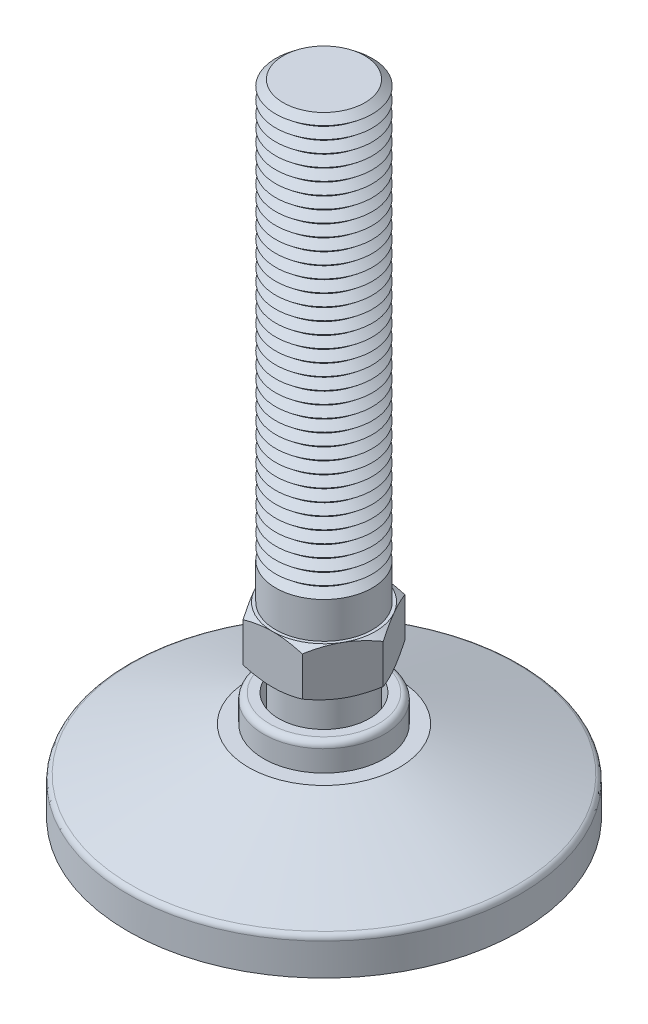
ISO-10303-21;
HEADER;
FILE_DESCRIPTION(('STEP AP214'),'2;1');
FILE_NAME('part.step','',(''),(''),'','','');
FILE_SCHEMA(('AUTOMOTIVE_DESIGN { 1 0 10303 214 1 1 1 1 }'));
ENDSEC;
DATA;
#1=APPLICATION_CONTEXT('core data for automotive mechanical design processes');
#2=APPLICATION_PROTOCOL_DEFINITION('international standard','automotive_design',2000,#1);
#3=PRODUCT_CONTEXT('',#1,'mechanical');
#4=PRODUCT('Part','Part','',(#3));
#5=PRODUCT_RELATED_PRODUCT_CATEGORY('part','',(#4));
#6=PRODUCT_DEFINITION_FORMATION('','',#4);
#7=PRODUCT_DEFINITION_CONTEXT('part definition',#1,'design');
#8=PRODUCT_DEFINITION('design','',#6,#7);
#9=PRODUCT_DEFINITION_SHAPE('','',#8);
#10=(LENGTH_UNIT() NAMED_UNIT(*) SI_UNIT(.MILLI.,.METRE.));
#11=(NAMED_UNIT(*) PLANE_ANGLE_UNIT() SI_UNIT($,.RADIAN.));
#12=(NAMED_UNIT(*) SI_UNIT($,.STERADIAN.) SOLID_ANGLE_UNIT());
#13=UNCERTAINTY_MEASURE_WITH_UNIT(LENGTH_MEASURE(1.E-05),#10,'distance_accuracy_value','');
#14=(GEOMETRIC_REPRESENTATION_CONTEXT(3) GLOBAL_UNCERTAINTY_ASSIGNED_CONTEXT((#13)) GLOBAL_UNIT_ASSIGNED_CONTEXT((#10,
#11,#12)) REPRESENTATION_CONTEXT('',''));
#15=CARTESIAN_POINT('',(0.,0.,0.));
#16=DIRECTION('',(0.,0.,1.));
#17=DIRECTION('',(1.,0.,0.));
#18=AXIS2_PLACEMENT_3D('',#15,#16,#17);
#19=CARTESIAN_POINT('',(0.,3.,0.));
#20=DIRECTION('',(0.,-1.,0.));
#21=DIRECTION('',(0.,0.,-1.));
#22=AXIS2_PLACEMENT_3D('',#19,#20,#21);
#23=CYLINDRICAL_SURFACE('',#22,29.5);
#24=CARTESIAN_POINT('',(0.,3.,0.));
#25=DIRECTION('',(0.,1.,0.));
#26=DIRECTION('',(0.,0.,1.));
#27=AXIS2_PLACEMENT_3D('',#24,#25,#26);
#28=CIRCLE('',#27,29.5);
#29=CARTESIAN_POINT('',(0.,3.,29.5));
#30=VERTEX_POINT('',#29);
#31=EDGE_CURVE('P0_E10',#30,#30,#28,.T.);
#32=ORIENTED_EDGE('',*,*,#31,.F.);
#33=EDGE_LOOP('',(#32));
#34=FACE_BOUND('',#33,.T.);
#35=CARTESIAN_POINT('',(0.,0.,0.));
#36=DIRECTION('',(0.,1.,0.));
#37=DIRECTION('',(0.,0.,1.));
#38=AXIS2_PLACEMENT_3D('',#35,#36,#37);
#39=CIRCLE('',#38,29.5);
#40=CARTESIAN_POINT('',(0.,0.,29.5));
#41=VERTEX_POINT('',#40);
#42=EDGE_CURVE('P0_E17',#41,#41,#39,.T.);
#43=ORIENTED_EDGE('',*,*,#42,.T.);
#44=EDGE_LOOP('',(#43));
#45=FACE_BOUND('',#44,.T.);
#46=ADVANCED_FACE('P0_F14',(#34,#45),#23,.T.);
#47=CARTESIAN_POINT('',(0.,3.,0.));
#48=DIRECTION('',(0.,1.,0.));
#49=DIRECTION('',(0.,0.,1.));
#50=AXIS2_PLACEMENT_3D('',#47,#48,#49);
#51=PLANE('',#50);
#52=CARTESIAN_POINT('',(0.,3.,0.));
#53=DIRECTION('',(0.,1.,0.));
#54=DIRECTION('',(0.,0.,1.));
#55=AXIS2_PLACEMENT_3D('',#52,#53,#54);
#56=CIRCLE('',#55,9.83333333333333);
#57=CARTESIAN_POINT('',(0.,3.,9.83333333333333));
#58=VERTEX_POINT('',#57);
#59=EDGE_CURVE('P0_E26',#58,#58,#56,.T.);
#60=ORIENTED_EDGE('',*,*,#59,.F.);
#61=EDGE_LOOP('',(#60));
#62=FACE_BOUND('',#61,.T.);
#63=ORIENTED_EDGE('',*,*,#31,.T.);
#64=EDGE_LOOP('',(#63));
#65=FACE_BOUND('',#64,.T.);
#66=ADVANCED_FACE('P0_F41',(#62,#65),#51,.T.);
#67=CARTESIAN_POINT('',(0.,0.,0.));
#68=DIRECTION('',(0.,1.,0.));
#69=DIRECTION('',(0.,0.,1.));
#70=AXIS2_PLACEMENT_3D('',#67,#68,#69);
#71=PLANE('',#70);
#72=ORIENTED_EDGE('',*,*,#42,.F.);
#73=EDGE_LOOP('',(#72));
#74=FACE_BOUND('',#73,.T.);
#75=ADVANCED_FACE('P0_F37',(#74),#71,.F.);
#76=CARTESIAN_POINT('',(0.,2.,0.));
#77=DIRECTION('',(0.,1.,0.));
#78=DIRECTION('',(0.,0.,1.));
#79=AXIS2_PLACEMENT_3D('',#76,#77,#78);
#80=CYLINDRICAL_SURFACE('',#79,9.83333333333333);
#81=CARTESIAN_POINT('',(0.,2.,0.));
#82=DIRECTION('',(0.,1.,0.));
#83=DIRECTION('',(0.,0.,1.));
#84=AXIS2_PLACEMENT_3D('',#81,#82,#83);
#85=CIRCLE('',#84,9.83333333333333);
#86=CARTESIAN_POINT('',(0.,2.,9.83333333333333));
#87=VERTEX_POINT('',#86);
#88=EDGE_CURVE('P0_E24',#87,#87,#85,.T.);
#89=ORIENTED_EDGE('',*,*,#88,.F.);
#90=EDGE_LOOP('',(#89));
#91=FACE_BOUND('',#90,.T.);
#92=ORIENTED_EDGE('',*,*,#59,.T.);
#93=EDGE_LOOP('',(#92));
#94=FACE_BOUND('',#93,.T.);
#95=ADVANCED_FACE('P0_F34',(#91,#94),#80,.F.);
#96=CARTESIAN_POINT('',(0.,2.,0.));
#97=DIRECTION('',(0.,1.,0.));
#98=DIRECTION('',(0.,0.,1.));
#99=AXIS2_PLACEMENT_3D('',#96,#97,#98);
#100=PLANE('',#99);
#101=ORIENTED_EDGE('',*,*,#88,.T.);
#102=EDGE_LOOP('',(#101));
#103=FACE_BOUND('',#102,.T.);
#104=ADVANCED_FACE('P0_F32',(#103),#100,.T.);
#105=CLOSED_SHELL('',(#46,#66,#75,#95,#104));
#106=MANIFOLD_SOLID_BREP('P0_B1',#105);
#107=CARTESIAN_POINT('',(0.,100.,0.));
#108=DIRECTION('',(0.,-1.,0.));
#109=DIRECTION('',(0.,0.,-1.));
#110=AXIS2_PLACEMENT_3D('',#107,#108,#109);
#111=CONICAL_SURFACE('',#110,6.75100040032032,0.895664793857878);
#112=CARTESIAN_POINT('',(0.,99.,0.));
#113=DIRECTION('',(0.,-1.,0.));
#114=DIRECTION('',(0.,0.,-1.));
#115=AXIS2_PLACEMENT_3D('',#112,#113,#114);
#116=CIRCLE('',#115,8.);
#117=CARTESIAN_POINT('',(0.,99.,-8.));
#118=VERTEX_POINT('',#117);
#119=EDGE_CURVE('P1_E1378',#118,#118,#116,.T.);
#120=ORIENTED_EDGE('',*,*,#119,.F.);
#121=EDGE_LOOP('',(#120));
#122=FACE_BOUND('',#121,.T.);
#123=CARTESIAN_POINT('',(0.,100.,0.));
#124=DIRECTION('',(0.,-1.,0.));
#125=DIRECTION('',(0.,0.,-1.));
#126=AXIS2_PLACEMENT_3D('',#123,#124,#125);
#127=CIRCLE('',#126,6.75100040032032);
#128=CARTESIAN_POINT('',(0.,100.,-6.75100040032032));
#129=VERTEX_POINT('',#128);
#130=EDGE_CURVE('P1_E1387',#129,#129,#127,.T.);
#131=ORIENTED_EDGE('',*,*,#130,.T.);
#132=EDGE_LOOP('',(#131));
#133=FACE_BOUND('',#132,.T.);
#134=ADVANCED_FACE('P1_F16',(#122,#133),#111,.T.);
#135=CARTESIAN_POINT('',(0.,101.,0.));
#136=DIRECTION('',(0.,1.,0.));
#137=DIRECTION('',(0.,0.,1.));
#138=AXIS2_PLACEMENT_3D('',#135,#136,#137);
#139=CONICAL_SURFACE('',#138,8.,0.895664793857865);
#140=ORIENTED_EDGE('',*,*,#130,.F.);
#141=EDGE_LOOP('',(#140));
#142=FACE_BOUND('',#141,.T.);
#143=CARTESIAN_POINT('',(0.,101.,0.));
#144=DIRECTION('',(0.,-1.,0.));
#145=DIRECTION('',(0.,0.,-1.));
#146=AXIS2_PLACEMENT_3D('',#143,#144,#145);
#147=CIRCLE('',#146,8.);
#148=CARTESIAN_POINT('',(0.,101.,-8.));
#149=VERTEX_POINT('',#148);
#150=EDGE_CURVE('P1_E1384',#149,#149,#147,.T.);
#151=ORIENTED_EDGE('',*,*,#150,.T.);
#152=EDGE_LOOP('',(#151));
#153=FACE_BOUND('',#152,.T.);
#154=ADVANCED_FACE('P1_F308',(#142,#153),#139,.T.);
#155=CARTESIAN_POINT('',(0.,108.,0.));
#156=DIRECTION('',(0.,1.,0.));
#157=DIRECTION('',(0.,0.,1.));
#158=AXIS2_PLACEMENT_3D('',#155,#156,#157);
#159=PLANE('',#158);
#160=CARTESIAN_POINT('',(0.,108.,0.));
#161=DIRECTION('',(0.,-1.,0.));
#162=DIRECTION('',(0.,0.,-1.));
#163=AXIS2_PLACEMENT_3D('',#160,#161,#162);
#164=CIRCLE('',#163,6.75100040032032);
#165=CARTESIAN_POINT('',(0.,108.,-6.75100040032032));
#166=VERTEX_POINT('',#165);
#167=EDGE_CURVE('P1_E143',#166,#166,#164,.T.);
#168=ORIENTED_EDGE('',*,*,#167,.F.);
#169=EDGE_LOOP('',(#168));
#170=FACE_BOUND('',#169,.T.);
#171=ADVANCED_FACE('P1_F314',(#170),#159,.T.);
#172=CARTESIAN_POINT('',(0.,108.,0.));
#173=DIRECTION('',(0.,-1.,0.));
#174=DIRECTION('',(0.,0.,-1.));
#175=AXIS2_PLACEMENT_3D('',#172,#173,#174);
#176=CONICAL_SURFACE('',#175,6.75100040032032,0.895664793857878);
#177=CARTESIAN_POINT('',(0.,107.,0.));
#178=DIRECTION('',(0.,-1.,0.));
#179=DIRECTION('',(0.,0.,-1.));
#180=AXIS2_PLACEMENT_3D('',#177,#178,#179);
#181=CIRCLE('',#180,8.);
#182=CARTESIAN_POINT('',(0.,107.,-8.));
#183=VERTEX_POINT('',#182);
#184=EDGE_CURVE('P1_E353',#183,#183,#181,.T.);
#185=ORIENTED_EDGE('',*,*,#184,.F.);
#186=EDGE_LOOP('',(#185));
#187=FACE_BOUND('',#186,.T.);
#188=ORIENTED_EDGE('',*,*,#167,.T.);
#189=EDGE_LOOP('',(#188));
#190=FACE_BOUND('',#189,.T.);
#191=ADVANCED_FACE('P1_F211',(#187,#190),#176,.T.);
#192=CARTESIAN_POINT('',(0.,107.,0.));
#193=DIRECTION('',(0.,1.,0.));
#194=DIRECTION('',(0.,0.,1.));
#195=AXIS2_PLACEMENT_3D('',#192,#193,#194);
#196=CONICAL_SURFACE('',#195,8.,0.895664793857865);
#197=CARTESIAN_POINT('',(0.,106.,0.));
#198=DIRECTION('',(0.,-1.,0.));
#199=DIRECTION('',(0.,0.,-1.));
#200=AXIS2_PLACEMENT_3D('',#197,#198,#199);
#201=CIRCLE('',#200,6.75100040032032);
#202=CARTESIAN_POINT('',(0.,106.,-6.75100040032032));
#203=VERTEX_POINT('',#202);
#204=EDGE_CURVE('P1_E352',#203,#203,#201,.T.);
#205=ORIENTED_EDGE('',*,*,#204,.F.);
#206=EDGE_LOOP('',(#205));
#207=FACE_BOUND('',#206,.T.);
#208=ORIENTED_EDGE('',*,*,#184,.T.);
#209=EDGE_LOOP('',(#208));
#210=FACE_BOUND('',#209,.T.);
#211=ADVANCED_FACE('P1_F339',(#207,#210),#196,.T.);
#212=CARTESIAN_POINT('',(0.,106.,0.));
#213=DIRECTION('',(0.,-1.,0.));
#214=DIRECTION('',(0.,0.,-1.));
#215=AXIS2_PLACEMENT_3D('',#212,#213,#214);
#216=CONICAL_SURFACE('',#215,6.75100040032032,0.895664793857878);
#217=CARTESIAN_POINT('',(0.,105.,0.));
#218=DIRECTION('',(0.,-1.,0.));
#219=DIRECTION('',(0.,0.,-1.));
#220=AXIS2_PLACEMENT_3D('',#217,#218,#219);
#221=CIRCLE('',#220,8.);
#222=CARTESIAN_POINT('',(0.,105.,-8.));
#223=VERTEX_POINT('',#222);
#224=EDGE_CURVE('P1_E349',#223,#223,#221,.T.);
#225=ORIENTED_EDGE('',*,*,#224,.F.);
#226=EDGE_LOOP('',(#225));
#227=FACE_BOUND('',#226,.T.);
#228=ORIENTED_EDGE('',*,*,#204,.T.);
#229=EDGE_LOOP('',(#228));
#230=FACE_BOUND('',#229,.T.);
#231=ADVANCED_FACE('P1_F334',(#227,#230),#216,.T.);
#232=CARTESIAN_POINT('',(0.,105.,0.));
#233=DIRECTION('',(0.,1.,0.));
#234=DIRECTION('',(0.,0.,1.));
#235=AXIS2_PLACEMENT_3D('',#232,#233,#234);
#236=CONICAL_SURFACE('',#235,8.,0.895664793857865);
#237=CARTESIAN_POINT('',(0.,104.,0.));
#238=DIRECTION('',(0.,-1.,0.));
#239=DIRECTION('',(0.,0.,-1.));
#240=AXIS2_PLACEMENT_3D('',#237,#238,#239);
#241=CIRCLE('',#240,6.75100040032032);
#242=CARTESIAN_POINT('',(0.,104.,-6.75100040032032));
#243=VERTEX_POINT('',#242);
#244=EDGE_CURVE('P1_E358',#243,#243,#241,.T.);
#245=ORIENTED_EDGE('',*,*,#244,.F.);
#246=EDGE_LOOP('',(#245));
#247=FACE_BOUND('',#246,.T.);
#248=ORIENTED_EDGE('',*,*,#224,.T.);
#249=EDGE_LOOP('',(#248));
#250=FACE_BOUND('',#249,.T.);
#251=ADVANCED_FACE('P1_F331',(#247,#250),#236,.T.);
#252=CARTESIAN_POINT('',(0.,104.,0.));
#253=DIRECTION('',(0.,-1.,0.));
#254=DIRECTION('',(0.,0.,-1.));
#255=AXIS2_PLACEMENT_3D('',#252,#253,#254);
#256=CONICAL_SURFACE('',#255,6.75100040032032,0.895664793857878);
#257=CARTESIAN_POINT('',(0.,103.,0.));
#258=DIRECTION('',(0.,-1.,0.));
#259=DIRECTION('',(0.,0.,-1.));
#260=AXIS2_PLACEMENT_3D('',#257,#258,#259);
#261=CIRCLE('',#260,8.);
#262=CARTESIAN_POINT('',(0.,103.,-8.));
#263=VERTEX_POINT('',#262);
#264=EDGE_CURVE('P1_E1390',#263,#263,#261,.T.);
#265=ORIENTED_EDGE('',*,*,#264,.F.);
#266=EDGE_LOOP('',(#265));
#267=FACE_BOUND('',#266,.T.);
#268=ORIENTED_EDGE('',*,*,#244,.T.);
#269=EDGE_LOOP('',(#268));
#270=FACE_BOUND('',#269,.T.);
#271=ADVANCED_FACE('P1_F325',(#267,#270),#256,.T.);
#272=CARTESIAN_POINT('',(0.,103.,0.));
#273=DIRECTION('',(0.,1.,0.));
#274=DIRECTION('',(0.,0.,1.));
#275=AXIS2_PLACEMENT_3D('',#272,#273,#274);
#276=CONICAL_SURFACE('',#275,8.,0.895664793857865);
#277=CARTESIAN_POINT('',(0.,102.,0.));
#278=DIRECTION('',(0.,-1.,0.));
#279=DIRECTION('',(0.,0.,-1.));
#280=AXIS2_PLACEMENT_3D('',#277,#278,#279);
#281=CIRCLE('',#280,6.75100040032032);
#282=CARTESIAN_POINT('',(0.,102.,-6.75100040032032));
#283=VERTEX_POINT('',#282);
#284=EDGE_CURVE('P1_E1393',#283,#283,#281,.T.);
#285=ORIENTED_EDGE('',*,*,#284,.F.);
#286=EDGE_LOOP('',(#285));
#287=FACE_BOUND('',#286,.T.);
#288=ORIENTED_EDGE('',*,*,#264,.T.);
#289=EDGE_LOOP('',(#288));
#290=FACE_BOUND('',#289,.T.);
#291=ADVANCED_FACE('P1_F321',(#287,#290),#276,.T.);
#292=CARTESIAN_POINT('',(0.,102.,0.));
#293=DIRECTION('',(0.,-1.,0.));
#294=DIRECTION('',(0.,0.,-1.));
#295=AXIS2_PLACEMENT_3D('',#292,#293,#294);
#296=CONICAL_SURFACE('',#295,6.75100040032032,0.895664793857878);
#297=ORIENTED_EDGE('',*,*,#150,.F.);
#298=EDGE_LOOP('',(#297));
#299=FACE_BOUND('',#298,.T.);
#300=ORIENTED_EDGE('',*,*,#284,.T.);
#301=EDGE_LOOP('',(#300));
#302=FACE_BOUND('',#301,.T.);
#303=ADVANCED_FACE('P1_F324',(#299,#302),#296,.T.);
#304=CARTESIAN_POINT('',(0.,98.,0.));
#305=DIRECTION('',(0.,-1.,0.));
#306=DIRECTION('',(0.,0.,-1.));
#307=AXIS2_PLACEMENT_3D('',#304,#305,#306);
#308=CONICAL_SURFACE('',#307,6.75100040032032,0.895664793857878);
#309=CARTESIAN_POINT('',(0.,97.,0.));
#310=DIRECTION('',(0.,-1.,0.));
#311=DIRECTION('',(0.,0.,-1.));
#312=AXIS2_PLACEMENT_3D('',#309,#310,#311);
#313=CIRCLE('',#312,8.);
#314=CARTESIAN_POINT('',(0.,97.,-8.));
#315=VERTEX_POINT('',#314);
#316=EDGE_CURVE('P1_E1372',#315,#315,#313,.T.);
#317=ORIENTED_EDGE('',*,*,#316,.F.);
#318=EDGE_LOOP('',(#317));
#319=FACE_BOUND('',#318,.T.);
#320=CARTESIAN_POINT('',(0.,98.,0.));
#321=DIRECTION('',(0.,-1.,0.));
#322=DIRECTION('',(0.,0.,-1.));
#323=AXIS2_PLACEMENT_3D('',#320,#321,#322);
#324=CIRCLE('',#323,6.75100040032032);
#325=CARTESIAN_POINT('',(0.,98.,-6.75100040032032));
#326=VERTEX_POINT('',#325);
#327=EDGE_CURVE('P1_E1381',#326,#326,#324,.T.);
#328=ORIENTED_EDGE('',*,*,#327,.T.);
#329=EDGE_LOOP('',(#328));
#330=FACE_BOUND('',#329,.T.);
#331=ADVANCED_FACE('P1_F329',(#319,#330),#308,.T.);
#332=CARTESIAN_POINT('',(0.,99.,0.));
#333=DIRECTION('',(0.,1.,0.));
#334=DIRECTION('',(0.,0.,1.));
#335=AXIS2_PLACEMENT_3D('',#332,#333,#334);
#336=CONICAL_SURFACE('',#335,8.,0.895664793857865);
#337=ORIENTED_EDGE('',*,*,#327,.F.);
#338=EDGE_LOOP('',(#337));
#339=FACE_BOUND('',#338,.T.);
#340=ORIENTED_EDGE('',*,*,#119,.T.);
#341=EDGE_LOOP('',(#340));
#342=FACE_BOUND('',#341,.T.);
#343=ADVANCED_FACE('P1_F1104',(#339,#342),#336,.T.);
#344=CARTESIAN_POINT('',(0.,96.,0.));
#345=DIRECTION('',(0.,-1.,0.));
#346=DIRECTION('',(0.,0.,-1.));
#347=AXIS2_PLACEMENT_3D('',#344,#345,#346);
#348=CONICAL_SURFACE('',#347,6.75100040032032,0.895664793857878);
#349=CARTESIAN_POINT('',(0.,95.,0.));
#350=DIRECTION('',(0.,-1.,0.));
#351=DIRECTION('',(0.,0.,-1.));
#352=AXIS2_PLACEMENT_3D('',#349,#350,#351);
#353=CIRCLE('',#352,8.);
#354=CARTESIAN_POINT('',(0.,95.,-8.));
#355=VERTEX_POINT('',#354);
#356=EDGE_CURVE('P1_E1366',#355,#355,#353,.T.);
#357=ORIENTED_EDGE('',*,*,#356,.F.);
#358=EDGE_LOOP('',(#357));
#359=FACE_BOUND('',#358,.T.);
#360=CARTESIAN_POINT('',(0.,96.,0.));
#361=DIRECTION('',(0.,-1.,0.));
#362=DIRECTION('',(0.,0.,-1.));
#363=AXIS2_PLACEMENT_3D('',#360,#361,#362);
#364=CIRCLE('',#363,6.75100040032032);
#365=CARTESIAN_POINT('',(0.,96.,-6.75100040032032));
#366=VERTEX_POINT('',#365);
#367=EDGE_CURVE('P1_E1375',#366,#366,#364,.T.);
#368=ORIENTED_EDGE('',*,*,#367,.T.);
#369=EDGE_LOOP('',(#368));
#370=FACE_BOUND('',#369,.T.);
#371=ADVANCED_FACE('P1_F1094',(#359,#370),#348,.T.);
#372=CARTESIAN_POINT('',(0.,97.,0.));
#373=DIRECTION('',(0.,1.,0.));
#374=DIRECTION('',(0.,0.,1.));
#375=AXIS2_PLACEMENT_3D('',#372,#373,#374);
#376=CONICAL_SURFACE('',#375,8.,0.895664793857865);
#377=ORIENTED_EDGE('',*,*,#367,.F.);
#378=EDGE_LOOP('',(#377));
#379=FACE_BOUND('',#378,.T.);
#380=ORIENTED_EDGE('',*,*,#316,.T.);
#381=EDGE_LOOP('',(#380));
#382=FACE_BOUND('',#381,.T.);
#383=ADVANCED_FACE('P1_F1084',(#379,#382),#376,.T.);
#384=CARTESIAN_POINT('',(0.,94.,0.));
#385=DIRECTION('',(0.,-1.,0.));
#386=DIRECTION('',(0.,0.,-1.));
#387=AXIS2_PLACEMENT_3D('',#384,#385,#386);
#388=CONICAL_SURFACE('',#387,6.75100040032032,0.895664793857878);
#389=CARTESIAN_POINT('',(0.,93.,0.));
#390=DIRECTION('',(0.,-1.,0.));
#391=DIRECTION('',(0.,0.,-1.));
#392=AXIS2_PLACEMENT_3D('',#389,#390,#391);
#393=CIRCLE('',#392,8.);
#394=CARTESIAN_POINT('',(0.,93.,-8.));
#395=VERTEX_POINT('',#394);
#396=EDGE_CURVE('P1_E1360',#395,#395,#393,.T.);
#397=ORIENTED_EDGE('',*,*,#396,.F.);
#398=EDGE_LOOP('',(#397));
#399=FACE_BOUND('',#398,.T.);
#400=CARTESIAN_POINT('',(0.,94.,0.));
#401=DIRECTION('',(0.,-1.,0.));
#402=DIRECTION('',(0.,0.,-1.));
#403=AXIS2_PLACEMENT_3D('',#400,#401,#402);
#404=CIRCLE('',#403,6.75100040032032);
#405=CARTESIAN_POINT('',(0.,94.,-6.75100040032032));
#406=VERTEX_POINT('',#405);
#407=EDGE_CURVE('P1_E1369',#406,#406,#404,.T.);
#408=ORIENTED_EDGE('',*,*,#407,.T.);
#409=EDGE_LOOP('',(#408));
#410=FACE_BOUND('',#409,.T.);
#411=ADVANCED_FACE('P1_F1074',(#399,#410),#388,.T.);
#412=CARTESIAN_POINT('',(0.,95.,0.));
#413=DIRECTION('',(0.,1.,0.));
#414=DIRECTION('',(0.,0.,1.));
#415=AXIS2_PLACEMENT_3D('',#412,#413,#414);
#416=CONICAL_SURFACE('',#415,8.,0.895664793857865);
#417=ORIENTED_EDGE('',*,*,#407,.F.);
#418=EDGE_LOOP('',(#417));
#419=FACE_BOUND('',#418,.T.);
#420=ORIENTED_EDGE('',*,*,#356,.T.);
#421=EDGE_LOOP('',(#420));
#422=FACE_BOUND('',#421,.T.);
#423=ADVANCED_FACE('P1_F1064',(#419,#422),#416,.T.);
#424=CARTESIAN_POINT('',(0.,92.,0.));
#425=DIRECTION('',(0.,-1.,0.));
#426=DIRECTION('',(0.,0.,-1.));
#427=AXIS2_PLACEMENT_3D('',#424,#425,#426);
#428=CONICAL_SURFACE('',#427,6.75100040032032,0.895664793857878);
#429=CARTESIAN_POINT('',(0.,91.,0.));
#430=DIRECTION('',(0.,-1.,0.));
#431=DIRECTION('',(0.,0.,-1.));
#432=AXIS2_PLACEMENT_3D('',#429,#430,#431);
#433=CIRCLE('',#432,8.);
#434=CARTESIAN_POINT('',(0.,91.,-8.));
#435=VERTEX_POINT('',#434);
#436=EDGE_CURVE('P1_E1354',#435,#435,#433,.T.);
#437=ORIENTED_EDGE('',*,*,#436,.F.);
#438=EDGE_LOOP('',(#437));
#439=FACE_BOUND('',#438,.T.);
#440=CARTESIAN_POINT('',(0.,92.,0.));
#441=DIRECTION('',(0.,-1.,0.));
#442=DIRECTION('',(0.,0.,-1.));
#443=AXIS2_PLACEMENT_3D('',#440,#441,#442);
#444=CIRCLE('',#443,6.75100040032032);
#445=CARTESIAN_POINT('',(0.,92.,-6.75100040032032));
#446=VERTEX_POINT('',#445);
#447=EDGE_CURVE('P1_E1363',#446,#446,#444,.T.);
#448=ORIENTED_EDGE('',*,*,#447,.T.);
#449=EDGE_LOOP('',(#448));
#450=FACE_BOUND('',#449,.T.);
#451=ADVANCED_FACE('P1_F1054',(#439,#450),#428,.T.);
#452=CARTESIAN_POINT('',(0.,93.,0.));
#453=DIRECTION('',(0.,1.,0.));
#454=DIRECTION('',(0.,0.,1.));
#455=AXIS2_PLACEMENT_3D('',#452,#453,#454);
#456=CONICAL_SURFACE('',#455,8.,0.895664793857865);
#457=ORIENTED_EDGE('',*,*,#447,.F.);
#458=EDGE_LOOP('',(#457));
#459=FACE_BOUND('',#458,.T.);
#460=ORIENTED_EDGE('',*,*,#396,.T.);
#461=EDGE_LOOP('',(#460));
#462=FACE_BOUND('',#461,.T.);
#463=ADVANCED_FACE('P1_F1044',(#459,#462),#456,.T.);
#464=CARTESIAN_POINT('',(0.,90.,0.));
#465=DIRECTION('',(0.,-1.,0.));
#466=DIRECTION('',(0.,0.,-1.));
#467=AXIS2_PLACEMENT_3D('',#464,#465,#466);
#468=CONICAL_SURFACE('',#467,6.75100040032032,0.895664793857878);
#469=CARTESIAN_POINT('',(0.,89.,0.));
#470=DIRECTION('',(0.,-1.,0.));
#471=DIRECTION('',(0.,0.,-1.));
#472=AXIS2_PLACEMENT_3D('',#469,#470,#471);
#473=CIRCLE('',#472,8.);
#474=CARTESIAN_POINT('',(0.,89.,-8.));
#475=VERTEX_POINT('',#474);
#476=EDGE_CURVE('P1_E1348',#475,#475,#473,.T.);
#477=ORIENTED_EDGE('',*,*,#476,.F.);
#478=EDGE_LOOP('',(#477));
#479=FACE_BOUND('',#478,.T.);
#480=CARTESIAN_POINT('',(0.,90.,0.));
#481=DIRECTION('',(0.,-1.,0.));
#482=DIRECTION('',(0.,0.,-1.));
#483=AXIS2_PLACEMENT_3D('',#480,#481,#482);
#484=CIRCLE('',#483,6.75100040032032);
#485=CARTESIAN_POINT('',(0.,90.,-6.75100040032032));
#486=VERTEX_POINT('',#485);
#487=EDGE_CURVE('P1_E1357',#486,#486,#484,.T.);
#488=ORIENTED_EDGE('',*,*,#487,.T.);
#489=EDGE_LOOP('',(#488));
#490=FACE_BOUND('',#489,.T.);
#491=ADVANCED_FACE('P1_F1034',(#479,#490),#468,.T.);
#492=CARTESIAN_POINT('',(0.,91.,0.));
#493=DIRECTION('',(0.,1.,0.));
#494=DIRECTION('',(0.,0.,1.));
#495=AXIS2_PLACEMENT_3D('',#492,#493,#494);
#496=CONICAL_SURFACE('',#495,8.,0.895664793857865);
#497=ORIENTED_EDGE('',*,*,#487,.F.);
#498=EDGE_LOOP('',(#497));
#499=FACE_BOUND('',#498,.T.);
#500=ORIENTED_EDGE('',*,*,#436,.T.);
#501=EDGE_LOOP('',(#500));
#502=FACE_BOUND('',#501,.T.);
#503=ADVANCED_FACE('P1_F1024',(#499,#502),#496,.T.);
#504=CARTESIAN_POINT('',(0.,88.,0.));
#505=DIRECTION('',(0.,-1.,0.));
#506=DIRECTION('',(0.,0.,-1.));
#507=AXIS2_PLACEMENT_3D('',#504,#505,#506);
#508=CONICAL_SURFACE('',#507,6.75100040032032,0.895664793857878);
#509=CARTESIAN_POINT('',(0.,87.,0.));
#510=DIRECTION('',(0.,-1.,0.));
#511=DIRECTION('',(0.,0.,-1.));
#512=AXIS2_PLACEMENT_3D('',#509,#510,#511);
#513=CIRCLE('',#512,8.);
#514=CARTESIAN_POINT('',(0.,87.,-8.));
#515=VERTEX_POINT('',#514);
#516=EDGE_CURVE('P1_E1342',#515,#515,#513,.T.);
#517=ORIENTED_EDGE('',*,*,#516,.F.);
#518=EDGE_LOOP('',(#517));
#519=FACE_BOUND('',#518,.T.);
#520=CARTESIAN_POINT('',(0.,88.,0.));
#521=DIRECTION('',(0.,-1.,0.));
#522=DIRECTION('',(0.,0.,-1.));
#523=AXIS2_PLACEMENT_3D('',#520,#521,#522);
#524=CIRCLE('',#523,6.75100040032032);
#525=CARTESIAN_POINT('',(0.,88.,-6.75100040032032));
#526=VERTEX_POINT('',#525);
#527=EDGE_CURVE('P1_E1351',#526,#526,#524,.T.);
#528=ORIENTED_EDGE('',*,*,#527,.T.);
#529=EDGE_LOOP('',(#528));
#530=FACE_BOUND('',#529,.T.);
#531=ADVANCED_FACE('P1_F1014',(#519,#530),#508,.T.);
#532=CARTESIAN_POINT('',(0.,89.,0.));
#533=DIRECTION('',(0.,1.,0.));
#534=DIRECTION('',(0.,0.,1.));
#535=AXIS2_PLACEMENT_3D('',#532,#533,#534);
#536=CONICAL_SURFACE('',#535,8.,0.895664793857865);
#537=ORIENTED_EDGE('',*,*,#527,.F.);
#538=EDGE_LOOP('',(#537));
#539=FACE_BOUND('',#538,.T.);
#540=ORIENTED_EDGE('',*,*,#476,.T.);
#541=EDGE_LOOP('',(#540));
#542=FACE_BOUND('',#541,.T.);
#543=ADVANCED_FACE('P1_F1004',(#539,#542),#536,.T.);
#544=CARTESIAN_POINT('',(0.,86.,0.));
#545=DIRECTION('',(0.,-1.,0.));
#546=DIRECTION('',(0.,0.,-1.));
#547=AXIS2_PLACEMENT_3D('',#544,#545,#546);
#548=CONICAL_SURFACE('',#547,6.75100040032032,0.895664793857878);
#549=CARTESIAN_POINT('',(0.,85.,0.));
#550=DIRECTION('',(0.,-1.,0.));
#551=DIRECTION('',(0.,0.,-1.));
#552=AXIS2_PLACEMENT_3D('',#549,#550,#551);
#553=CIRCLE('',#552,8.);
#554=CARTESIAN_POINT('',(0.,85.,-8.));
#555=VERTEX_POINT('',#554);
#556=EDGE_CURVE('P1_E1336',#555,#555,#553,.T.);
#557=ORIENTED_EDGE('',*,*,#556,.F.);
#558=EDGE_LOOP('',(#557));
#559=FACE_BOUND('',#558,.T.);
#560=CARTESIAN_POINT('',(0.,86.,0.));
#561=DIRECTION('',(0.,-1.,0.));
#562=DIRECTION('',(0.,0.,-1.));
#563=AXIS2_PLACEMENT_3D('',#560,#561,#562);
#564=CIRCLE('',#563,6.75100040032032);
#565=CARTESIAN_POINT('',(0.,86.,-6.75100040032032));
#566=VERTEX_POINT('',#565);
#567=EDGE_CURVE('P1_E1345',#566,#566,#564,.T.);
#568=ORIENTED_EDGE('',*,*,#567,.T.);
#569=EDGE_LOOP('',(#568));
#570=FACE_BOUND('',#569,.T.);
#571=ADVANCED_FACE('P1_F994',(#559,#570),#548,.T.);
#572=CARTESIAN_POINT('',(0.,87.,0.));
#573=DIRECTION('',(0.,1.,0.));
#574=DIRECTION('',(0.,0.,1.));
#575=AXIS2_PLACEMENT_3D('',#572,#573,#574);
#576=CONICAL_SURFACE('',#575,8.,0.895664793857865);
#577=ORIENTED_EDGE('',*,*,#567,.F.);
#578=EDGE_LOOP('',(#577));
#579=FACE_BOUND('',#578,.T.);
#580=ORIENTED_EDGE('',*,*,#516,.T.);
#581=EDGE_LOOP('',(#580));
#582=FACE_BOUND('',#581,.T.);
#583=ADVANCED_FACE('P1_F984',(#579,#582),#576,.T.);
#584=CARTESIAN_POINT('',(0.,84.,0.));
#585=DIRECTION('',(0.,-1.,0.));
#586=DIRECTION('',(0.,0.,-1.));
#587=AXIS2_PLACEMENT_3D('',#584,#585,#586);
#588=CONICAL_SURFACE('',#587,6.75100040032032,0.895664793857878);
#589=CARTESIAN_POINT('',(0.,83.,0.));
#590=DIRECTION('',(0.,-1.,0.));
#591=DIRECTION('',(0.,0.,-1.));
#592=AXIS2_PLACEMENT_3D('',#589,#590,#591);
#593=CIRCLE('',#592,8.);
#594=CARTESIAN_POINT('',(0.,83.,-8.));
#595=VERTEX_POINT('',#594);
#596=EDGE_CURVE('P1_E1330',#595,#595,#593,.T.);
#597=ORIENTED_EDGE('',*,*,#596,.F.);
#598=EDGE_LOOP('',(#597));
#599=FACE_BOUND('',#598,.T.);
#600=CARTESIAN_POINT('',(0.,84.,0.));
#601=DIRECTION('',(0.,-1.,0.));
#602=DIRECTION('',(0.,0.,-1.));
#603=AXIS2_PLACEMENT_3D('',#600,#601,#602);
#604=CIRCLE('',#603,6.75100040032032);
#605=CARTESIAN_POINT('',(0.,84.,-6.75100040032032));
#606=VERTEX_POINT('',#605);
#607=EDGE_CURVE('P1_E1339',#606,#606,#604,.T.);
#608=ORIENTED_EDGE('',*,*,#607,.T.);
#609=EDGE_LOOP('',(#608));
#610=FACE_BOUND('',#609,.T.);
#611=ADVANCED_FACE('P1_F974',(#599,#610),#588,.T.);
#612=CARTESIAN_POINT('',(0.,85.,0.));
#613=DIRECTION('',(0.,1.,0.));
#614=DIRECTION('',(0.,0.,1.));
#615=AXIS2_PLACEMENT_3D('',#612,#613,#614);
#616=CONICAL_SURFACE('',#615,8.,0.895664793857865);
#617=ORIENTED_EDGE('',*,*,#607,.F.);
#618=EDGE_LOOP('',(#617));
#619=FACE_BOUND('',#618,.T.);
#620=ORIENTED_EDGE('',*,*,#556,.T.);
#621=EDGE_LOOP('',(#620));
#622=FACE_BOUND('',#621,.T.);
#623=ADVANCED_FACE('P1_F964',(#619,#622),#616,.T.);
#624=CARTESIAN_POINT('',(0.,82.,0.));
#625=DIRECTION('',(0.,-1.,0.));
#626=DIRECTION('',(0.,0.,-1.));
#627=AXIS2_PLACEMENT_3D('',#624,#625,#626);
#628=CONICAL_SURFACE('',#627,6.75100040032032,0.895664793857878);
#629=CARTESIAN_POINT('',(0.,81.,0.));
#630=DIRECTION('',(0.,-1.,0.));
#631=DIRECTION('',(0.,0.,-1.));
#632=AXIS2_PLACEMENT_3D('',#629,#630,#631);
#633=CIRCLE('',#632,8.);
#634=CARTESIAN_POINT('',(0.,81.,-8.));
#635=VERTEX_POINT('',#634);
#636=EDGE_CURVE('P1_E1324',#635,#635,#633,.T.);
#637=ORIENTED_EDGE('',*,*,#636,.F.);
#638=EDGE_LOOP('',(#637));
#639=FACE_BOUND('',#638,.T.);
#640=CARTESIAN_POINT('',(0.,82.,0.));
#641=DIRECTION('',(0.,-1.,0.));
#642=DIRECTION('',(0.,0.,-1.));
#643=AXIS2_PLACEMENT_3D('',#640,#641,#642);
#644=CIRCLE('',#643,6.75100040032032);
#645=CARTESIAN_POINT('',(0.,82.,-6.75100040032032));
#646=VERTEX_POINT('',#645);
#647=EDGE_CURVE('P1_E1333',#646,#646,#644,.T.);
#648=ORIENTED_EDGE('',*,*,#647,.T.);
#649=EDGE_LOOP('',(#648));
#650=FACE_BOUND('',#649,.T.);
#651=ADVANCED_FACE('P1_F954',(#639,#650),#628,.T.);
#652=CARTESIAN_POINT('',(0.,83.,0.));
#653=DIRECTION('',(0.,1.,0.));
#654=DIRECTION('',(0.,0.,1.));
#655=AXIS2_PLACEMENT_3D('',#652,#653,#654);
#656=CONICAL_SURFACE('',#655,8.,0.895664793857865);
#657=ORIENTED_EDGE('',*,*,#647,.F.);
#658=EDGE_LOOP('',(#657));
#659=FACE_BOUND('',#658,.T.);
#660=ORIENTED_EDGE('',*,*,#596,.T.);
#661=EDGE_LOOP('',(#660));
#662=FACE_BOUND('',#661,.T.);
#663=ADVANCED_FACE('P1_F944',(#659,#662),#656,.T.);
#664=CARTESIAN_POINT('',(0.,80.,0.));
#665=DIRECTION('',(0.,-1.,0.));
#666=DIRECTION('',(0.,0.,-1.));
#667=AXIS2_PLACEMENT_3D('',#664,#665,#666);
#668=CONICAL_SURFACE('',#667,6.75100040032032,0.895664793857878);
#669=CARTESIAN_POINT('',(0.,79.,0.));
#670=DIRECTION('',(0.,-1.,0.));
#671=DIRECTION('',(0.,0.,-1.));
#672=AXIS2_PLACEMENT_3D('',#669,#670,#671);
#673=CIRCLE('',#672,8.);
#674=CARTESIAN_POINT('',(0.,79.,-8.));
#675=VERTEX_POINT('',#674);
#676=EDGE_CURVE('P1_E1318',#675,#675,#673,.T.);
#677=ORIENTED_EDGE('',*,*,#676,.F.);
#678=EDGE_LOOP('',(#677));
#679=FACE_BOUND('',#678,.T.);
#680=CARTESIAN_POINT('',(0.,80.,0.));
#681=DIRECTION('',(0.,-1.,0.));
#682=DIRECTION('',(0.,0.,-1.));
#683=AXIS2_PLACEMENT_3D('',#680,#681,#682);
#684=CIRCLE('',#683,6.75100040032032);
#685=CARTESIAN_POINT('',(0.,80.,-6.75100040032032));
#686=VERTEX_POINT('',#685);
#687=EDGE_CURVE('P1_E1327',#686,#686,#684,.T.);
#688=ORIENTED_EDGE('',*,*,#687,.T.);
#689=EDGE_LOOP('',(#688));
#690=FACE_BOUND('',#689,.T.);
#691=ADVANCED_FACE('P1_F934',(#679,#690),#668,.T.);
#692=CARTESIAN_POINT('',(0.,81.,0.));
#693=DIRECTION('',(0.,1.,0.));
#694=DIRECTION('',(0.,0.,1.));
#695=AXIS2_PLACEMENT_3D('',#692,#693,#694);
#696=CONICAL_SURFACE('',#695,8.,0.895664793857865);
#697=ORIENTED_EDGE('',*,*,#687,.F.);
#698=EDGE_LOOP('',(#697));
#699=FACE_BOUND('',#698,.T.);
#700=ORIENTED_EDGE('',*,*,#636,.T.);
#701=EDGE_LOOP('',(#700));
#702=FACE_BOUND('',#701,.T.);
#703=ADVANCED_FACE('P1_F924',(#699,#702),#696,.T.);
#704=CARTESIAN_POINT('',(0.,78.,0.));
#705=DIRECTION('',(0.,-1.,0.));
#706=DIRECTION('',(0.,0.,-1.));
#707=AXIS2_PLACEMENT_3D('',#704,#705,#706);
#708=CONICAL_SURFACE('',#707,6.75100040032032,0.895664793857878);
#709=CARTESIAN_POINT('',(0.,77.,0.));
#710=DIRECTION('',(0.,-1.,0.));
#711=DIRECTION('',(0.,0.,-1.));
#712=AXIS2_PLACEMENT_3D('',#709,#710,#711);
#713=CIRCLE('',#712,8.);
#714=CARTESIAN_POINT('',(0.,77.,-8.));
#715=VERTEX_POINT('',#714);
#716=EDGE_CURVE('P1_E1312',#715,#715,#713,.T.);
#717=ORIENTED_EDGE('',*,*,#716,.F.);
#718=EDGE_LOOP('',(#717));
#719=FACE_BOUND('',#718,.T.);
#720=CARTESIAN_POINT('',(0.,78.,0.));
#721=DIRECTION('',(0.,-1.,0.));
#722=DIRECTION('',(0.,0.,-1.));
#723=AXIS2_PLACEMENT_3D('',#720,#721,#722);
#724=CIRCLE('',#723,6.75100040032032);
#725=CARTESIAN_POINT('',(0.,78.,-6.75100040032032));
#726=VERTEX_POINT('',#725);
#727=EDGE_CURVE('P1_E1321',#726,#726,#724,.T.);
#728=ORIENTED_EDGE('',*,*,#727,.T.);
#729=EDGE_LOOP('',(#728));
#730=FACE_BOUND('',#729,.T.);
#731=ADVANCED_FACE('P1_F914',(#719,#730),#708,.T.);
#732=CARTESIAN_POINT('',(0.,79.,0.));
#733=DIRECTION('',(0.,1.,0.));
#734=DIRECTION('',(0.,0.,1.));
#735=AXIS2_PLACEMENT_3D('',#732,#733,#734);
#736=CONICAL_SURFACE('',#735,8.,0.895664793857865);
#737=ORIENTED_EDGE('',*,*,#727,.F.);
#738=EDGE_LOOP('',(#737));
#739=FACE_BOUND('',#738,.T.);
#740=ORIENTED_EDGE('',*,*,#676,.T.);
#741=EDGE_LOOP('',(#740));
#742=FACE_BOUND('',#741,.T.);
#743=ADVANCED_FACE('P1_F904',(#739,#742),#736,.T.);
#744=CARTESIAN_POINT('',(0.,76.,0.));
#745=DIRECTION('',(0.,-1.,0.));
#746=DIRECTION('',(0.,0.,-1.));
#747=AXIS2_PLACEMENT_3D('',#744,#745,#746);
#748=CONICAL_SURFACE('',#747,6.75100040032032,0.895664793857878);
#749=CARTESIAN_POINT('',(0.,75.,0.));
#750=DIRECTION('',(0.,-1.,0.));
#751=DIRECTION('',(0.,0.,-1.));
#752=AXIS2_PLACEMENT_3D('',#749,#750,#751);
#753=CIRCLE('',#752,8.);
#754=CARTESIAN_POINT('',(0.,75.,-8.));
#755=VERTEX_POINT('',#754);
#756=EDGE_CURVE('P1_E1306',#755,#755,#753,.T.);
#757=ORIENTED_EDGE('',*,*,#756,.F.);
#758=EDGE_LOOP('',(#757));
#759=FACE_BOUND('',#758,.T.);
#760=CARTESIAN_POINT('',(0.,76.,0.));
#761=DIRECTION('',(0.,-1.,0.));
#762=DIRECTION('',(0.,0.,-1.));
#763=AXIS2_PLACEMENT_3D('',#760,#761,#762);
#764=CIRCLE('',#763,6.75100040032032);
#765=CARTESIAN_POINT('',(0.,76.,-6.75100040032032));
#766=VERTEX_POINT('',#765);
#767=EDGE_CURVE('P1_E1315',#766,#766,#764,.T.);
#768=ORIENTED_EDGE('',*,*,#767,.T.);
#769=EDGE_LOOP('',(#768));
#770=FACE_BOUND('',#769,.T.);
#771=ADVANCED_FACE('P1_F894',(#759,#770),#748,.T.);
#772=CARTESIAN_POINT('',(0.,77.,0.));
#773=DIRECTION('',(0.,1.,0.));
#774=DIRECTION('',(0.,0.,1.));
#775=AXIS2_PLACEMENT_3D('',#772,#773,#774);
#776=CONICAL_SURFACE('',#775,8.,0.895664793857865);
#777=ORIENTED_EDGE('',*,*,#767,.F.);
#778=EDGE_LOOP('',(#777));
#779=FACE_BOUND('',#778,.T.);
#780=ORIENTED_EDGE('',*,*,#716,.T.);
#781=EDGE_LOOP('',(#780));
#782=FACE_BOUND('',#781,.T.);
#783=ADVANCED_FACE('P1_F884',(#779,#782),#776,.T.);
#784=CARTESIAN_POINT('',(0.,74.,0.));
#785=DIRECTION('',(0.,-1.,0.));
#786=DIRECTION('',(0.,0.,-1.));
#787=AXIS2_PLACEMENT_3D('',#784,#785,#786);
#788=CONICAL_SURFACE('',#787,6.75100040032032,0.895664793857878);
#789=CARTESIAN_POINT('',(0.,73.,0.));
#790=DIRECTION('',(0.,-1.,0.));
#791=DIRECTION('',(0.,0.,-1.));
#792=AXIS2_PLACEMENT_3D('',#789,#790,#791);
#793=CIRCLE('',#792,8.);
#794=CARTESIAN_POINT('',(0.,73.,-8.));
#795=VERTEX_POINT('',#794);
#796=EDGE_CURVE('P1_E1300',#795,#795,#793,.T.);
#797=ORIENTED_EDGE('',*,*,#796,.F.);
#798=EDGE_LOOP('',(#797));
#799=FACE_BOUND('',#798,.T.);
#800=CARTESIAN_POINT('',(0.,74.,0.));
#801=DIRECTION('',(0.,-1.,0.));
#802=DIRECTION('',(0.,0.,-1.));
#803=AXIS2_PLACEMENT_3D('',#800,#801,#802);
#804=CIRCLE('',#803,6.75100040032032);
#805=CARTESIAN_POINT('',(0.,74.,-6.75100040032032));
#806=VERTEX_POINT('',#805);
#807=EDGE_CURVE('P1_E1309',#806,#806,#804,.T.);
#808=ORIENTED_EDGE('',*,*,#807,.T.);
#809=EDGE_LOOP('',(#808));
#810=FACE_BOUND('',#809,.T.);
#811=ADVANCED_FACE('P1_F874',(#799,#810),#788,.T.);
#812=CARTESIAN_POINT('',(0.,75.,0.));
#813=DIRECTION('',(0.,1.,0.));
#814=DIRECTION('',(0.,0.,1.));
#815=AXIS2_PLACEMENT_3D('',#812,#813,#814);
#816=CONICAL_SURFACE('',#815,8.,0.895664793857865);
#817=ORIENTED_EDGE('',*,*,#807,.F.);
#818=EDGE_LOOP('',(#817));
#819=FACE_BOUND('',#818,.T.);
#820=ORIENTED_EDGE('',*,*,#756,.T.);
#821=EDGE_LOOP('',(#820));
#822=FACE_BOUND('',#821,.T.);
#823=ADVANCED_FACE('P1_F864',(#819,#822),#816,.T.);
#824=CARTESIAN_POINT('',(0.,72.,0.));
#825=DIRECTION('',(0.,-1.,0.));
#826=DIRECTION('',(0.,0.,-1.));
#827=AXIS2_PLACEMENT_3D('',#824,#825,#826);
#828=CONICAL_SURFACE('',#827,6.75100040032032,0.895664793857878);
#829=CARTESIAN_POINT('',(0.,71.,0.));
#830=DIRECTION('',(0.,-1.,0.));
#831=DIRECTION('',(0.,0.,-1.));
#832=AXIS2_PLACEMENT_3D('',#829,#830,#831);
#833=CIRCLE('',#832,8.);
#834=CARTESIAN_POINT('',(0.,71.,-8.));
#835=VERTEX_POINT('',#834);
#836=EDGE_CURVE('P1_E1294',#835,#835,#833,.T.);
#837=ORIENTED_EDGE('',*,*,#836,.F.);
#838=EDGE_LOOP('',(#837));
#839=FACE_BOUND('',#838,.T.);
#840=CARTESIAN_POINT('',(0.,72.,0.));
#841=DIRECTION('',(0.,-1.,0.));
#842=DIRECTION('',(0.,0.,-1.));
#843=AXIS2_PLACEMENT_3D('',#840,#841,#842);
#844=CIRCLE('',#843,6.75100040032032);
#845=CARTESIAN_POINT('',(0.,72.,-6.75100040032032));
#846=VERTEX_POINT('',#845);
#847=EDGE_CURVE('P1_E1303',#846,#846,#844,.T.);
#848=ORIENTED_EDGE('',*,*,#847,.T.);
#849=EDGE_LOOP('',(#848));
#850=FACE_BOUND('',#849,.T.);
#851=ADVANCED_FACE('P1_F854',(#839,#850),#828,.T.);
#852=CARTESIAN_POINT('',(0.,73.,0.));
#853=DIRECTION('',(0.,1.,0.));
#854=DIRECTION('',(0.,0.,1.));
#855=AXIS2_PLACEMENT_3D('',#852,#853,#854);
#856=CONICAL_SURFACE('',#855,8.,0.895664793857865);
#857=ORIENTED_EDGE('',*,*,#847,.F.);
#858=EDGE_LOOP('',(#857));
#859=FACE_BOUND('',#858,.T.);
#860=ORIENTED_EDGE('',*,*,#796,.T.);
#861=EDGE_LOOP('',(#860));
#862=FACE_BOUND('',#861,.T.);
#863=ADVANCED_FACE('P1_F844',(#859,#862),#856,.T.);
#864=CARTESIAN_POINT('',(0.,70.,0.));
#865=DIRECTION('',(0.,-1.,0.));
#866=DIRECTION('',(0.,0.,-1.));
#867=AXIS2_PLACEMENT_3D('',#864,#865,#866);
#868=CONICAL_SURFACE('',#867,6.75100040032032,0.895664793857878);
#869=CARTESIAN_POINT('',(0.,69.,0.));
#870=DIRECTION('',(0.,-1.,0.));
#871=DIRECTION('',(0.,0.,-1.));
#872=AXIS2_PLACEMENT_3D('',#869,#870,#871);
#873=CIRCLE('',#872,8.);
#874=CARTESIAN_POINT('',(0.,69.,-8.));
#875=VERTEX_POINT('',#874);
#876=EDGE_CURVE('P1_E1288',#875,#875,#873,.T.);
#877=ORIENTED_EDGE('',*,*,#876,.F.);
#878=EDGE_LOOP('',(#877));
#879=FACE_BOUND('',#878,.T.);
#880=CARTESIAN_POINT('',(0.,70.,0.));
#881=DIRECTION('',(0.,-1.,0.));
#882=DIRECTION('',(0.,0.,-1.));
#883=AXIS2_PLACEMENT_3D('',#880,#881,#882);
#884=CIRCLE('',#883,6.75100040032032);
#885=CARTESIAN_POINT('',(0.,70.,-6.75100040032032));
#886=VERTEX_POINT('',#885);
#887=EDGE_CURVE('P1_E1297',#886,#886,#884,.T.);
#888=ORIENTED_EDGE('',*,*,#887,.T.);
#889=EDGE_LOOP('',(#888));
#890=FACE_BOUND('',#889,.T.);
#891=ADVANCED_FACE('P1_F834',(#879,#890),#868,.T.);
#892=CARTESIAN_POINT('',(0.,71.,0.));
#893=DIRECTION('',(0.,1.,0.));
#894=DIRECTION('',(0.,0.,1.));
#895=AXIS2_PLACEMENT_3D('',#892,#893,#894);
#896=CONICAL_SURFACE('',#895,8.,0.895664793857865);
#897=ORIENTED_EDGE('',*,*,#887,.F.);
#898=EDGE_LOOP('',(#897));
#899=FACE_BOUND('',#898,.T.);
#900=ORIENTED_EDGE('',*,*,#836,.T.);
#901=EDGE_LOOP('',(#900));
#902=FACE_BOUND('',#901,.T.);
#903=ADVANCED_FACE('P1_F824',(#899,#902),#896,.T.);
#904=CARTESIAN_POINT('',(0.,68.,0.));
#905=DIRECTION('',(0.,-1.,0.));
#906=DIRECTION('',(0.,0.,-1.));
#907=AXIS2_PLACEMENT_3D('',#904,#905,#906);
#908=CONICAL_SURFACE('',#907,6.75100040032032,0.895664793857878);
#909=CARTESIAN_POINT('',(0.,67.,0.));
#910=DIRECTION('',(0.,-1.,0.));
#911=DIRECTION('',(0.,0.,-1.));
#912=AXIS2_PLACEMENT_3D('',#909,#910,#911);
#913=CIRCLE('',#912,8.);
#914=CARTESIAN_POINT('',(0.,67.,-8.));
#915=VERTEX_POINT('',#914);
#916=EDGE_CURVE('P1_E1282',#915,#915,#913,.T.);
#917=ORIENTED_EDGE('',*,*,#916,.F.);
#918=EDGE_LOOP('',(#917));
#919=FACE_BOUND('',#918,.T.);
#920=CARTESIAN_POINT('',(0.,68.,0.));
#921=DIRECTION('',(0.,-1.,0.));
#922=DIRECTION('',(0.,0.,-1.));
#923=AXIS2_PLACEMENT_3D('',#920,#921,#922);
#924=CIRCLE('',#923,6.75100040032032);
#925=CARTESIAN_POINT('',(0.,68.,-6.75100040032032));
#926=VERTEX_POINT('',#925);
#927=EDGE_CURVE('P1_E1291',#926,#926,#924,.T.);
#928=ORIENTED_EDGE('',*,*,#927,.T.);
#929=EDGE_LOOP('',(#928));
#930=FACE_BOUND('',#929,.T.);
#931=ADVANCED_FACE('P1_F814',(#919,#930),#908,.T.);
#932=CARTESIAN_POINT('',(0.,69.,0.));
#933=DIRECTION('',(0.,1.,0.));
#934=DIRECTION('',(0.,0.,1.));
#935=AXIS2_PLACEMENT_3D('',#932,#933,#934);
#936=CONICAL_SURFACE('',#935,8.,0.895664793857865);
#937=ORIENTED_EDGE('',*,*,#927,.F.);
#938=EDGE_LOOP('',(#937));
#939=FACE_BOUND('',#938,.T.);
#940=ORIENTED_EDGE('',*,*,#876,.T.);
#941=EDGE_LOOP('',(#940));
#942=FACE_BOUND('',#941,.T.);
#943=ADVANCED_FACE('P1_F804',(#939,#942),#936,.T.);
#944=CARTESIAN_POINT('',(0.,66.,0.));
#945=DIRECTION('',(0.,-1.,0.));
#946=DIRECTION('',(0.,0.,-1.));
#947=AXIS2_PLACEMENT_3D('',#944,#945,#946);
#948=CONICAL_SURFACE('',#947,6.75100040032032,0.895664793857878);
#949=CARTESIAN_POINT('',(0.,65.,0.));
#950=DIRECTION('',(0.,-1.,0.));
#951=DIRECTION('',(0.,0.,-1.));
#952=AXIS2_PLACEMENT_3D('',#949,#950,#951);
#953=CIRCLE('',#952,8.);
#954=CARTESIAN_POINT('',(0.,65.,-8.));
#955=VERTEX_POINT('',#954);
#956=EDGE_CURVE('P1_E1276',#955,#955,#953,.T.);
#957=ORIENTED_EDGE('',*,*,#956,.F.);
#958=EDGE_LOOP('',(#957));
#959=FACE_BOUND('',#958,.T.);
#960=CARTESIAN_POINT('',(0.,66.,0.));
#961=DIRECTION('',(0.,-1.,0.));
#962=DIRECTION('',(0.,0.,-1.));
#963=AXIS2_PLACEMENT_3D('',#960,#961,#962);
#964=CIRCLE('',#963,6.75100040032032);
#965=CARTESIAN_POINT('',(0.,66.,-6.75100040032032));
#966=VERTEX_POINT('',#965);
#967=EDGE_CURVE('P1_E1285',#966,#966,#964,.T.);
#968=ORIENTED_EDGE('',*,*,#967,.T.);
#969=EDGE_LOOP('',(#968));
#970=FACE_BOUND('',#969,.T.);
#971=ADVANCED_FACE('P1_F794',(#959,#970),#948,.T.);
#972=CARTESIAN_POINT('',(0.,67.,0.));
#973=DIRECTION('',(0.,1.,0.));
#974=DIRECTION('',(0.,0.,1.));
#975=AXIS2_PLACEMENT_3D('',#972,#973,#974);
#976=CONICAL_SURFACE('',#975,8.,0.895664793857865);
#977=ORIENTED_EDGE('',*,*,#967,.F.);
#978=EDGE_LOOP('',(#977));
#979=FACE_BOUND('',#978,.T.);
#980=ORIENTED_EDGE('',*,*,#916,.T.);
#981=EDGE_LOOP('',(#980));
#982=FACE_BOUND('',#981,.T.);
#983=ADVANCED_FACE('P1_F784',(#979,#982),#976,.T.);
#984=CARTESIAN_POINT('',(0.,64.,0.));
#985=DIRECTION('',(0.,-1.,0.));
#986=DIRECTION('',(0.,0.,-1.));
#987=AXIS2_PLACEMENT_3D('',#984,#985,#986);
#988=CONICAL_SURFACE('',#987,6.75100040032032,0.895664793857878);
#989=CARTESIAN_POINT('',(0.,63.,0.));
#990=DIRECTION('',(0.,-1.,0.));
#991=DIRECTION('',(0.,0.,-1.));
#992=AXIS2_PLACEMENT_3D('',#989,#990,#991);
#993=CIRCLE('',#992,8.);
#994=CARTESIAN_POINT('',(0.,63.,-8.));
#995=VERTEX_POINT('',#994);
#996=EDGE_CURVE('P1_E1270',#995,#995,#993,.T.);
#997=ORIENTED_EDGE('',*,*,#996,.F.);
#998=EDGE_LOOP('',(#997));
#999=FACE_BOUND('',#998,.T.);
#1000=CARTESIAN_POINT('',(0.,64.,0.));
#1001=DIRECTION('',(0.,-1.,0.));
#1002=DIRECTION('',(0.,0.,-1.));
#1003=AXIS2_PLACEMENT_3D('',#1000,#1001,#1002);
#1004=CIRCLE('',#1003,6.75100040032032);
#1005=CARTESIAN_POINT('',(0.,64.,-6.75100040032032));
#1006=VERTEX_POINT('',#1005);
#1007=EDGE_CURVE('P1_E1279',#1006,#1006,#1004,.T.);
#1008=ORIENTED_EDGE('',*,*,#1007,.T.);
#1009=EDGE_LOOP('',(#1008));
#1010=FACE_BOUND('',#1009,.T.);
#1011=ADVANCED_FACE('P1_F774',(#999,#1010),#988,.T.);
#1012=CARTESIAN_POINT('',(0.,65.,0.));
#1013=DIRECTION('',(0.,1.,0.));
#1014=DIRECTION('',(0.,0.,1.));
#1015=AXIS2_PLACEMENT_3D('',#1012,#1013,#1014);
#1016=CONICAL_SURFACE('',#1015,8.,0.895664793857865);
#1017=ORIENTED_EDGE('',*,*,#1007,.F.);
#1018=EDGE_LOOP('',(#1017));
#1019=FACE_BOUND('',#1018,.T.);
#1020=ORIENTED_EDGE('',*,*,#956,.T.);
#1021=EDGE_LOOP('',(#1020));
#1022=FACE_BOUND('',#1021,.T.);
#1023=ADVANCED_FACE('P1_F764',(#1019,#1022),#1016,.T.);
#1024=CARTESIAN_POINT('',(0.,62.,0.));
#1025=DIRECTION('',(0.,-1.,0.));
#1026=DIRECTION('',(0.,0.,-1.));
#1027=AXIS2_PLACEMENT_3D('',#1024,#1025,#1026);
#1028=CONICAL_SURFACE('',#1027,6.75100040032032,0.895664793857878);
#1029=CARTESIAN_POINT('',(0.,61.,0.));
#1030=DIRECTION('',(0.,-1.,0.));
#1031=DIRECTION('',(0.,0.,-1.));
#1032=AXIS2_PLACEMENT_3D('',#1029,#1030,#1031);
#1033=CIRCLE('',#1032,8.);
#1034=CARTESIAN_POINT('',(0.,61.,-8.));
#1035=VERTEX_POINT('',#1034);
#1036=EDGE_CURVE('P1_E1264',#1035,#1035,#1033,.T.);
#1037=ORIENTED_EDGE('',*,*,#1036,.F.);
#1038=EDGE_LOOP('',(#1037));
#1039=FACE_BOUND('',#1038,.T.);
#1040=CARTESIAN_POINT('',(0.,62.,0.));
#1041=DIRECTION('',(0.,-1.,0.));
#1042=DIRECTION('',(0.,0.,-1.));
#1043=AXIS2_PLACEMENT_3D('',#1040,#1041,#1042);
#1044=CIRCLE('',#1043,6.75100040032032);
#1045=CARTESIAN_POINT('',(0.,62.,-6.75100040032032));
#1046=VERTEX_POINT('',#1045);
#1047=EDGE_CURVE('P1_E1273',#1046,#1046,#1044,.T.);
#1048=ORIENTED_EDGE('',*,*,#1047,.T.);
#1049=EDGE_LOOP('',(#1048));
#1050=FACE_BOUND('',#1049,.T.);
#1051=ADVANCED_FACE('P1_F754',(#1039,#1050),#1028,.T.);
#1052=CARTESIAN_POINT('',(0.,63.,0.));
#1053=DIRECTION('',(0.,1.,0.));
#1054=DIRECTION('',(0.,0.,1.));
#1055=AXIS2_PLACEMENT_3D('',#1052,#1053,#1054);
#1056=CONICAL_SURFACE('',#1055,8.,0.895664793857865);
#1057=ORIENTED_EDGE('',*,*,#1047,.F.);
#1058=EDGE_LOOP('',(#1057));
#1059=FACE_BOUND('',#1058,.T.);
#1060=ORIENTED_EDGE('',*,*,#996,.T.);
#1061=EDGE_LOOP('',(#1060));
#1062=FACE_BOUND('',#1061,.T.);
#1063=ADVANCED_FACE('P1_F744',(#1059,#1062),#1056,.T.);
#1064=CARTESIAN_POINT('',(0.,60.,0.));
#1065=DIRECTION('',(0.,-1.,0.));
#1066=DIRECTION('',(0.,0.,-1.));
#1067=AXIS2_PLACEMENT_3D('',#1064,#1065,#1066);
#1068=CONICAL_SURFACE('',#1067,6.75100040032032,0.895664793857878);
#1069=CARTESIAN_POINT('',(0.,59.,0.));
#1070=DIRECTION('',(0.,-1.,0.));
#1071=DIRECTION('',(0.,0.,-1.));
#1072=AXIS2_PLACEMENT_3D('',#1069,#1070,#1071);
#1073=CIRCLE('',#1072,8.);
#1074=CARTESIAN_POINT('',(0.,59.,-8.));
#1075=VERTEX_POINT('',#1074);
#1076=EDGE_CURVE('P1_E1258',#1075,#1075,#1073,.T.);
#1077=ORIENTED_EDGE('',*,*,#1076,.F.);
#1078=EDGE_LOOP('',(#1077));
#1079=FACE_BOUND('',#1078,.T.);
#1080=CARTESIAN_POINT('',(0.,60.,0.));
#1081=DIRECTION('',(0.,-1.,0.));
#1082=DIRECTION('',(0.,0.,-1.));
#1083=AXIS2_PLACEMENT_3D('',#1080,#1081,#1082);
#1084=CIRCLE('',#1083,6.75100040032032);
#1085=CARTESIAN_POINT('',(0.,60.,-6.75100040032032));
#1086=VERTEX_POINT('',#1085);
#1087=EDGE_CURVE('P1_E1267',#1086,#1086,#1084,.T.);
#1088=ORIENTED_EDGE('',*,*,#1087,.T.);
#1089=EDGE_LOOP('',(#1088));
#1090=FACE_BOUND('',#1089,.T.);
#1091=ADVANCED_FACE('P1_F734',(#1079,#1090),#1068,.T.);
#1092=CARTESIAN_POINT('',(0.,61.,0.));
#1093=DIRECTION('',(0.,1.,0.));
#1094=DIRECTION('',(0.,0.,1.));
#1095=AXIS2_PLACEMENT_3D('',#1092,#1093,#1094);
#1096=CONICAL_SURFACE('',#1095,8.,0.895664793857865);
#1097=ORIENTED_EDGE('',*,*,#1087,.F.);
#1098=EDGE_LOOP('',(#1097));
#1099=FACE_BOUND('',#1098,.T.);
#1100=ORIENTED_EDGE('',*,*,#1036,.T.);
#1101=EDGE_LOOP('',(#1100));
#1102=FACE_BOUND('',#1101,.T.);
#1103=ADVANCED_FACE('P1_F724',(#1099,#1102),#1096,.T.);
#1104=CARTESIAN_POINT('',(0.,58.,0.));
#1105=DIRECTION('',(0.,-1.,0.));
#1106=DIRECTION('',(0.,0.,-1.));
#1107=AXIS2_PLACEMENT_3D('',#1104,#1105,#1106);
#1108=CONICAL_SURFACE('',#1107,6.75100040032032,0.895664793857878);
#1109=CARTESIAN_POINT('',(0.,57.,0.));
#1110=DIRECTION('',(0.,-1.,0.));
#1111=DIRECTION('',(0.,0.,-1.));
#1112=AXIS2_PLACEMENT_3D('',#1109,#1110,#1111);
#1113=CIRCLE('',#1112,8.);
#1114=CARTESIAN_POINT('',(0.,57.,-8.));
#1115=VERTEX_POINT('',#1114);
#1116=EDGE_CURVE('P1_E1252',#1115,#1115,#1113,.T.);
#1117=ORIENTED_EDGE('',*,*,#1116,.F.);
#1118=EDGE_LOOP('',(#1117));
#1119=FACE_BOUND('',#1118,.T.);
#1120=CARTESIAN_POINT('',(0.,58.,0.));
#1121=DIRECTION('',(0.,-1.,0.));
#1122=DIRECTION('',(0.,0.,-1.));
#1123=AXIS2_PLACEMENT_3D('',#1120,#1121,#1122);
#1124=CIRCLE('',#1123,6.75100040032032);
#1125=CARTESIAN_POINT('',(0.,58.,-6.75100040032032));
#1126=VERTEX_POINT('',#1125);
#1127=EDGE_CURVE('P1_E1261',#1126,#1126,#1124,.T.);
#1128=ORIENTED_EDGE('',*,*,#1127,.T.);
#1129=EDGE_LOOP('',(#1128));
#1130=FACE_BOUND('',#1129,.T.);
#1131=ADVANCED_FACE('P1_F714',(#1119,#1130),#1108,.T.);
#1132=CARTESIAN_POINT('',(0.,59.,0.));
#1133=DIRECTION('',(0.,1.,0.));
#1134=DIRECTION('',(0.,0.,1.));
#1135=AXIS2_PLACEMENT_3D('',#1132,#1133,#1134);
#1136=CONICAL_SURFACE('',#1135,8.,0.895664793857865);
#1137=ORIENTED_EDGE('',*,*,#1127,.F.);
#1138=EDGE_LOOP('',(#1137));
#1139=FACE_BOUND('',#1138,.T.);
#1140=ORIENTED_EDGE('',*,*,#1076,.T.);
#1141=EDGE_LOOP('',(#1140));
#1142=FACE_BOUND('',#1141,.T.);
#1143=ADVANCED_FACE('P1_F704',(#1139,#1142),#1136,.T.);
#1144=CARTESIAN_POINT('',(0.,56.,0.));
#1145=DIRECTION('',(0.,-1.,0.));
#1146=DIRECTION('',(0.,0.,-1.));
#1147=AXIS2_PLACEMENT_3D('',#1144,#1145,#1146);
#1148=CONICAL_SURFACE('',#1147,6.75100040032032,0.895664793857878);
#1149=CARTESIAN_POINT('',(0.,55.,0.));
#1150=DIRECTION('',(0.,-1.,0.));
#1151=DIRECTION('',(0.,0.,-1.));
#1152=AXIS2_PLACEMENT_3D('',#1149,#1150,#1151);
#1153=CIRCLE('',#1152,8.);
#1154=CARTESIAN_POINT('',(0.,55.,-8.));
#1155=VERTEX_POINT('',#1154);
#1156=EDGE_CURVE('P1_E1246',#1155,#1155,#1153,.T.);
#1157=ORIENTED_EDGE('',*,*,#1156,.F.);
#1158=EDGE_LOOP('',(#1157));
#1159=FACE_BOUND('',#1158,.T.);
#1160=CARTESIAN_POINT('',(0.,56.,0.));
#1161=DIRECTION('',(0.,-1.,0.));
#1162=DIRECTION('',(0.,0.,-1.));
#1163=AXIS2_PLACEMENT_3D('',#1160,#1161,#1162);
#1164=CIRCLE('',#1163,6.75100040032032);
#1165=CARTESIAN_POINT('',(0.,56.,-6.75100040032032));
#1166=VERTEX_POINT('',#1165);
#1167=EDGE_CURVE('P1_E1255',#1166,#1166,#1164,.T.);
#1168=ORIENTED_EDGE('',*,*,#1167,.T.);
#1169=EDGE_LOOP('',(#1168));
#1170=FACE_BOUND('',#1169,.T.);
#1171=ADVANCED_FACE('P1_F694',(#1159,#1170),#1148,.T.);
#1172=CARTESIAN_POINT('',(0.,57.,0.));
#1173=DIRECTION('',(0.,1.,0.));
#1174=DIRECTION('',(0.,0.,1.));
#1175=AXIS2_PLACEMENT_3D('',#1172,#1173,#1174);
#1176=CONICAL_SURFACE('',#1175,8.,0.895664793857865);
#1177=ORIENTED_EDGE('',*,*,#1167,.F.);
#1178=EDGE_LOOP('',(#1177));
#1179=FACE_BOUND('',#1178,.T.);
#1180=ORIENTED_EDGE('',*,*,#1116,.T.);
#1181=EDGE_LOOP('',(#1180));
#1182=FACE_BOUND('',#1181,.T.);
#1183=ADVANCED_FACE('P1_F684',(#1179,#1182),#1176,.T.);
#1184=CARTESIAN_POINT('',(0.,54.,0.));
#1185=DIRECTION('',(0.,-1.,0.));
#1186=DIRECTION('',(0.,0.,-1.));
#1187=AXIS2_PLACEMENT_3D('',#1184,#1185,#1186);
#1188=CONICAL_SURFACE('',#1187,6.75100040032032,0.895664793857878);
#1189=CARTESIAN_POINT('',(0.,53.,0.));
#1190=DIRECTION('',(0.,-1.,0.));
#1191=DIRECTION('',(0.,0.,-1.));
#1192=AXIS2_PLACEMENT_3D('',#1189,#1190,#1191);
#1193=CIRCLE('',#1192,8.);
#1194=CARTESIAN_POINT('',(0.,53.,-8.));
#1195=VERTEX_POINT('',#1194);
#1196=EDGE_CURVE('P1_E1240',#1195,#1195,#1193,.T.);
#1197=ORIENTED_EDGE('',*,*,#1196,.F.);
#1198=EDGE_LOOP('',(#1197));
#1199=FACE_BOUND('',#1198,.T.);
#1200=CARTESIAN_POINT('',(0.,54.,0.));
#1201=DIRECTION('',(0.,-1.,0.));
#1202=DIRECTION('',(0.,0.,-1.));
#1203=AXIS2_PLACEMENT_3D('',#1200,#1201,#1202);
#1204=CIRCLE('',#1203,6.75100040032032);
#1205=CARTESIAN_POINT('',(0.,54.,-6.75100040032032));
#1206=VERTEX_POINT('',#1205);
#1207=EDGE_CURVE('P1_E1249',#1206,#1206,#1204,.T.);
#1208=ORIENTED_EDGE('',*,*,#1207,.T.);
#1209=EDGE_LOOP('',(#1208));
#1210=FACE_BOUND('',#1209,.T.);
#1211=ADVANCED_FACE('P1_F674',(#1199,#1210),#1188,.T.);
#1212=CARTESIAN_POINT('',(0.,55.,0.));
#1213=DIRECTION('',(0.,1.,0.));
#1214=DIRECTION('',(0.,0.,1.));
#1215=AXIS2_PLACEMENT_3D('',#1212,#1213,#1214);
#1216=CONICAL_SURFACE('',#1215,8.,0.895664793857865);
#1217=ORIENTED_EDGE('',*,*,#1207,.F.);
#1218=EDGE_LOOP('',(#1217));
#1219=FACE_BOUND('',#1218,.T.);
#1220=ORIENTED_EDGE('',*,*,#1156,.T.);
#1221=EDGE_LOOP('',(#1220));
#1222=FACE_BOUND('',#1221,.T.);
#1223=ADVANCED_FACE('P1_F664',(#1219,#1222),#1216,.T.);
#1224=CARTESIAN_POINT('',(0.,52.,0.));
#1225=DIRECTION('',(0.,-1.,0.));
#1226=DIRECTION('',(0.,0.,-1.));
#1227=AXIS2_PLACEMENT_3D('',#1224,#1225,#1226);
#1228=CONICAL_SURFACE('',#1227,6.75100040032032,0.895664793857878);
#1229=CARTESIAN_POINT('',(0.,51.,0.));
#1230=DIRECTION('',(0.,-1.,0.));
#1231=DIRECTION('',(0.,0.,-1.));
#1232=AXIS2_PLACEMENT_3D('',#1229,#1230,#1231);
#1233=CIRCLE('',#1232,8.);
#1234=CARTESIAN_POINT('',(0.,51.,-8.));
#1235=VERTEX_POINT('',#1234);
#1236=EDGE_CURVE('P1_E1234',#1235,#1235,#1233,.T.);
#1237=ORIENTED_EDGE('',*,*,#1236,.F.);
#1238=EDGE_LOOP('',(#1237));
#1239=FACE_BOUND('',#1238,.T.);
#1240=CARTESIAN_POINT('',(0.,52.,0.));
#1241=DIRECTION('',(0.,-1.,0.));
#1242=DIRECTION('',(0.,0.,-1.));
#1243=AXIS2_PLACEMENT_3D('',#1240,#1241,#1242);
#1244=CIRCLE('',#1243,6.75100040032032);
#1245=CARTESIAN_POINT('',(0.,52.,-6.75100040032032));
#1246=VERTEX_POINT('',#1245);
#1247=EDGE_CURVE('P1_E1243',#1246,#1246,#1244,.T.);
#1248=ORIENTED_EDGE('',*,*,#1247,.T.);
#1249=EDGE_LOOP('',(#1248));
#1250=FACE_BOUND('',#1249,.T.);
#1251=ADVANCED_FACE('P1_F654',(#1239,#1250),#1228,.T.);
#1252=CARTESIAN_POINT('',(0.,53.,0.));
#1253=DIRECTION('',(0.,1.,0.));
#1254=DIRECTION('',(0.,0.,1.));
#1255=AXIS2_PLACEMENT_3D('',#1252,#1253,#1254);
#1256=CONICAL_SURFACE('',#1255,8.,0.895664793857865);
#1257=ORIENTED_EDGE('',*,*,#1247,.F.);
#1258=EDGE_LOOP('',(#1257));
#1259=FACE_BOUND('',#1258,.T.);
#1260=ORIENTED_EDGE('',*,*,#1196,.T.);
#1261=EDGE_LOOP('',(#1260));
#1262=FACE_BOUND('',#1261,.T.);
#1263=ADVANCED_FACE('P1_F644',(#1259,#1262),#1256,.T.);
#1264=CARTESIAN_POINT('',(0.,50.,0.));
#1265=DIRECTION('',(0.,-1.,0.));
#1266=DIRECTION('',(0.,0.,-1.));
#1267=AXIS2_PLACEMENT_3D('',#1264,#1265,#1266);
#1268=CONICAL_SURFACE('',#1267,6.75100040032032,0.895664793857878);
#1269=CARTESIAN_POINT('',(0.,49.,0.));
#1270=DIRECTION('',(0.,-1.,0.));
#1271=DIRECTION('',(0.,0.,-1.));
#1272=AXIS2_PLACEMENT_3D('',#1269,#1270,#1271);
#1273=CIRCLE('',#1272,8.);
#1274=CARTESIAN_POINT('',(0.,49.,-8.));
#1275=VERTEX_POINT('',#1274);
#1276=EDGE_CURVE('P1_E1228',#1275,#1275,#1273,.T.);
#1277=ORIENTED_EDGE('',*,*,#1276,.F.);
#1278=EDGE_LOOP('',(#1277));
#1279=FACE_BOUND('',#1278,.T.);
#1280=CARTESIAN_POINT('',(0.,50.,0.));
#1281=DIRECTION('',(0.,-1.,0.));
#1282=DIRECTION('',(0.,0.,-1.));
#1283=AXIS2_PLACEMENT_3D('',#1280,#1281,#1282);
#1284=CIRCLE('',#1283,6.75100040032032);
#1285=CARTESIAN_POINT('',(0.,50.,-6.75100040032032));
#1286=VERTEX_POINT('',#1285);
#1287=EDGE_CURVE('P1_E1237',#1286,#1286,#1284,.T.);
#1288=ORIENTED_EDGE('',*,*,#1287,.T.);
#1289=EDGE_LOOP('',(#1288));
#1290=FACE_BOUND('',#1289,.T.);
#1291=ADVANCED_FACE('P1_F634',(#1279,#1290),#1268,.T.);
#1292=CARTESIAN_POINT('',(0.,51.,0.));
#1293=DIRECTION('',(0.,1.,0.));
#1294=DIRECTION('',(0.,0.,1.));
#1295=AXIS2_PLACEMENT_3D('',#1292,#1293,#1294);
#1296=CONICAL_SURFACE('',#1295,8.,0.895664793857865);
#1297=ORIENTED_EDGE('',*,*,#1287,.F.);
#1298=EDGE_LOOP('',(#1297));
#1299=FACE_BOUND('',#1298,.T.);
#1300=ORIENTED_EDGE('',*,*,#1236,.T.);
#1301=EDGE_LOOP('',(#1300));
#1302=FACE_BOUND('',#1301,.T.);
#1303=ADVANCED_FACE('P1_F624',(#1299,#1302),#1296,.T.);
#1304=CARTESIAN_POINT('',(0.,48.,0.));
#1305=DIRECTION('',(0.,-1.,0.));
#1306=DIRECTION('',(0.,0.,-1.));
#1307=AXIS2_PLACEMENT_3D('',#1304,#1305,#1306);
#1308=CONICAL_SURFACE('',#1307,6.75100040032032,0.895664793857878);
#1309=CARTESIAN_POINT('',(0.,47.,0.));
#1310=DIRECTION('',(0.,-1.,0.));
#1311=DIRECTION('',(0.,0.,-1.));
#1312=AXIS2_PLACEMENT_3D('',#1309,#1310,#1311);
#1313=CIRCLE('',#1312,8.);
#1314=CARTESIAN_POINT('',(0.,47.,-8.));
#1315=VERTEX_POINT('',#1314);
#1316=EDGE_CURVE('P1_E1222',#1315,#1315,#1313,.T.);
#1317=ORIENTED_EDGE('',*,*,#1316,.F.);
#1318=EDGE_LOOP('',(#1317));
#1319=FACE_BOUND('',#1318,.T.);
#1320=CARTESIAN_POINT('',(0.,48.,0.));
#1321=DIRECTION('',(0.,-1.,0.));
#1322=DIRECTION('',(0.,0.,-1.));
#1323=AXIS2_PLACEMENT_3D('',#1320,#1321,#1322);
#1324=CIRCLE('',#1323,6.75100040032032);
#1325=CARTESIAN_POINT('',(0.,48.,-6.75100040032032));
#1326=VERTEX_POINT('',#1325);
#1327=EDGE_CURVE('P1_E1231',#1326,#1326,#1324,.T.);
#1328=ORIENTED_EDGE('',*,*,#1327,.T.);
#1329=EDGE_LOOP('',(#1328));
#1330=FACE_BOUND('',#1329,.T.);
#1331=ADVANCED_FACE('P1_F614',(#1319,#1330),#1308,.T.);
#1332=CARTESIAN_POINT('',(0.,49.,0.));
#1333=DIRECTION('',(0.,1.,0.));
#1334=DIRECTION('',(0.,0.,1.));
#1335=AXIS2_PLACEMENT_3D('',#1332,#1333,#1334);
#1336=CONICAL_SURFACE('',#1335,8.,0.895664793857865);
#1337=ORIENTED_EDGE('',*,*,#1327,.F.);
#1338=EDGE_LOOP('',(#1337));
#1339=FACE_BOUND('',#1338,.T.);
#1340=ORIENTED_EDGE('',*,*,#1276,.T.);
#1341=EDGE_LOOP('',(#1340));
#1342=FACE_BOUND('',#1341,.T.);
#1343=ADVANCED_FACE('P1_F604',(#1339,#1342),#1336,.T.);
#1344=CARTESIAN_POINT('',(0.,46.,0.));
#1345=DIRECTION('',(0.,-1.,0.));
#1346=DIRECTION('',(0.,0.,-1.));
#1347=AXIS2_PLACEMENT_3D('',#1344,#1345,#1346);
#1348=CONICAL_SURFACE('',#1347,6.75100040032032,0.895664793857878);
#1349=CARTESIAN_POINT('',(0.,45.,0.));
#1350=DIRECTION('',(0.,-1.,0.));
#1351=DIRECTION('',(0.,0.,-1.));
#1352=AXIS2_PLACEMENT_3D('',#1349,#1350,#1351);
#1353=CIRCLE('',#1352,8.);
#1354=CARTESIAN_POINT('',(0.,45.,-8.));
#1355=VERTEX_POINT('',#1354);
#1356=EDGE_CURVE('P1_E1216',#1355,#1355,#1353,.T.);
#1357=ORIENTED_EDGE('',*,*,#1356,.F.);
#1358=EDGE_LOOP('',(#1357));
#1359=FACE_BOUND('',#1358,.T.);
#1360=CARTESIAN_POINT('',(0.,46.,0.));
#1361=DIRECTION('',(0.,-1.,0.));
#1362=DIRECTION('',(0.,0.,-1.));
#1363=AXIS2_PLACEMENT_3D('',#1360,#1361,#1362);
#1364=CIRCLE('',#1363,6.75100040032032);
#1365=CARTESIAN_POINT('',(0.,46.,-6.75100040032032));
#1366=VERTEX_POINT('',#1365);
#1367=EDGE_CURVE('P1_E1225',#1366,#1366,#1364,.T.);
#1368=ORIENTED_EDGE('',*,*,#1367,.T.);
#1369=EDGE_LOOP('',(#1368));
#1370=FACE_BOUND('',#1369,.T.);
#1371=ADVANCED_FACE('P1_F594',(#1359,#1370),#1348,.T.);
#1372=CARTESIAN_POINT('',(0.,47.,0.));
#1373=DIRECTION('',(0.,1.,0.));
#1374=DIRECTION('',(0.,0.,1.));
#1375=AXIS2_PLACEMENT_3D('',#1372,#1373,#1374);
#1376=CONICAL_SURFACE('',#1375,8.,0.895664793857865);
#1377=ORIENTED_EDGE('',*,*,#1367,.F.);
#1378=EDGE_LOOP('',(#1377));
#1379=FACE_BOUND('',#1378,.T.);
#1380=ORIENTED_EDGE('',*,*,#1316,.T.);
#1381=EDGE_LOOP('',(#1380));
#1382=FACE_BOUND('',#1381,.T.);
#1383=ADVANCED_FACE('P1_F584',(#1379,#1382),#1376,.T.);
#1384=CARTESIAN_POINT('',(0.,44.,0.));
#1385=DIRECTION('',(0.,-1.,0.));
#1386=DIRECTION('',(0.,0.,-1.));
#1387=AXIS2_PLACEMENT_3D('',#1384,#1385,#1386);
#1388=CONICAL_SURFACE('',#1387,6.75100040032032,0.895664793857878);
#1389=CARTESIAN_POINT('',(0.,43.,0.));
#1390=DIRECTION('',(0.,-1.,0.));
#1391=DIRECTION('',(0.,0.,-1.));
#1392=AXIS2_PLACEMENT_3D('',#1389,#1390,#1391);
#1393=CIRCLE('',#1392,8.);
#1394=CARTESIAN_POINT('',(0.,43.,-8.));
#1395=VERTEX_POINT('',#1394);
#1396=EDGE_CURVE('P1_E1210',#1395,#1395,#1393,.T.);
#1397=ORIENTED_EDGE('',*,*,#1396,.F.);
#1398=EDGE_LOOP('',(#1397));
#1399=FACE_BOUND('',#1398,.T.);
#1400=CARTESIAN_POINT('',(0.,44.,0.));
#1401=DIRECTION('',(0.,-1.,0.));
#1402=DIRECTION('',(0.,0.,-1.));
#1403=AXIS2_PLACEMENT_3D('',#1400,#1401,#1402);
#1404=CIRCLE('',#1403,6.75100040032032);
#1405=CARTESIAN_POINT('',(0.,44.,-6.75100040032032));
#1406=VERTEX_POINT('',#1405);
#1407=EDGE_CURVE('P1_E1219',#1406,#1406,#1404,.T.);
#1408=ORIENTED_EDGE('',*,*,#1407,.T.);
#1409=EDGE_LOOP('',(#1408));
#1410=FACE_BOUND('',#1409,.T.);
#1411=ADVANCED_FACE('P1_F574',(#1399,#1410),#1388,.T.);
#1412=CARTESIAN_POINT('',(0.,45.,0.));
#1413=DIRECTION('',(0.,1.,0.));
#1414=DIRECTION('',(0.,0.,1.));
#1415=AXIS2_PLACEMENT_3D('',#1412,#1413,#1414);
#1416=CONICAL_SURFACE('',#1415,8.,0.895664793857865);
#1417=ORIENTED_EDGE('',*,*,#1407,.F.);
#1418=EDGE_LOOP('',(#1417));
#1419=FACE_BOUND('',#1418,.T.);
#1420=ORIENTED_EDGE('',*,*,#1356,.T.);
#1421=EDGE_LOOP('',(#1420));
#1422=FACE_BOUND('',#1421,.T.);
#1423=ADVANCED_FACE('P1_F564',(#1419,#1422),#1416,.T.);
#1424=CARTESIAN_POINT('',(0.,42.,0.));
#1425=DIRECTION('',(0.,-1.,0.));
#1426=DIRECTION('',(0.,0.,-1.));
#1427=AXIS2_PLACEMENT_3D('',#1424,#1425,#1426);
#1428=CONICAL_SURFACE('',#1427,6.75100040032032,0.895664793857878);
#1429=CARTESIAN_POINT('',(0.,41.,0.));
#1430=DIRECTION('',(0.,-1.,0.));
#1431=DIRECTION('',(0.,0.,-1.));
#1432=AXIS2_PLACEMENT_3D('',#1429,#1430,#1431);
#1433=CIRCLE('',#1432,8.);
#1434=CARTESIAN_POINT('',(0.,41.,-8.));
#1435=VERTEX_POINT('',#1434);
#1436=EDGE_CURVE('P1_E1202',#1435,#1435,#1433,.T.);
#1437=ORIENTED_EDGE('',*,*,#1436,.F.);
#1438=EDGE_LOOP('',(#1437));
#1439=FACE_BOUND('',#1438,.T.);
#1440=CARTESIAN_POINT('',(0.,42.,0.));
#1441=DIRECTION('',(0.,-1.,0.));
#1442=DIRECTION('',(0.,0.,-1.));
#1443=AXIS2_PLACEMENT_3D('',#1440,#1441,#1442);
#1444=CIRCLE('',#1443,6.75100040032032);
#1445=CARTESIAN_POINT('',(0.,42.,-6.75100040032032));
#1446=VERTEX_POINT('',#1445);
#1447=EDGE_CURVE('P1_E1213',#1446,#1446,#1444,.T.);
#1448=ORIENTED_EDGE('',*,*,#1447,.T.);
#1449=EDGE_LOOP('',(#1448));
#1450=FACE_BOUND('',#1449,.T.);
#1451=ADVANCED_FACE('P1_F554',(#1439,#1450),#1428,.T.);
#1452=CARTESIAN_POINT('',(0.,43.,0.));
#1453=DIRECTION('',(0.,1.,0.));
#1454=DIRECTION('',(0.,0.,1.));
#1455=AXIS2_PLACEMENT_3D('',#1452,#1453,#1454);
#1456=CONICAL_SURFACE('',#1455,8.,0.895664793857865);
#1457=ORIENTED_EDGE('',*,*,#1447,.F.);
#1458=EDGE_LOOP('',(#1457));
#1459=FACE_BOUND('',#1458,.T.);
#1460=ORIENTED_EDGE('',*,*,#1396,.T.);
#1461=EDGE_LOOP('',(#1460));
#1462=FACE_BOUND('',#1461,.T.);
#1463=ADVANCED_FACE('P1_F544',(#1459,#1462),#1456,.T.);
#1464=CARTESIAN_POINT('',(0.,40.,0.));
#1465=DIRECTION('',(0.,-1.,0.));
#1466=DIRECTION('',(0.,0.,-1.));
#1467=AXIS2_PLACEMENT_3D('',#1464,#1465,#1466);
#1468=CONICAL_SURFACE('',#1467,6.75100040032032,0.895664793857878);
#1469=CARTESIAN_POINT('',(0.,39.,0.));
#1470=DIRECTION('',(0.,-1.,0.));
#1471=DIRECTION('',(0.,0.,-1.));
#1472=AXIS2_PLACEMENT_3D('',#1469,#1470,#1471);
#1473=CIRCLE('',#1472,8.);
#1474=CARTESIAN_POINT('',(0.,39.,-8.));
#1475=VERTEX_POINT('',#1474);
#1476=EDGE_CURVE('P1_E1200',#1475,#1475,#1473,.T.);
#1477=ORIENTED_EDGE('',*,*,#1476,.F.);
#1478=EDGE_LOOP('',(#1477));
#1479=FACE_BOUND('',#1478,.T.);
#1480=CARTESIAN_POINT('',(0.,40.,0.));
#1481=DIRECTION('',(0.,-1.,0.));
#1482=DIRECTION('',(0.,0.,-1.));
#1483=AXIS2_PLACEMENT_3D('',#1480,#1481,#1482);
#1484=CIRCLE('',#1483,6.75100040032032);
#1485=CARTESIAN_POINT('',(0.,40.,-6.75100040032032));
#1486=VERTEX_POINT('',#1485);
#1487=EDGE_CURVE('P1_E1205',#1486,#1486,#1484,.T.);
#1488=ORIENTED_EDGE('',*,*,#1487,.T.);
#1489=EDGE_LOOP('',(#1488));
#1490=FACE_BOUND('',#1489,.T.);
#1491=ADVANCED_FACE('P1_F304',(#1479,#1490),#1468,.T.);
#1492=CARTESIAN_POINT('',(0.,41.,0.));
#1493=DIRECTION('',(0.,1.,0.));
#1494=DIRECTION('',(0.,0.,1.));
#1495=AXIS2_PLACEMENT_3D('',#1492,#1493,#1494);
#1496=CONICAL_SURFACE('',#1495,8.,0.895664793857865);
#1497=ORIENTED_EDGE('',*,*,#1487,.F.);
#1498=EDGE_LOOP('',(#1497));
#1499=FACE_BOUND('',#1498,.T.);
#1500=ORIENTED_EDGE('',*,*,#1436,.T.);
#1501=EDGE_LOOP('',(#1500));
#1502=FACE_BOUND('',#1501,.T.);
#1503=ADVANCED_FACE('P1_F297',(#1499,#1502),#1496,.T.);
#1504=CARTESIAN_POINT('',(0.,11.,0.));
#1505=DIRECTION('',(-1.,0.,0.));
#1506=DIRECTION('',(0.,1.,0.));
#1507=AXIS2_PLACEMENT_3D('',#1504,#1505,#1506);
#1508=SPHERICAL_SURFACE('',#1507,8.);
#1509=CARTESIAN_POINT('',(0.,11.,0.));
#1510=DIRECTION('',(0.,-1.,0.));
#1511=DIRECTION('',(0.,0.,-1.));
#1512=AXIS2_PLACEMENT_3D('',#1509,#1510,#1511);
#1513=SPHERICAL_SURFACE('',#1512,8.);
#1514=CARTESIAN_POINT('',(0.,15.2938910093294,0.));
#1515=DIRECTION('',(0.,-1.,0.));
#1516=DIRECTION('',(0.,0.,-1.));
#1517=AXIS2_PLACEMENT_3D('',#1514,#1515,#1516);
#1518=CIRCLE('',#1517,6.75);
#1519=CARTESIAN_POINT('',(0.,15.2938910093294,-6.75));
#1520=VERTEX_POINT('',#1519);
#1521=EDGE_CURVE('P1_E137',#1520,#1520,#1518,.F.);
#1522=ORIENTED_EDGE('',*,*,#1521,.F.);
#1523=EDGE_LOOP('',(#1522));
#1524=FACE_BOUND('',#1523,.T.);
#1525=ADVANCED_FACE('P1_F18',(#1524),#1513,.T.);
#1526=CARTESIAN_POINT('',(0.,-499989.,0.));
#1527=DIRECTION('',(0.,1.,0.));
#1528=DIRECTION('',(0.,0.,1.));
#1529=AXIS2_PLACEMENT_3D('',#1526,#1527,#1528);
#1530=CYLINDRICAL_SURFACE('',#1529,6.75);
#1531=ORIENTED_EDGE('',*,*,#1521,.T.);
#1532=EDGE_LOOP('',(#1531));
#1533=FACE_BOUND('',#1532,.T.);
#1534=CARTESIAN_POINT('',(0.,25.00000000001,0.));
#1535=DIRECTION('',(0.,-1.,0.));
#1536=DIRECTION('',(0.,0.,-1.));
#1537=AXIS2_PLACEMENT_3D('',#1534,#1535,#1536);
#1538=CIRCLE('',#1537,6.75);
#1539=CARTESIAN_POINT('',(0.,25.00000000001,-6.75));
#1540=VERTEX_POINT('',#1539);
#1541=EDGE_CURVE('P1_E287',#1540,#1540,#1538,.T.);
#1542=ORIENTED_EDGE('',*,*,#1541,.T.);
#1543=EDGE_LOOP('',(#1542));
#1544=FACE_BOUND('',#1543,.T.);
#1545=ADVANCED_FACE('P1_F293',(#1533,#1544),#1530,.T.);
#1546=CARTESIAN_POINT('',(4.90747728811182,25.,8.5));
#1547=DIRECTION('',(0.,-1.,0.));
#1548=DIRECTION('',(0.,0.,-1.));
#1549=AXIS2_PLACEMENT_3D('',#1546,#1547,#1548);
#1550=PLANE('',#1549);
#1551=ORIENTED_EDGE('',*,*,#1541,.F.);
#1552=EDGE_LOOP('',(#1551));
#1553=FACE_BOUND('',#1552,.T.);
#1554=CARTESIAN_POINT('',(0.,25.,0.));
#1555=DIRECTION('',(0.,-1.,0.));
#1556=DIRECTION('',(0.,0.,-1.));
#1557=AXIS2_PLACEMENT_3D('',#1554,#1555,#1556);
#1558=CIRCLE('',#1557,8.5);
#1559=CARTESIAN_POINT('',(-7.36121593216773,25.,-4.25));
#1560=VERTEX_POINT('',#1559);
#1561=CARTESIAN_POINT('',(0.,25.,-8.5));
#1562=VERTEX_POINT('',#1561);
#1563=EDGE_CURVE('P1_E142',#1560,#1562,#1558,.T.);
#1564=ORIENTED_EDGE('',*,*,#1563,.T.);
#1565=CARTESIAN_POINT('',(7.36121593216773,25.,-4.25));
#1566=VERTEX_POINT('',#1565);
#1567=EDGE_CURVE('P1_E361',#1562,#1566,#1558,.T.);
#1568=ORIENTED_EDGE('',*,*,#1567,.T.);
#1569=CARTESIAN_POINT('',(7.36121593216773,25.,4.25));
#1570=VERTEX_POINT('',#1569);
#1571=EDGE_CURVE('P1_E363',#1566,#1570,#1558,.T.);
#1572=ORIENTED_EDGE('',*,*,#1571,.T.);
#1573=CARTESIAN_POINT('',(0.,25.,8.5));
#1574=VERTEX_POINT('',#1573);
#1575=EDGE_CURVE('P1_E368',#1570,#1574,#1558,.T.);
#1576=ORIENTED_EDGE('',*,*,#1575,.T.);
#1577=CARTESIAN_POINT('',(-7.36121593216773,25.,4.25));
#1578=VERTEX_POINT('',#1577);
#1579=EDGE_CURVE('P1_E36',#1574,#1578,#1558,.T.);
#1580=ORIENTED_EDGE('',*,*,#1579,.T.);
#1581=EDGE_CURVE('P1_E44',#1578,#1560,#1558,.T.);
#1582=ORIENTED_EDGE('',*,*,#1581,.T.);
#1583=EDGE_LOOP('',(#1564,#1568,#1572,#1576,#1580,#1582));
#1584=FACE_BOUND('',#1583,.T.);
#1585=ADVANCED_FACE('P1_F303',(#1553,#1584),#1550,.T.);
#1586=CARTESIAN_POINT('',(0.,25.,0.));
#1587=DIRECTION('',(0.,1.,0.));
#1588=DIRECTION('',(0.,0.,1.));
#1589=AXIS2_PLACEMENT_3D('',#1586,#1587,#1588);
#1590=CONICAL_SURFACE('',#1589,8.5,1.0471975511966);
#1591=CARTESIAN_POINT('',(9.81507004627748,25.759256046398,-0.000199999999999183));
#1592=CARTESIAN_POINT('',(9.70719836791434,25.6969861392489,0.186639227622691));
#1593=CARTESIAN_POINT('',(9.59892450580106,25.6375422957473,0.374175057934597));
#1594=CARTESIAN_POINT('',(9.3814974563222,25.5250851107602,0.750769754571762));
#1595=CARTESIAN_POINT('',(9.27234391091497,25.4720745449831,0.939829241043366));
#1596=CARTESIAN_POINT('',(8.94313560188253,25.3237333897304,1.5100347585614));
#1597=CARTESIAN_POINT('',(8.72178130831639,25.2393589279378,1.89343164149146));
#1598=CARTESIAN_POINT('',(8.39052888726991,25.1404200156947,2.46717766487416));
#1599=CARTESIAN_POINT('',(8.28162036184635,25.1122351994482,2.65581276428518));
#1600=CARTESIAN_POINT('',(8.06331079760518,25.0649740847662,3.03393602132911));
#1601=CARTESIAN_POINT('',(7.95390980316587,25.0458969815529,3.22342410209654));
#1602=CARTESIAN_POINT('',(7.73491944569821,25.0173347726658,3.6027265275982));
#1603=CARTESIAN_POINT('',(7.62533043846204,25.0078387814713,3.79254025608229));
#1604=CARTESIAN_POINT('',(7.40605119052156,24.998642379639,4.17234305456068));
#1605=CARTESIAN_POINT('',(7.29636095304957,24.9989416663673,4.36233211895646));
#1606=CARTESIAN_POINT('',(7.09129139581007,25.0086544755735,4.71752301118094));
#1607=CARTESIAN_POINT('',(6.99589760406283,25.0168831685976,4.88274990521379));
#1608=CARTESIAN_POINT('',(6.80533344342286,25.0405892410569,5.21281671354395));
#1609=CARTESIAN_POINT('',(6.71016309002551,25.0560671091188,5.37765660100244));
#1610=CARTESIAN_POINT('',(6.42502047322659,25.1130086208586,5.87153810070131));
#1611=CARTESIAN_POINT('',(6.23555293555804,25.1649730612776,6.19970550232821));
#1612=CARTESIAN_POINT('',(5.8546080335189,25.2948849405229,6.85952142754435));
#1613=CARTESIAN_POINT('',(5.66317928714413,25.373383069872,7.19108574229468));
#1614=CARTESIAN_POINT('',(5.28317649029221,25.5515413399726,7.84926989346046));
#1615=CARTESIAN_POINT('',(5.09459757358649,25.65115963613,8.17589815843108));
#1616=CARTESIAN_POINT('',(4.90736181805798,25.759256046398,8.5002));
#1617=B_SPLINE_CURVE_WITH_KNOTS('',3,(#1591,#1592,#1593,#1594,#1595,#1596,#1597,#1598,#1599,
#1600,#1601,#1602,#1603,#1604,#1605,#1606,#1607,#1608,#1609,#1610,#1611,#1612,#1613,#1614,#1615,
#1616),.UNSPECIFIED.,.F.,.F.,(4,2,2,2,2,2,2,2,2,2,2,2,4),(0.,0.673596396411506,1.34748239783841,
2.69805431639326,3.35679995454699,4.01548737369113,4.67342558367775,5.33134346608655,
5.90409556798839,6.47688628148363,7.62328361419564,8.79510569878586,9.9646274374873),.UNSPECIFIED.);
#1618=CARTESIAN_POINT('',(4.90747728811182,25.7591893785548,8.5));
#1619=VERTEX_POINT('',#1618);
#1620=EDGE_CURVE('P1_E231',#1570,#1619,#1617,.T.);
#1621=ORIENTED_EDGE('',*,*,#1620,.T.);
#1622=CARTESIAN_POINT('',(-13.1882453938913,29.1512168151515,8.5));
#1623=CARTESIAN_POINT('',(-12.8168894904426,28.9710511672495,8.5));
#1624=CARTESIAN_POINT('',(-12.4446816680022,28.7926114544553,8.5));
#1625=CARTESIAN_POINT('',(-11.6981090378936,28.4401546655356,8.5));
#1626=CARTESIAN_POINT('',(-11.3237439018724,28.2661382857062,8.5));
#1627=CARTESIAN_POINT('',(-10.5704782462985,27.9226250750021,8.5));
#1628=CARTESIAN_POINT('',(-10.1915641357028,27.753157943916,8.5));
#1629=CARTESIAN_POINT('',(-9.43072374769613,27.4211523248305,8.5));
#1630=CARTESIAN_POINT('',(-9.04879761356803,27.2586135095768,8.5));
#1631=CARTESIAN_POINT('',(-8.26908474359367,26.937248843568,8.5));
#1632=CARTESIAN_POINT('',(-7.87118050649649,26.7787065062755,8.5));
#1633=CARTESIAN_POINT('',(-7.07072042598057,26.4736059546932,8.5));
#1634=CARTESIAN_POINT('',(-6.66816406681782,26.3270490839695,8.5));
#1635=CARTESIAN_POINT('',(-5.85850534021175,26.0497619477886,8.5));
#1636=CARTESIAN_POINT('',(-5.45141403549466,25.9189997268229,8.5));
#1637=CARTESIAN_POINT('',(-4.631407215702,25.6774914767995,8.5));
#1638=CARTESIAN_POINT('',(-4.21849357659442,25.5667391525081,8.5));
#1639=CARTESIAN_POINT('',(-3.3887738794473,25.3711432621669,8.5));
#1640=CARTESIAN_POINT('',(-2.97200107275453,25.2861624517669,8.5));
#1641=CARTESIAN_POINT('',(-2.34304225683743,25.1817089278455,8.5));
#1642=CARTESIAN_POINT('',(-2.13274098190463,25.1507259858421,8.5));
#1643=CARTESIAN_POINT('',(-1.71109102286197,25.0970401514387,8.5));
#1644=CARTESIAN_POINT('',(-1.49974244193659,25.0743364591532,8.5));
#1645=CARTESIAN_POINT('',(-1.07904663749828,25.0379466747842,8.5));
#1646=CARTESIAN_POINT('',(-0.869709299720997,25.0241467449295,8.5));
#1647=CARTESIAN_POINT('',(-0.450638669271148,25.0054118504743,8.5));
#1648=CARTESIAN_POINT('',(-0.240905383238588,25.000476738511,8.5));
#1649=CARTESIAN_POINT('',(0.178583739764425,24.9995892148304,8.5));
#1650=CARTESIAN_POINT('',(0.388339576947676,25.0036368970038,8.5));
#1651=CARTESIAN_POINT('',(0.807494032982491,25.0206161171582,8.5));
#1652=CARTESIAN_POINT('',(1.01689263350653,25.0335480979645,8.5));
#1653=CARTESIAN_POINT('',(1.51985842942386,25.0750064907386,8.5));
#1654=CARTESIAN_POINT('',(1.81308678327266,25.1077322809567,8.5));
#1655=CARTESIAN_POINT('',(2.39735826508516,25.1888222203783,8.5));
#1656=CARTESIAN_POINT('',(2.68840109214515,25.2371884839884,8.5));
#1657=CARTESIAN_POINT('',(3.55791573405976,25.4031824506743,8.5));
#1658=CARTESIAN_POINT('',(4.13245640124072,25.5416757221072,8.5));
#1659=CARTESIAN_POINT('',(4.99174740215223,25.7817738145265,8.5));
#1660=CARTESIAN_POINT('',(5.28095319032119,25.8683485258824,8.5));
#1661=CARTESIAN_POINT('',(5.85655462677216,26.0504669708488,8.5));
#1662=CARTESIAN_POINT('',(6.14295025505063,26.1460107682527,8.5));
#1663=CARTESIAN_POINT('',(6.71302439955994,26.3445359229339,8.5));
#1664=CARTESIAN_POINT('',(6.99670376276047,26.4475148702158,8.5));
#1665=CARTESIAN_POINT('',(7.56171095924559,26.6597006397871,8.5));
#1666=CARTESIAN_POINT('',(7.84303883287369,26.7689073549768,8.5));
#1667=CARTESIAN_POINT('',(8.55737294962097,27.0538431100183,8.5));
#1668=CARTESIAN_POINT('',(8.98892937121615,27.233202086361,8.5));
#1669=CARTESIAN_POINT('',(9.84798793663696,27.6014104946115,8.5));
#1670=CARTESIAN_POINT('',(10.2754897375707,27.7902607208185,8.5));
#1671=CARTESIAN_POINT('',(11.1272937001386,28.1753543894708,8.5));
#1672=CARTESIAN_POINT('',(11.5515948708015,28.3716000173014,8.5));
#1673=CARTESIAN_POINT('',(12.3974686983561,28.769836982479,8.5));
#1674=CARTESIAN_POINT('',(12.8190414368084,28.9718281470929,8.5));
#1675=CARTESIAN_POINT('',(13.6605228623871,29.380654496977,8.5));
#1676=CARTESIAN_POINT('',(14.0804285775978,29.5874957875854,8.5));
#1677=CARTESIAN_POINT('',(14.918401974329,30.0048693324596,8.5));
#1678=CARTESIAN_POINT('',(15.3364696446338,30.2154016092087,8.5));
#1679=CARTESIAN_POINT('',(16.1710042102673,30.6394358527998,8.5));
#1680=CARTESIAN_POINT('',(16.5874713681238,30.8529373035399,8.5));
#1681=CARTESIAN_POINT('',(17.419125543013,31.2824204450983,8.5));
#1682=CARTESIAN_POINT('',(17.8343125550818,31.4984021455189,8.5));
#1683=CARTESIAN_POINT('',(18.9990928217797,32.1079964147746,8.5));
#1684=CARTESIAN_POINT('',(19.7474639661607,32.5039438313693,8.5));
#1685=CARTESIAN_POINT('',(21.2416092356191,33.300782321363,8.5));
#1686=CARTESIAN_POINT('',(21.9873832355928,33.7016736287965,8.5));
#1687=CARTESIAN_POINT('',(23.4747671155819,34.5060240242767,8.5));
#1688=CARTESIAN_POINT('',(24.2163828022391,34.9094723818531,8.5));
#1689=CARTESIAN_POINT('',(25.3276052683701,35.5167829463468,8.5));
#1690=CARTESIAN_POINT('',(25.6978006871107,35.7195695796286,8.5));
#1691=CARTESIAN_POINT('',(26.437839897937,36.1257823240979,8.5));
#1692=CARTESIAN_POINT('',(26.8076836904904,36.3292084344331,8.5));
#1693=CARTESIAN_POINT('',(27.1773725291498,36.5329158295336,8.5));
#1694=B_SPLINE_CURVE_WITH_KNOTS('',3,(#1622,#1623,#1624,#1625,#1626,#1627,#1628,#1629,#1630,
#1631,#1632,#1633,#1634,#1635,#1636,#1637,#1638,#1639,#1640,#1641,#1642,#1643,#1644,#1645,#1646,
#1647,#1648,#1649,#1650,#1651,#1652,#1653,#1654,#1655,#1656,#1657,#1658,#1659,#1660,#1661,#1662,
#1663,#1664,#1665,#1666,#1667,#1668,#1669,#1670,#1671,#1672,#1673,#1674,#1675,#1676,#1677,#1678,
#1679,#1680,#1681,#1682,#1683,#1684,#1685,#1686,#1687,#1688,#1689,#1690,#1691,#1692,#1693),
.UNSPECIFIED.,.F.,.F.,(4,2,2,2,2,2,2,2,2,2,2,2,2,2,2,2,2,2,2,2,2,2,2,2,2,2,2,2,2,2,2,2,2,2,2,4),
(0.,1.23827347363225,2.47674067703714,3.72193812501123,4.96707669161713,6.25190588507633,
7.53687891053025,8.81920703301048,10.1011310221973,11.376103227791,12.0136798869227,
12.6511949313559,13.2803885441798,13.9095716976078,14.5387614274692,15.167982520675,
16.0526297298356,16.9373965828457,18.7078820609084,19.6134645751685,20.519053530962,
21.4243502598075,22.3296314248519,23.7315013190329,25.1334887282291,26.5358937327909,
27.9382566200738,29.3424911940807,30.7467343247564,32.1507363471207,33.5547438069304,
36.0946962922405,38.6347694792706,41.1675219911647,42.4338167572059,43.7001098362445),.UNSPECIFIED.);
#1695=EDGE_CURVE('P1_E229',#1619,#1574,#1694,.F.);
#1696=ORIENTED_EDGE('',*,*,#1695,.T.);
#1697=ORIENTED_EDGE('',*,*,#1575,.F.);
#1698=EDGE_LOOP('',(#1621,#1696,#1697));
#1699=FACE_BOUND('',#1698,.T.);
#1700=ADVANCED_FACE('P1_F209',(#1699),#1590,.T.);
#1701=CARTESIAN_POINT('',(-4.90747728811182,25.7591893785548,8.5));
#1702=VERTEX_POINT('',#1701);
#1703=EDGE_CURVE('P1_E224',#1574,#1702,#1694,.F.);
#1704=ORIENTED_EDGE('',*,*,#1703,.T.);
#1705=CARTESIAN_POINT('',(-4.90736181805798,25.759256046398,8.5002));
#1706=CARTESIAN_POINT('',(-5.01523349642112,25.6969861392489,8.31336077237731));
#1707=CARTESIAN_POINT('',(-5.1235073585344,25.6375422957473,8.1258249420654));
#1708=CARTESIAN_POINT('',(-5.34093440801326,25.5250851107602,7.74923024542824));
#1709=CARTESIAN_POINT('',(-5.45008795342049,25.4720745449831,7.56017075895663));
#1710=CARTESIAN_POINT('',(-5.77929626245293,25.3237333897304,6.9899652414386));
#1711=CARTESIAN_POINT('',(-6.00065055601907,25.2393589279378,6.60656835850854));
#1712=CARTESIAN_POINT('',(-6.33190297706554,25.1404200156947,6.03282233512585));
#1713=CARTESIAN_POINT('',(-6.44081150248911,25.1122351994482,5.84418723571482));
#1714=CARTESIAN_POINT('',(-6.65912106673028,25.0649740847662,5.4660639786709));
#1715=CARTESIAN_POINT('',(-6.76852206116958,25.0458969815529,5.27657589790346));
#1716=CARTESIAN_POINT('',(-6.98751241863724,25.0173347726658,4.8972734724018));
#1717=CARTESIAN_POINT('',(-7.09710142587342,25.0078387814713,4.70745974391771));
#1718=CARTESIAN_POINT('',(-7.31638067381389,24.998642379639,4.32765694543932));
#1719=CARTESIAN_POINT('',(-7.42607091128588,24.9989416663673,4.13766788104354));
#1720=CARTESIAN_POINT('',(-7.63114046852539,25.0086544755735,3.78247698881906));
#1721=CARTESIAN_POINT('',(-7.72653426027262,25.0168831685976,3.61725009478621));
#1722=CARTESIAN_POINT('',(-7.9170984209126,25.0405892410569,3.28718328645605));
#1723=CARTESIAN_POINT('',(-8.01226877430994,25.0560671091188,3.12234339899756));
#1724=CARTESIAN_POINT('',(-8.29741139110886,25.1130086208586,2.62846189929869));
#1725=CARTESIAN_POINT('',(-8.48687892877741,25.1649730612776,2.30029449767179));
#1726=CARTESIAN_POINT('',(-8.86782383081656,25.2948849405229,1.64047857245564));
#1727=CARTESIAN_POINT('',(-9.05925257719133,25.373383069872,1.30891425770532));
#1728=CARTESIAN_POINT('',(-9.43925537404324,25.5515413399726,0.650730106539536));
#1729=CARTESIAN_POINT('',(-9.62783429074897,25.65115963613,0.32410184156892));
#1730=CARTESIAN_POINT('',(-9.81507004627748,25.759256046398,-0.000200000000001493));
#1731=B_SPLINE_CURVE_WITH_KNOTS('',3,(#1705,#1706,#1707,#1708,#1709,#1710,#1711,#1712,#1713,
#1714,#1715,#1716,#1717,#1718,#1719,#1720,#1721,#1722,#1723,#1724,#1725,#1726,#1727,#1728,#1729,
#1730),.UNSPECIFIED.,.F.,.F.,(4,2,2,2,2,2,2,2,2,2,2,2,4),(0.,0.673596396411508,1.34748239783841,
2.69805431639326,3.35679995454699,4.01548737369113,4.67342558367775,5.33134346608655,
5.90409556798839,6.47688628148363,7.62328361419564,8.79510569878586,9.9646274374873),.UNSPECIFIED.);
#1732=EDGE_CURVE('P1_E230',#1702,#1578,#1731,.T.);
#1733=ORIENTED_EDGE('',*,*,#1732,.T.);
#1734=ORIENTED_EDGE('',*,*,#1579,.F.);
#1735=EDGE_LOOP('',(#1704,#1733,#1734));
#1736=FACE_BOUND('',#1735,.T.);
#1737=ADVANCED_FACE('P1_F384',(#1736),#1590,.T.);
#1738=CARTESIAN_POINT('',(-9.81495457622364,25.7591893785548,0.));
#1739=VERTEX_POINT('',#1738);
#1740=EDGE_CURVE('P1_E219',#1578,#1739,#1731,.T.);
#1741=ORIENTED_EDGE('',*,*,#1740,.T.);
#1742=CARTESIAN_POINT('',(-9.81507004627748,25.759256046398,0.00019999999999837));
#1743=CARTESIAN_POINT('',(-9.70719836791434,25.6969861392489,-0.186639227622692));
#1744=CARTESIAN_POINT('',(-9.59892450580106,25.6375422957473,-0.374175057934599));
#1745=CARTESIAN_POINT('',(-9.3814974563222,25.5250851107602,-0.750769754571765));
#1746=CARTESIAN_POINT('',(-9.27234391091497,25.4720745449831,-0.939829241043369));
#1747=CARTESIAN_POINT('',(-8.94313560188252,25.3237333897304,-1.5100347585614));
#1748=CARTESIAN_POINT('',(-8.72178130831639,25.2393589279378,-1.89343164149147));
#1749=CARTESIAN_POINT('',(-8.39052888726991,25.1404200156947,-2.46717766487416));
#1750=CARTESIAN_POINT('',(-8.28162036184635,25.1122351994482,-2.65581276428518));
#1751=CARTESIAN_POINT('',(-8.06331079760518,25.0649740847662,-3.03393602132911));
#1752=CARTESIAN_POINT('',(-7.95390980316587,25.0458969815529,-3.22342410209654));
#1753=CARTESIAN_POINT('',(-7.73491944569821,25.0173347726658,-3.6027265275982));
#1754=CARTESIAN_POINT('',(-7.62533043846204,25.0078387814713,-3.79254025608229));
#1755=CARTESIAN_POINT('',(-7.40605119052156,24.9986423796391,-4.17234305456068));
#1756=CARTESIAN_POINT('',(-7.29636095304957,24.9989416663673,-4.36233211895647));
#1757=CARTESIAN_POINT('',(-7.09129139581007,25.0086544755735,-4.71752301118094));
#1758=CARTESIAN_POINT('',(-6.99589760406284,25.0168831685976,-4.8827499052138));
#1759=CARTESIAN_POINT('',(-6.80533344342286,25.0405892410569,-5.21281671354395));
#1760=CARTESIAN_POINT('',(-6.71016309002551,25.0560671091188,-5.37765660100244));
#1761=CARTESIAN_POINT('',(-6.42502047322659,25.1130086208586,-5.87153810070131));
#1762=CARTESIAN_POINT('',(-6.23555293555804,25.1649730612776,-6.19970550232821));
#1763=CARTESIAN_POINT('',(-5.8546080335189,25.2948849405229,-6.85952142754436));
#1764=CARTESIAN_POINT('',(-5.66317928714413,25.373383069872,-7.19108574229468));
#1765=CARTESIAN_POINT('',(-5.28317649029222,25.5515413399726,-7.84926989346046));
#1766=CARTESIAN_POINT('',(-5.09459757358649,25.65115963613,-8.17589815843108));
#1767=CARTESIAN_POINT('',(-4.90736181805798,25.759256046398,-8.5002));
#1768=B_SPLINE_CURVE_WITH_KNOTS('',3,(#1742,#1743,#1744,#1745,#1746,#1747,#1748,#1749,#1750,
#1751,#1752,#1753,#1754,#1755,#1756,#1757,#1758,#1759,#1760,#1761,#1762,#1763,#1764,#1765,#1766,
#1767),.UNSPECIFIED.,.F.,.F.,(4,2,2,2,2,2,2,2,2,2,2,2,4),(0.,0.673596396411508,1.34748239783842,
2.69805431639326,3.35679995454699,4.01548737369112,4.67342558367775,5.33134346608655,
5.90409556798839,6.47688628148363,7.62328361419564,8.79510569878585,9.9646274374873),.UNSPECIFIED.);
#1769=EDGE_CURVE('P1_E386',#1739,#1560,#1768,.T.);
#1770=ORIENTED_EDGE('',*,*,#1769,.T.);
#1771=ORIENTED_EDGE('',*,*,#1581,.F.);
#1772=EDGE_LOOP('',(#1741,#1770,#1771));
#1773=FACE_BOUND('',#1772,.T.);
#1774=ADVANCED_FACE('P1_F207',(#1773),#1590,.T.);
#1775=CARTESIAN_POINT('',(9.81495457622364,25.7591893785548,0.));
#1776=VERTEX_POINT('',#1775);
#1777=EDGE_CURVE('P1_E376',#1776,#1570,#1617,.T.);
#1778=ORIENTED_EDGE('',*,*,#1777,.T.);
#1779=ORIENTED_EDGE('',*,*,#1571,.F.);
#1780=CARTESIAN_POINT('',(4.90736181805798,25.759256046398,-8.5002));
#1781=CARTESIAN_POINT('',(5.01523349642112,25.6969861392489,-8.31336077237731));
#1782=CARTESIAN_POINT('',(5.1235073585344,25.6375422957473,-8.1258249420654));
#1783=CARTESIAN_POINT('',(5.34093440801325,25.5250851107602,-7.74923024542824));
#1784=CARTESIAN_POINT('',(5.45008795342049,25.4720745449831,-7.56017075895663));
#1785=CARTESIAN_POINT('',(5.77929626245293,25.3237333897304,-6.9899652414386));
#1786=CARTESIAN_POINT('',(6.00065055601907,25.2393589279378,-6.60656835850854));
#1787=CARTESIAN_POINT('',(6.33190297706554,25.1404200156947,-6.03282233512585));
#1788=CARTESIAN_POINT('',(6.44081150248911,25.1122351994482,-5.84418723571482));
#1789=CARTESIAN_POINT('',(6.65912106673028,25.0649740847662,-5.4660639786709));
#1790=CARTESIAN_POINT('',(6.76852206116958,25.0458969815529,-5.27657589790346));
#1791=CARTESIAN_POINT('',(6.98751241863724,25.0173347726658,-4.8972734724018));
#1792=CARTESIAN_POINT('',(7.09710142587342,25.0078387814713,-4.70745974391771));
#1793=CARTESIAN_POINT('',(7.31638067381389,24.998642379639,-4.32765694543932));
#1794=CARTESIAN_POINT('',(7.42607091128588,24.9989416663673,-4.13766788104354));
#1795=CARTESIAN_POINT('',(7.63114046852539,25.0086544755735,-3.78247698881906));
#1796=CARTESIAN_POINT('',(7.72653426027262,25.0168831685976,-3.61725009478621));
#1797=CARTESIAN_POINT('',(7.9170984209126,25.0405892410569,-3.28718328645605));
#1798=CARTESIAN_POINT('',(8.01226877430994,25.0560671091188,-3.12234339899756));
#1799=CARTESIAN_POINT('',(8.29741139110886,25.1130086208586,-2.62846189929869));
#1800=CARTESIAN_POINT('',(8.48687892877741,25.1649730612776,-2.30029449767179));
#1801=CARTESIAN_POINT('',(8.86782383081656,25.2948849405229,-1.64047857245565));
#1802=CARTESIAN_POINT('',(9.05925257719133,25.373383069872,-1.30891425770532));
#1803=CARTESIAN_POINT('',(9.43925537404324,25.5515413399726,-0.650730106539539));
#1804=CARTESIAN_POINT('',(9.62783429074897,25.65115963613,-0.324101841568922));
#1805=CARTESIAN_POINT('',(9.81507004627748,25.759256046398,0.000199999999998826));
#1806=B_SPLINE_CURVE_WITH_KNOTS('',3,(#1780,#1781,#1782,#1783,#1784,#1785,#1786,#1787,#1788,
#1789,#1790,#1791,#1792,#1793,#1794,#1795,#1796,#1797,#1798,#1799,#1800,#1801,#1802,#1803,#1804,
#1805),.UNSPECIFIED.,.F.,.F.,(4,2,2,2,2,2,2,2,2,2,2,2,4),(0.,0.673596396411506,1.34748239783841,
2.69805431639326,3.35679995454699,4.01548737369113,4.67342558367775,5.33134346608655,
5.90409556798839,6.47688628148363,7.62328361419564,8.79510569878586,9.9646274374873),.UNSPECIFIED.);
#1807=EDGE_CURVE('P1_E20',#1566,#1776,#1806,.T.);
#1808=ORIENTED_EDGE('',*,*,#1807,.T.);
#1809=EDGE_LOOP('',(#1778,#1779,#1808));
#1810=FACE_BOUND('',#1809,.T.);
#1811=ADVANCED_FACE('P1_F202',(#1810),#1590,.T.);
#1812=CARTESIAN_POINT('',(-4.90747728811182,25.7591893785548,-8.5));
#1813=VERTEX_POINT('',#1812);
#1814=EDGE_CURVE('P1_E197',#1560,#1813,#1768,.T.);
#1815=ORIENTED_EDGE('',*,*,#1814,.T.);
#1816=CARTESIAN_POINT('',(-13.1882453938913,29.1512168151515,-8.5));
#1817=CARTESIAN_POINT('',(-12.8168894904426,28.9710511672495,-8.5));
#1818=CARTESIAN_POINT('',(-12.4446816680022,28.7926114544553,-8.5));
#1819=CARTESIAN_POINT('',(-11.6981090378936,28.4401546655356,-8.5));
#1820=CARTESIAN_POINT('',(-11.3237439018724,28.2661382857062,-8.5));
#1821=CARTESIAN_POINT('',(-10.5704782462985,27.9226250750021,-8.5));
#1822=CARTESIAN_POINT('',(-10.1915641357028,27.753157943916,-8.5));
#1823=CARTESIAN_POINT('',(-9.43072374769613,27.4211523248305,-8.5));
#1824=CARTESIAN_POINT('',(-9.04879761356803,27.2586135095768,-8.5));
#1825=CARTESIAN_POINT('',(-8.26908474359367,26.937248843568,-8.5));
#1826=CARTESIAN_POINT('',(-7.87118050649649,26.7787065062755,-8.5));
#1827=CARTESIAN_POINT('',(-7.07072042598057,26.4736059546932,-8.5));
#1828=CARTESIAN_POINT('',(-6.66816406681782,26.3270490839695,-8.5));
#1829=CARTESIAN_POINT('',(-5.85850534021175,26.0497619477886,-8.5));
#1830=CARTESIAN_POINT('',(-5.45141403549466,25.9189997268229,-8.5));
#1831=CARTESIAN_POINT('',(-4.631407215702,25.6774914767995,-8.5));
#1832=CARTESIAN_POINT('',(-4.21849357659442,25.5667391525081,-8.5));
#1833=CARTESIAN_POINT('',(-3.3887738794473,25.3711432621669,-8.5));
#1834=CARTESIAN_POINT('',(-2.97200107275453,25.2861624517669,-8.5));
#1835=CARTESIAN_POINT('',(-2.34304225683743,25.1817089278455,-8.5));
#1836=CARTESIAN_POINT('',(-2.13274098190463,25.1507259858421,-8.5));
#1837=CARTESIAN_POINT('',(-1.71109102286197,25.0970401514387,-8.5));
#1838=CARTESIAN_POINT('',(-1.49974244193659,25.0743364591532,-8.5));
#1839=CARTESIAN_POINT('',(-1.07904663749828,25.0379466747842,-8.5));
#1840=CARTESIAN_POINT('',(-0.869709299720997,25.0241467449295,-8.5));
#1841=CARTESIAN_POINT('',(-0.450638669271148,25.0054118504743,-8.5));
#1842=CARTESIAN_POINT('',(-0.240905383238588,25.000476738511,-8.5));
#1843=CARTESIAN_POINT('',(0.178583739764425,24.9995892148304,-8.5));
#1844=CARTESIAN_POINT('',(0.388339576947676,25.0036368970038,-8.5));
#1845=CARTESIAN_POINT('',(0.807494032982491,25.0206161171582,-8.5));
#1846=CARTESIAN_POINT('',(1.01689263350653,25.0335480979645,-8.5));
#1847=CARTESIAN_POINT('',(1.51985842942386,25.0750064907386,-8.5));
#1848=CARTESIAN_POINT('',(1.81308678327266,25.1077322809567,-8.5));
#1849=CARTESIAN_POINT('',(2.39735826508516,25.1888222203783,-8.5));
#1850=CARTESIAN_POINT('',(2.68840109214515,25.2371884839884,-8.5));
#1851=CARTESIAN_POINT('',(3.55791573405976,25.4031824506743,-8.5));
#1852=CARTESIAN_POINT('',(4.13245640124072,25.5416757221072,-8.5));
#1853=CARTESIAN_POINT('',(4.99174740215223,25.7817738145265,-8.5));
#1854=CARTESIAN_POINT('',(5.28095319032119,25.8683485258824,-8.5));
#1855=CARTESIAN_POINT('',(5.85655462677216,26.0504669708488,-8.5));
#1856=CARTESIAN_POINT('',(6.14295025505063,26.1460107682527,-8.5));
#1857=CARTESIAN_POINT('',(6.71302439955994,26.3445359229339,-8.5));
#1858=CARTESIAN_POINT('',(6.99670376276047,26.4475148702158,-8.5));
#1859=CARTESIAN_POINT('',(7.56171095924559,26.6597006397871,-8.5));
#1860=CARTESIAN_POINT('',(7.84303883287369,26.7689073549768,-8.5));
#1861=CARTESIAN_POINT('',(8.55737294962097,27.0538431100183,-8.5));
#1862=CARTESIAN_POINT('',(8.98892937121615,27.233202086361,-8.5));
#1863=CARTESIAN_POINT('',(9.84798793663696,27.6014104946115,-8.5));
#1864=CARTESIAN_POINT('',(10.2754897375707,27.7902607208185,-8.5));
#1865=CARTESIAN_POINT('',(11.1272937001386,28.1753543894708,-8.5));
#1866=CARTESIAN_POINT('',(11.5515948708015,28.3716000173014,-8.5));
#1867=CARTESIAN_POINT('',(12.3974686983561,28.769836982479,-8.5));
#1868=CARTESIAN_POINT('',(12.8190414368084,28.9718281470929,-8.5));
#1869=CARTESIAN_POINT('',(13.6605228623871,29.380654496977,-8.5));
#1870=CARTESIAN_POINT('',(14.0804285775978,29.5874957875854,-8.5));
#1871=CARTESIAN_POINT('',(14.918401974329,30.0048693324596,-8.5));
#1872=CARTESIAN_POINT('',(15.3364696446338,30.2154016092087,-8.5));
#1873=CARTESIAN_POINT('',(16.1710042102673,30.6394358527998,-8.5));
#1874=CARTESIAN_POINT('',(16.5874713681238,30.8529373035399,-8.5));
#1875=CARTESIAN_POINT('',(17.419125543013,31.2824204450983,-8.5));
#1876=CARTESIAN_POINT('',(17.8343125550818,31.4984021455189,-8.5));
#1877=CARTESIAN_POINT('',(18.9990928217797,32.1079964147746,-8.5));
#1878=CARTESIAN_POINT('',(19.7474639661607,32.5039438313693,-8.5));
#1879=CARTESIAN_POINT('',(21.2416092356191,33.300782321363,-8.5));
#1880=CARTESIAN_POINT('',(21.9873832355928,33.7016736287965,-8.5));
#1881=CARTESIAN_POINT('',(23.4747671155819,34.5060240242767,-8.5));
#1882=CARTESIAN_POINT('',(24.2163828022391,34.9094723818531,-8.5));
#1883=CARTESIAN_POINT('',(25.3276052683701,35.5167829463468,-8.5));
#1884=CARTESIAN_POINT('',(25.6978006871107,35.7195695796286,-8.5));
#1885=CARTESIAN_POINT('',(26.437839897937,36.1257823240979,-8.5));
#1886=CARTESIAN_POINT('',(26.8076836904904,36.3292084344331,-8.5));
#1887=CARTESIAN_POINT('',(27.1773725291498,36.5329158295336,-8.5));
#1888=B_SPLINE_CURVE_WITH_KNOTS('',3,(#1816,#1817,#1818,#1819,#1820,#1821,#1822,#1823,#1824,
#1825,#1826,#1827,#1828,#1829,#1830,#1831,#1832,#1833,#1834,#1835,#1836,#1837,#1838,#1839,#1840,
#1841,#1842,#1843,#1844,#1845,#1846,#1847,#1848,#1849,#1850,#1851,#1852,#1853,#1854,#1855,#1856,
#1857,#1858,#1859,#1860,#1861,#1862,#1863,#1864,#1865,#1866,#1867,#1868,#1869,#1870,#1871,#1872,
#1873,#1874,#1875,#1876,#1877,#1878,#1879,#1880,#1881,#1882,#1883,#1884,#1885,#1886,#1887),
.UNSPECIFIED.,.F.,.F.,(4,2,2,2,2,2,2,2,2,2,2,2,2,2,2,2,2,2,2,2,2,2,2,2,2,2,2,2,2,2,2,2,2,2,2,4),
(0.,1.23827347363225,2.47674067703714,3.72193812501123,4.96707669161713,6.25190588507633,
7.53687891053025,8.81920703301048,10.1011310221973,11.376103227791,12.0136798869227,
12.6511949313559,13.2803885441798,13.9095716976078,14.5387614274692,15.167982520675,
16.0526297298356,16.9373965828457,18.7078820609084,19.6134645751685,20.519053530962,
21.4243502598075,22.3296314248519,23.7315013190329,25.1334887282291,26.5358937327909,
27.9382566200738,29.3424911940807,30.7467343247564,32.1507363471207,33.5547438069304,
36.0946962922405,38.6347694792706,41.1675219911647,42.4338167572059,43.7001098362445),.UNSPECIFIED.);
#1889=EDGE_CURVE('P1_E190',#1813,#1562,#1888,.T.);
#1890=ORIENTED_EDGE('',*,*,#1889,.T.);
#1891=ORIENTED_EDGE('',*,*,#1563,.F.);
#1892=EDGE_LOOP('',(#1815,#1890,#1891));
#1893=FACE_BOUND('',#1892,.T.);
#1894=ADVANCED_FACE('P1_F206',(#1893),#1590,.T.);
#1895=CARTESIAN_POINT('',(4.90747728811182,25.7591893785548,-8.5));
#1896=VERTEX_POINT('',#1895);
#1897=EDGE_CURVE('P1_E184',#1562,#1896,#1888,.T.);
#1898=ORIENTED_EDGE('',*,*,#1897,.T.);
#1899=EDGE_CURVE('P1_E11',#1896,#1566,#1806,.T.);
#1900=ORIENTED_EDGE('',*,*,#1899,.T.);
#1901=ORIENTED_EDGE('',*,*,#1567,.F.);
#1902=EDGE_LOOP('',(#1898,#1900,#1901));
#1903=FACE_BOUND('',#1902,.T.);
#1904=ADVANCED_FACE('P1_F210',(#1903),#1590,.T.);
#1905=CARTESIAN_POINT('',(9.81495457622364,25.,0.));
#1906=DIRECTION('',(-0.866025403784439,0.,-0.5));
#1907=DIRECTION('',(-0.5,0.,0.866025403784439));
#1908=AXIS2_PLACEMENT_3D('',#1905,#1906,#1907);
#1909=PLANE('',#1908);
#1910=CARTESIAN_POINT('',(4.90736181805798,32.240743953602,8.5002));
#1911=CARTESIAN_POINT('',(5.01523349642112,32.3030138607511,8.31336077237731));
#1912=CARTESIAN_POINT('',(5.1235073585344,32.3624577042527,8.12582494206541));
#1913=CARTESIAN_POINT('',(5.34093440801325,32.4749148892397,7.74923024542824));
#1914=CARTESIAN_POINT('',(5.45008795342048,32.5279254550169,7.56017075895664));
#1915=CARTESIAN_POINT('',(5.77929626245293,32.6762666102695,6.98996524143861));
#1916=CARTESIAN_POINT('',(6.00065055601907,32.7606410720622,6.60656835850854));
#1917=CARTESIAN_POINT('',(6.33190297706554,32.8595799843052,6.03282233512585));
#1918=CARTESIAN_POINT('',(6.44081150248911,32.8877648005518,5.84418723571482));
#1919=CARTESIAN_POINT('',(6.65912106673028,32.9350259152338,5.4660639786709));
#1920=CARTESIAN_POINT('',(6.76852206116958,32.954103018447,5.27657589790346));
#1921=CARTESIAN_POINT('',(6.98751241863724,32.9826652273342,4.89727347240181));
#1922=CARTESIAN_POINT('',(7.09710142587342,32.9921612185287,4.70745974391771));
#1923=CARTESIAN_POINT('',(7.31638067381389,33.0013576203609,4.32765694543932));
#1924=CARTESIAN_POINT('',(7.42607091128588,33.0010583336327,4.13766788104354));
#1925=CARTESIAN_POINT('',(7.63114046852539,32.9913455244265,3.78247698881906));
#1926=CARTESIAN_POINT('',(7.72653426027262,32.9831168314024,3.61725009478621));
#1927=CARTESIAN_POINT('',(7.9170984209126,32.9594107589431,3.28718328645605));
#1928=CARTESIAN_POINT('',(8.01226877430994,32.9439328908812,3.12234339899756));
#1929=CARTESIAN_POINT('',(8.29741139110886,32.8869913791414,2.62846189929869));
#1930=CARTESIAN_POINT('',(8.48687892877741,32.8350269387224,2.30029449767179));
#1931=CARTESIAN_POINT('',(8.86782383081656,32.7051150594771,1.64047857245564));
#1932=CARTESIAN_POINT('',(9.05925257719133,32.626616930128,1.30891425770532));
#1933=CARTESIAN_POINT('',(9.43925537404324,32.4484586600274,0.650730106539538));
#1934=CARTESIAN_POINT('',(9.62783429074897,32.34884036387,0.324101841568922));
#1935=CARTESIAN_POINT('',(9.81507004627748,32.240743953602,-0.000199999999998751));
#1936=B_SPLINE_CURVE_WITH_KNOTS('',3,(#1910,#1911,#1912,#1913,#1914,#1915,#1916,#1917,#1918,
#1919,#1920,#1921,#1922,#1923,#1924,#1925,#1926,#1927,#1928,#1929,#1930,#1931,#1932,#1933,#1934,
#1935),.UNSPECIFIED.,.F.,.F.,(4,2,2,2,2,2,2,2,2,2,2,2,4),(0.,0.673596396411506,1.34748239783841,
2.69805431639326,3.35679995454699,4.01548737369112,4.67342558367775,5.33134346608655,
5.90409556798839,6.47688628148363,7.62328361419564,8.79510569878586,9.9646274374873),.UNSPECIFIED.);
#1937=CARTESIAN_POINT('',(4.90747728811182,32.2408106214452,8.5));
#1938=VERTEX_POINT('',#1937);
#1939=CARTESIAN_POINT('',(7.36121593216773,33.,4.25));
#1940=VERTEX_POINT('',#1939);
#1941=EDGE_CURVE('P1_E150',#1938,#1940,#1936,.T.);
#1942=ORIENTED_EDGE('',*,*,#1941,.F.);
#1943=DIRECTION('',(0.,1.,0.));
#1944=VECTOR('',#1943,1.);
#1945=CARTESIAN_POINT('',(4.90747728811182,25.,8.5));
#1946=LINE('',#1945,#1944);
#1947=EDGE_CURVE('P1_E276',#1619,#1938,#1946,.T.);
#1948=ORIENTED_EDGE('',*,*,#1947,.F.);
#1949=ORIENTED_EDGE('',*,*,#1620,.F.);
#1950=ORIENTED_EDGE('',*,*,#1777,.F.);
#1951=DIRECTION('',(0.,1.,0.));
#1952=VECTOR('',#1951,1.);
#1953=CARTESIAN_POINT('',(9.81495457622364,25.,0.));
#1954=LINE('',#1953,#1952);
#1955=CARTESIAN_POINT('',(9.81495457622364,32.2408106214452,0.));
#1956=VERTEX_POINT('',#1955);
#1957=EDGE_CURVE('P1_E381',#1776,#1956,#1954,.T.);
#1958=ORIENTED_EDGE('',*,*,#1957,.T.);
#1959=EDGE_CURVE('P1_E122',#1940,#1956,#1936,.T.);
#1960=ORIENTED_EDGE('',*,*,#1959,.F.);
#1961=EDGE_LOOP('',(#1942,#1948,#1949,#1950,#1958,#1960));
#1962=FACE_BOUND('',#1961,.T.);
#1963=ADVANCED_FACE('P1_F240',(#1962),#1909,.F.);
#1964=CARTESIAN_POINT('',(4.90747728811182,25.,8.5));
#1965=DIRECTION('',(0.,0.,-1.));
#1966=DIRECTION('',(-1.,0.,0.));
#1967=AXIS2_PLACEMENT_3D('',#1964,#1965,#1966);
#1968=PLANE('',#1967);
#1969=CARTESIAN_POINT('',(-13.1882453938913,28.8487831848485,8.5));
#1970=CARTESIAN_POINT('',(-12.8168894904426,29.0289488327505,8.5));
#1971=CARTESIAN_POINT('',(-12.4446816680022,29.2073885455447,8.5));
#1972=CARTESIAN_POINT('',(-11.6981090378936,29.5598453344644,8.5));
#1973=CARTESIAN_POINT('',(-11.3237439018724,29.7338617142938,8.5));
#1974=CARTESIAN_POINT('',(-10.5704782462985,30.0773749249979,8.5));
#1975=CARTESIAN_POINT('',(-10.1915641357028,30.246842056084,8.5));
#1976=CARTESIAN_POINT('',(-9.43072374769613,30.5788476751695,8.5));
#1977=CARTESIAN_POINT('',(-9.04879761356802,30.7413864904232,8.5));
#1978=CARTESIAN_POINT('',(-8.26908474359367,31.062751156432,8.5));
#1979=CARTESIAN_POINT('',(-7.87118050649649,31.2212934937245,8.5));
#1980=CARTESIAN_POINT('',(-7.07072042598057,31.5263940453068,8.5));
#1981=CARTESIAN_POINT('',(-6.66816406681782,31.6729509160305,8.5));
#1982=CARTESIAN_POINT('',(-5.85850534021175,31.9502380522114,8.5));
#1983=CARTESIAN_POINT('',(-5.45141403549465,32.081000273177,8.5));
#1984=CARTESIAN_POINT('',(-4.631407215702,32.3225085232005,8.5));
#1985=CARTESIAN_POINT('',(-4.21849357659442,32.4332608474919,8.5));
#1986=CARTESIAN_POINT('',(-3.3887738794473,32.6288567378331,8.5));
#1987=CARTESIAN_POINT('',(-2.97200107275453,32.7138375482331,8.5));
#1988=CARTESIAN_POINT('',(-2.34304225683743,32.8182910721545,8.5));
#1989=CARTESIAN_POINT('',(-2.13274098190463,32.8492740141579,8.5));
#1990=CARTESIAN_POINT('',(-1.71109102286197,32.9029598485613,8.5));
#1991=CARTESIAN_POINT('',(-1.49974244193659,32.9256635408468,8.5));
#1992=CARTESIAN_POINT('',(-1.07904663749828,32.9620533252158,8.5));
#1993=CARTESIAN_POINT('',(-0.869709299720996,32.9758532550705,8.5));
#1994=CARTESIAN_POINT('',(-0.450638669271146,32.9945881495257,8.5));
#1995=CARTESIAN_POINT('',(-0.240905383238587,32.999523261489,8.5));
#1996=CARTESIAN_POINT('',(0.178583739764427,33.0004107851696,8.5));
#1997=CARTESIAN_POINT('',(0.388339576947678,32.9963631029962,8.5));
#1998=CARTESIAN_POINT('',(0.807494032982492,32.9793838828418,8.5));
#1999=CARTESIAN_POINT('',(1.01689263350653,32.9664519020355,8.5));
#2000=CARTESIAN_POINT('',(1.51985842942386,32.9249935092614,8.5));
#2001=CARTESIAN_POINT('',(1.81308678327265,32.8922677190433,8.5));
#2002=CARTESIAN_POINT('',(2.39735826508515,32.8111777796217,8.5));
#2003=CARTESIAN_POINT('',(2.68840109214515,32.7628115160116,8.5));
#2004=CARTESIAN_POINT('',(3.55791573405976,32.5968175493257,8.5));
#2005=CARTESIAN_POINT('',(4.13245640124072,32.4583242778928,8.5));
#2006=CARTESIAN_POINT('',(4.99174740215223,32.2182261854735,8.5));
#2007=CARTESIAN_POINT('',(5.28095319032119,32.1316514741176,8.5));
#2008=CARTESIAN_POINT('',(5.85655462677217,31.9495330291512,8.5));
#2009=CARTESIAN_POINT('',(6.14295025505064,31.8539892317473,8.5));
#2010=CARTESIAN_POINT('',(6.71302439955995,31.6554640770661,8.5));
#2011=CARTESIAN_POINT('',(6.99670376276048,31.5524851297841,8.5));
#2012=CARTESIAN_POINT('',(7.5617109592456,31.3402993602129,8.5));
#2013=CARTESIAN_POINT('',(7.84303883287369,31.2310926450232,8.5));
#2014=CARTESIAN_POINT('',(8.55737294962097,30.9461568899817,8.5));
#2015=CARTESIAN_POINT('',(8.98892937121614,30.766797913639,8.5));
#2016=CARTESIAN_POINT('',(9.84798793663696,30.3985895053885,8.5));
#2017=CARTESIAN_POINT('',(10.2754897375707,30.2097392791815,8.5));
#2018=CARTESIAN_POINT('',(11.1272937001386,29.8246456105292,8.5));
#2019=CARTESIAN_POINT('',(11.5515948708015,29.6283999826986,8.5));
#2020=CARTESIAN_POINT('',(12.3974686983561,29.2301630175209,8.5));
#2021=CARTESIAN_POINT('',(12.8190414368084,29.0281718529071,8.5));
#2022=CARTESIAN_POINT('',(13.6605228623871,28.619345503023,8.5));
#2023=CARTESIAN_POINT('',(14.0804285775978,28.4125042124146,8.5));
#2024=CARTESIAN_POINT('',(14.918401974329,27.9951306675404,8.5));
#2025=CARTESIAN_POINT('',(15.3364696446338,27.7845983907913,8.5));
#2026=CARTESIAN_POINT('',(16.1710042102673,27.3605641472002,8.5));
#2027=CARTESIAN_POINT('',(16.5874713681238,27.1470626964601,8.5));
#2028=CARTESIAN_POINT('',(17.419125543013,26.7175795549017,8.5));
#2029=CARTESIAN_POINT('',(17.8343125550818,26.5015978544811,8.5));
#2030=CARTESIAN_POINT('',(18.9990928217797,25.8920035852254,8.5));
#2031=CARTESIAN_POINT('',(19.7474639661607,25.4960561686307,8.5));
#2032=CARTESIAN_POINT('',(21.2416092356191,24.699217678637,8.5));
#2033=CARTESIAN_POINT('',(21.9873832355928,24.2983263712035,8.5));
#2034=CARTESIAN_POINT('',(23.4747671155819,23.4939759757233,8.5));
#2035=CARTESIAN_POINT('',(24.2163828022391,23.0905276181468,8.5));
#2036=CARTESIAN_POINT('',(25.3276052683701,22.4832170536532,8.5));
#2037=CARTESIAN_POINT('',(25.6978006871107,22.2804304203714,8.5));
#2038=CARTESIAN_POINT('',(26.4378398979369,21.8742176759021,8.5));
#2039=CARTESIAN_POINT('',(26.8076836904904,21.6707915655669,8.5));
#2040=CARTESIAN_POINT('',(27.1773725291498,21.4670841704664,8.5));
#2041=B_SPLINE_CURVE_WITH_KNOTS('',3,(#1969,#1970,#1971,#1972,#1973,#1974,#1975,#1976,#1977,
#1978,#1979,#1980,#1981,#1982,#1983,#1984,#1985,#1986,#1987,#1988,#1989,#1990,#1991,#1992,#1993,
#1994,#1995,#1996,#1997,#1998,#1999,#2000,#2001,#2002,#2003,#2004,#2005,#2006,#2007,#2008,#2009,
#2010,#2011,#2012,#2013,#2014,#2015,#2016,#2017,#2018,#2019,#2020,#2021,#2022,#2023,#2024,#2025,
#2026,#2027,#2028,#2029,#2030,#2031,#2032,#2033,#2034,#2035,#2036,#2037,#2038,#2039,#2040),
.UNSPECIFIED.,.F.,.F.,(4,2,2,2,2,2,2,2,2,2,2,2,2,2,2,2,2,2,2,2,2,2,2,2,2,2,2,2,2,2,2,2,2,2,2,4),
(0.,1.23827347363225,2.47674067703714,3.72193812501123,4.96707669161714,6.25190588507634,
7.53687891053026,8.81920703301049,10.1011310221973,11.376103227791,12.0136798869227,
12.6511949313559,13.2803885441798,13.9095716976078,14.5387614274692,15.1679825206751,
16.0526297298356,16.9373965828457,18.7078820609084,19.6134645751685,20.519053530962,
21.4243502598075,22.3296314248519,23.7315013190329,25.1334887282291,26.5358937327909,
27.9382566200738,29.3424911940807,30.7467343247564,32.1507363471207,33.5547438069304,
36.0946962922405,38.6347694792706,41.1675219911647,42.4338167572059,43.7001098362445),.UNSPECIFIED.);
#2042=CARTESIAN_POINT('',(-4.90747728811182,32.2408106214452,8.5));
#2043=VERTEX_POINT('',#2042);
#2044=CARTESIAN_POINT('',(0.,33.,8.5));
#2045=VERTEX_POINT('',#2044);
#2046=EDGE_CURVE('P1_E249',#2043,#2045,#2041,.T.);
#2047=ORIENTED_EDGE('',*,*,#2046,.F.);
#2048=DIRECTION('',(0.,1.,0.));
#2049=VECTOR('',#2048,1.);
#2050=CARTESIAN_POINT('',(-4.90747728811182,25.,8.5));
#2051=LINE('',#2050,#2049);
#2052=EDGE_CURVE('P1_E273',#1702,#2043,#2051,.T.);
#2053=ORIENTED_EDGE('',*,*,#2052,.F.);
#2054=ORIENTED_EDGE('',*,*,#1703,.F.);
#2055=ORIENTED_EDGE('',*,*,#1695,.F.);
#2056=ORIENTED_EDGE('',*,*,#1947,.T.);
#2057=EDGE_CURVE('P1_E151',#2045,#1938,#2041,.T.);
#2058=ORIENTED_EDGE('',*,*,#2057,.F.);
#2059=EDGE_LOOP('',(#2047,#2053,#2054,#2055,#2056,#2058));
#2060=FACE_BOUND('',#2059,.T.);
#2061=ADVANCED_FACE('P1_F236',(#2060),#1968,.F.);
#2062=CARTESIAN_POINT('',(-4.90747728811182,25.,8.5));
#2063=DIRECTION('',(0.866025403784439,0.,-0.5));
#2064=DIRECTION('',(-0.5,0.,-0.866025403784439));
#2065=AXIS2_PLACEMENT_3D('',#2062,#2063,#2064);
#2066=PLANE('',#2065);
#2067=CARTESIAN_POINT('',(-9.81507004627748,32.240743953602,-0.00020000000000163));
#2068=CARTESIAN_POINT('',(-9.70719836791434,32.3030138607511,0.186639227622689));
#2069=CARTESIAN_POINT('',(-9.59892450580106,32.3624577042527,0.374175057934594));
#2070=CARTESIAN_POINT('',(-9.3814974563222,32.4749148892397,0.750769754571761));
#2071=CARTESIAN_POINT('',(-9.27234391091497,32.5279254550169,0.939829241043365));
#2072=CARTESIAN_POINT('',(-8.94313560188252,32.6762666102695,1.5100347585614));
#2073=CARTESIAN_POINT('',(-8.72178130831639,32.7606410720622,1.89343164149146));
#2074=CARTESIAN_POINT('',(-8.39052888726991,32.8595799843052,2.46717766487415));
#2075=CARTESIAN_POINT('',(-8.28162036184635,32.8877648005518,2.65581276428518));
#2076=CARTESIAN_POINT('',(-8.06331079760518,32.9350259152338,3.0339360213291));
#2077=CARTESIAN_POINT('',(-7.95390980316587,32.954103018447,3.22342410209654));
#2078=CARTESIAN_POINT('',(-7.73491944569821,32.9826652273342,3.6027265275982));
#2079=CARTESIAN_POINT('',(-7.62533043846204,32.9921612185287,3.79254025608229));
#2080=CARTESIAN_POINT('',(-7.40605119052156,33.0013576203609,4.17234305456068));
#2081=CARTESIAN_POINT('',(-7.29636095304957,33.0010583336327,4.36233211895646));
#2082=CARTESIAN_POINT('',(-7.09129139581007,32.9913455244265,4.71752301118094));
#2083=CARTESIAN_POINT('',(-6.99589760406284,32.9831168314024,4.88274990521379));
#2084=CARTESIAN_POINT('',(-6.80533344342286,32.9594107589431,5.21281671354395));
#2085=CARTESIAN_POINT('',(-6.71016309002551,32.9439328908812,5.37765660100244));
#2086=CARTESIAN_POINT('',(-6.42502047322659,32.8869913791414,5.87153810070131));
#2087=CARTESIAN_POINT('',(-6.23555293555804,32.8350269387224,6.19970550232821));
#2088=CARTESIAN_POINT('',(-5.8546080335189,32.7051150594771,6.85952142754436));
#2089=CARTESIAN_POINT('',(-5.66317928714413,32.626616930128,7.19108574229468));
#2090=CARTESIAN_POINT('',(-5.28317649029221,32.4484586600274,7.84926989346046));
#2091=CARTESIAN_POINT('',(-5.09459757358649,32.34884036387,8.17589815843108));
#2092=CARTESIAN_POINT('',(-4.90736181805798,32.240743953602,8.5002));
#2093=B_SPLINE_CURVE_WITH_KNOTS('',3,(#2067,#2068,#2069,#2070,#2071,#2072,#2073,#2074,#2075,
#2076,#2077,#2078,#2079,#2080,#2081,#2082,#2083,#2084,#2085,#2086,#2087,#2088,#2089,#2090,#2091,
#2092),.UNSPECIFIED.,.F.,.F.,(4,2,2,2,2,2,2,2,2,2,2,2,4),(0.,0.673596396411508,1.34748239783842,
2.69805431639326,3.35679995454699,4.01548737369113,4.67342558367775,5.33134346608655,
5.90409556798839,6.47688628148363,7.62328361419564,8.79510569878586,9.9646274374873),.UNSPECIFIED.);
#2094=CARTESIAN_POINT('',(-9.81495457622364,32.2408106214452,0.));
#2095=VERTEX_POINT('',#2094);
#2096=CARTESIAN_POINT('',(-7.36121593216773,33.,4.25));
#2097=VERTEX_POINT('',#2096);
#2098=EDGE_CURVE('P1_E191',#2095,#2097,#2093,.T.);
#2099=ORIENTED_EDGE('',*,*,#2098,.F.);
#2100=DIRECTION('',(0.,1.,0.));
#2101=VECTOR('',#2100,1.);
#2102=CARTESIAN_POINT('',(-9.81495457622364,25.,0.));
#2103=LINE('',#2102,#2101);
#2104=EDGE_CURVE('P1_E277',#1739,#2095,#2103,.T.);
#2105=ORIENTED_EDGE('',*,*,#2104,.F.);
#2106=ORIENTED_EDGE('',*,*,#1740,.F.);
#2107=ORIENTED_EDGE('',*,*,#1732,.F.);
#2108=ORIENTED_EDGE('',*,*,#2052,.T.);
#2109=EDGE_CURVE('P1_E192',#2097,#2043,#2093,.T.);
#2110=ORIENTED_EDGE('',*,*,#2109,.F.);
#2111=EDGE_LOOP('',(#2099,#2105,#2106,#2107,#2108,#2110));
#2112=FACE_BOUND('',#2111,.T.);
#2113=ADVANCED_FACE('P1_F239',(#2112),#2066,.F.);
#2114=CARTESIAN_POINT('',(-9.81495457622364,25.,0.));
#2115=DIRECTION('',(0.866025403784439,0.,0.5));
#2116=DIRECTION('',(0.5,0.,-0.866025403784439));
#2117=AXIS2_PLACEMENT_3D('',#2114,#2115,#2116);
#2118=PLANE('',#2117);
#2119=CARTESIAN_POINT('',(-4.90736181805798,32.240743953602,-8.5002));
#2120=CARTESIAN_POINT('',(-5.01523349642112,32.3030138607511,-8.31336077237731));
#2121=CARTESIAN_POINT('',(-5.1235073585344,32.3624577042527,-8.1258249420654));
#2122=CARTESIAN_POINT('',(-5.34093440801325,32.4749148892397,-7.74923024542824));
#2123=CARTESIAN_POINT('',(-5.45008795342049,32.5279254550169,-7.56017075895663));
#2124=CARTESIAN_POINT('',(-5.77929626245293,32.6762666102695,-6.9899652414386));
#2125=CARTESIAN_POINT('',(-6.00065055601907,32.7606410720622,-6.60656835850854));
#2126=CARTESIAN_POINT('',(-6.33190297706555,32.8595799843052,-6.03282233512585));
#2127=CARTESIAN_POINT('',(-6.44081150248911,32.8877648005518,-5.84418723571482));
#2128=CARTESIAN_POINT('',(-6.65912106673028,32.9350259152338,-5.4660639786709));
#2129=CARTESIAN_POINT('',(-6.76852206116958,32.954103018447,-5.27657589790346));
#2130=CARTESIAN_POINT('',(-6.98751241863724,32.9826652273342,-4.8972734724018));
#2131=CARTESIAN_POINT('',(-7.09710142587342,32.9921612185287,-4.70745974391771));
#2132=CARTESIAN_POINT('',(-7.31638067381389,33.0013576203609,-4.32765694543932));
#2133=CARTESIAN_POINT('',(-7.42607091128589,33.0010583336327,-4.13766788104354));
#2134=CARTESIAN_POINT('',(-7.63114046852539,32.9913455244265,-3.78247698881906));
#2135=CARTESIAN_POINT('',(-7.72653426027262,32.9831168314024,-3.6172500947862));
#2136=CARTESIAN_POINT('',(-7.9170984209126,32.9594107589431,-3.28718328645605));
#2137=CARTESIAN_POINT('',(-8.01226877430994,32.9439328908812,-3.12234339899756));
#2138=CARTESIAN_POINT('',(-8.29741139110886,32.8869913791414,-2.62846189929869));
#2139=CARTESIAN_POINT('',(-8.48687892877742,32.8350269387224,-2.30029449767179));
#2140=CARTESIAN_POINT('',(-8.86782383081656,32.7051150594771,-1.64047857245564));
#2141=CARTESIAN_POINT('',(-9.05925257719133,32.626616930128,-1.30891425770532));
#2142=CARTESIAN_POINT('',(-9.43925537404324,32.4484586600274,-0.650730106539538));
#2143=CARTESIAN_POINT('',(-9.62783429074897,32.34884036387,-0.324101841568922));
#2144=CARTESIAN_POINT('',(-9.81507004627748,32.240743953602,0.000199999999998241));
#2145=B_SPLINE_CURVE_WITH_KNOTS('',3,(#2119,#2120,#2121,#2122,#2123,#2124,#2125,#2126,#2127,
#2128,#2129,#2130,#2131,#2132,#2133,#2134,#2135,#2136,#2137,#2138,#2139,#2140,#2141,#2142,#2143,
#2144),.UNSPECIFIED.,.F.,.F.,(4,2,2,2,2,2,2,2,2,2,2,2,4),(0.,0.673596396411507,1.34748239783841,
2.69805431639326,3.35679995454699,4.01548737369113,4.67342558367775,5.33134346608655,
5.90409556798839,6.47688628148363,7.62328361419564,8.79510569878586,9.9646274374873),.UNSPECIFIED.);
#2146=CARTESIAN_POINT('',(-4.90747728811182,32.2408106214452,-8.5));
#2147=VERTEX_POINT('',#2146);
#2148=CARTESIAN_POINT('',(-7.36121593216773,33.,-4.25));
#2149=VERTEX_POINT('',#2148);
#2150=EDGE_CURVE('P1_E132',#2147,#2149,#2145,.T.);
#2151=ORIENTED_EDGE('',*,*,#2150,.F.);
#2152=DIRECTION('',(0.,1.,0.));
#2153=VECTOR('',#2152,1.);
#2154=CARTESIAN_POINT('',(-4.90747728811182,25.,-8.5));
#2155=LINE('',#2154,#2153);
#2156=EDGE_CURVE('P1_E149',#1813,#2147,#2155,.T.);
#2157=ORIENTED_EDGE('',*,*,#2156,.F.);
#2158=ORIENTED_EDGE('',*,*,#1814,.F.);
#2159=ORIENTED_EDGE('',*,*,#1769,.F.);
#2160=ORIENTED_EDGE('',*,*,#2104,.T.);
#2161=EDGE_CURVE('P1_E153',#2149,#2095,#2145,.T.);
#2162=ORIENTED_EDGE('',*,*,#2161,.F.);
#2163=EDGE_LOOP('',(#2151,#2157,#2158,#2159,#2160,#2162));
#2164=FACE_BOUND('',#2163,.T.);
#2165=ADVANCED_FACE('P1_F179',(#2164),#2118,.F.);
#2166=CARTESIAN_POINT('',(4.90747728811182,25.,-8.5));
#2167=DIRECTION('',(-0.866025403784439,0.,0.5));
#2168=DIRECTION('',(0.5,0.,0.866025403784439));
#2169=AXIS2_PLACEMENT_3D('',#2166,#2167,#2168);
#2170=PLANE('',#2169);
#2171=CARTESIAN_POINT('',(9.81507004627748,32.240743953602,0.000200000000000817));
#2172=CARTESIAN_POINT('',(9.70719836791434,32.3030138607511,-0.18663922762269));
#2173=CARTESIAN_POINT('',(9.59892450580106,32.3624577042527,-0.374175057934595));
#2174=CARTESIAN_POINT('',(9.3814974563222,32.4749148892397,-0.750769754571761));
#2175=CARTESIAN_POINT('',(9.27234391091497,32.5279254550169,-0.939829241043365));
#2176=CARTESIAN_POINT('',(8.94313560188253,32.6762666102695,-1.5100347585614));
#2177=CARTESIAN_POINT('',(8.72178130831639,32.7606410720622,-1.89343164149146));
#2178=CARTESIAN_POINT('',(8.39052888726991,32.8595799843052,-2.46717766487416));
#2179=CARTESIAN_POINT('',(8.28162036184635,32.8877648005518,-2.65581276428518));
#2180=CARTESIAN_POINT('',(8.06331079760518,32.9350259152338,-3.03393602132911));
#2181=CARTESIAN_POINT('',(7.95390980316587,32.954103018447,-3.22342410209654));
#2182=CARTESIAN_POINT('',(7.73491944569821,32.9826652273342,-3.6027265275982));
#2183=CARTESIAN_POINT('',(7.62533043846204,32.9921612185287,-3.79254025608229));
#2184=CARTESIAN_POINT('',(7.40605119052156,33.0013576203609,-4.17234305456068));
#2185=CARTESIAN_POINT('',(7.29636095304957,33.0010583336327,-4.36233211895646));
#2186=CARTESIAN_POINT('',(7.09129139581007,32.9913455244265,-4.71752301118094));
#2187=CARTESIAN_POINT('',(6.99589760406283,32.9831168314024,-4.8827499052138));
#2188=CARTESIAN_POINT('',(6.80533344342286,32.9594107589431,-5.21281671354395));
#2189=CARTESIAN_POINT('',(6.71016309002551,32.9439328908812,-5.37765660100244));
#2190=CARTESIAN_POINT('',(6.42502047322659,32.8869913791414,-5.87153810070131));
#2191=CARTESIAN_POINT('',(6.23555293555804,32.8350269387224,-6.19970550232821));
#2192=CARTESIAN_POINT('',(5.8546080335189,32.7051150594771,-6.85952142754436));
#2193=CARTESIAN_POINT('',(5.66317928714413,32.626616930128,-7.19108574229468));
#2194=CARTESIAN_POINT('',(5.28317649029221,32.4484586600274,-7.84926989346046));
#2195=CARTESIAN_POINT('',(5.09459757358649,32.34884036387,-8.17589815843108));
#2196=CARTESIAN_POINT('',(4.90736181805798,32.240743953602,-8.5002));
#2197=B_SPLINE_CURVE_WITH_KNOTS('',3,(#2171,#2172,#2173,#2174,#2175,#2176,#2177,#2178,#2179,
#2180,#2181,#2182,#2183,#2184,#2185,#2186,#2187,#2188,#2189,#2190,#2191,#2192,#2193,#2194,#2195,
#2196),.UNSPECIFIED.,.F.,.F.,(4,2,2,2,2,2,2,2,2,2,2,2,4),(0.,0.673596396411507,1.34748239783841,
2.69805431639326,3.35679995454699,4.01548737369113,4.67342558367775,5.33134346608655,
5.90409556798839,6.47688628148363,7.62328361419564,8.79510569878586,9.9646274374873),.UNSPECIFIED.);
#2198=CARTESIAN_POINT('',(7.36121593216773,33.,-4.25));
#2199=VERTEX_POINT('',#2198);
#2200=EDGE_CURVE('P1_E123',#1956,#2199,#2197,.T.);
#2201=ORIENTED_EDGE('',*,*,#2200,.F.);
#2202=ORIENTED_EDGE('',*,*,#1957,.F.);
#2203=ORIENTED_EDGE('',*,*,#1807,.F.);
#2204=ORIENTED_EDGE('',*,*,#1899,.F.);
#2205=DIRECTION('',(0.,1.,0.));
#2206=VECTOR('',#2205,1.);
#2207=CARTESIAN_POINT('',(4.90747728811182,25.,-8.5));
#2208=LINE('',#2207,#2206);
#2209=CARTESIAN_POINT('',(4.90747728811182,32.2408106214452,-8.5));
#2210=VERTEX_POINT('',#2209);
#2211=EDGE_CURVE('P1_E394',#1896,#2210,#2208,.T.);
#2212=ORIENTED_EDGE('',*,*,#2211,.T.);
#2213=EDGE_CURVE('P1_E117',#2199,#2210,#2197,.T.);
#2214=ORIENTED_EDGE('',*,*,#2213,.F.);
#2215=EDGE_LOOP('',(#2201,#2202,#2203,#2204,#2212,#2214));
#2216=FACE_BOUND('',#2215,.T.);
#2217=ADVANCED_FACE('P1_F176',(#2216),#2170,.F.);
#2218=CARTESIAN_POINT('',(-4.90747728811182,25.,-8.5));
#2219=DIRECTION('',(0.,0.,1.));
#2220=DIRECTION('',(1.,0.,0.));
#2221=AXIS2_PLACEMENT_3D('',#2218,#2219,#2220);
#2222=PLANE('',#2221);
#2223=CARTESIAN_POINT('',(-13.1882453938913,28.8487831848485,-8.5));
#2224=CARTESIAN_POINT('',(-12.8168894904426,29.0289488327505,-8.5));
#2225=CARTESIAN_POINT('',(-12.4446816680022,29.2073885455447,-8.5));
#2226=CARTESIAN_POINT('',(-11.6981090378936,29.5598453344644,-8.5));
#2227=CARTESIAN_POINT('',(-11.3237439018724,29.7338617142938,-8.5));
#2228=CARTESIAN_POINT('',(-10.5704782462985,30.0773749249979,-8.5));
#2229=CARTESIAN_POINT('',(-10.1915641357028,30.246842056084,-8.5));
#2230=CARTESIAN_POINT('',(-9.43072374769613,30.5788476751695,-8.5));
#2231=CARTESIAN_POINT('',(-9.04879761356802,30.7413864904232,-8.5));
#2232=CARTESIAN_POINT('',(-8.26908474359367,31.062751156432,-8.5));
#2233=CARTESIAN_POINT('',(-7.87118050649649,31.2212934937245,-8.5));
#2234=CARTESIAN_POINT('',(-7.07072042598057,31.5263940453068,-8.5));
#2235=CARTESIAN_POINT('',(-6.66816406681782,31.6729509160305,-8.5));
#2236=CARTESIAN_POINT('',(-5.85850534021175,31.9502380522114,-8.5));
#2237=CARTESIAN_POINT('',(-5.45141403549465,32.081000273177,-8.5));
#2238=CARTESIAN_POINT('',(-4.631407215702,32.3225085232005,-8.5));
#2239=CARTESIAN_POINT('',(-4.21849357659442,32.4332608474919,-8.5));
#2240=CARTESIAN_POINT('',(-3.3887738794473,32.6288567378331,-8.5));
#2241=CARTESIAN_POINT('',(-2.97200107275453,32.7138375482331,-8.5));
#2242=CARTESIAN_POINT('',(-2.34304225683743,32.8182910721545,-8.5));
#2243=CARTESIAN_POINT('',(-2.13274098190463,32.8492740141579,-8.5));
#2244=CARTESIAN_POINT('',(-1.71109102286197,32.9029598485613,-8.5));
#2245=CARTESIAN_POINT('',(-1.49974244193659,32.9256635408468,-8.5));
#2246=CARTESIAN_POINT('',(-1.07904663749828,32.9620533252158,-8.5));
#2247=CARTESIAN_POINT('',(-0.869709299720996,32.9758532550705,-8.5));
#2248=CARTESIAN_POINT('',(-0.450638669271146,32.9945881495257,-8.5));
#2249=CARTESIAN_POINT('',(-0.240905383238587,32.999523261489,-8.5));
#2250=CARTESIAN_POINT('',(0.178583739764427,33.0004107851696,-8.5));
#2251=CARTESIAN_POINT('',(0.388339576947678,32.9963631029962,-8.5));
#2252=CARTESIAN_POINT('',(0.807494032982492,32.9793838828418,-8.5));
#2253=CARTESIAN_POINT('',(1.01689263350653,32.9664519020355,-8.5));
#2254=CARTESIAN_POINT('',(1.51985842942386,32.9249935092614,-8.5));
#2255=CARTESIAN_POINT('',(1.81308678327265,32.8922677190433,-8.5));
#2256=CARTESIAN_POINT('',(2.39735826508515,32.8111777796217,-8.5));
#2257=CARTESIAN_POINT('',(2.68840109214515,32.7628115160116,-8.5));
#2258=CARTESIAN_POINT('',(3.55791573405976,32.5968175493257,-8.5));
#2259=CARTESIAN_POINT('',(4.13245640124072,32.4583242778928,-8.5));
#2260=CARTESIAN_POINT('',(4.99174740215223,32.2182261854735,-8.5));
#2261=CARTESIAN_POINT('',(5.28095319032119,32.1316514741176,-8.5));
#2262=CARTESIAN_POINT('',(5.85655462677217,31.9495330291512,-8.5));
#2263=CARTESIAN_POINT('',(6.14295025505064,31.8539892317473,-8.5));
#2264=CARTESIAN_POINT('',(6.71302439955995,31.6554640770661,-8.5));
#2265=CARTESIAN_POINT('',(6.99670376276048,31.5524851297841,-8.5));
#2266=CARTESIAN_POINT('',(7.5617109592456,31.3402993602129,-8.5));
#2267=CARTESIAN_POINT('',(7.84303883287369,31.2310926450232,-8.5));
#2268=CARTESIAN_POINT('',(8.55737294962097,30.9461568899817,-8.5));
#2269=CARTESIAN_POINT('',(8.98892937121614,30.766797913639,-8.5));
#2270=CARTESIAN_POINT('',(9.84798793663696,30.3985895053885,-8.5));
#2271=CARTESIAN_POINT('',(10.2754897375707,30.2097392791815,-8.5));
#2272=CARTESIAN_POINT('',(11.1272937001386,29.8246456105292,-8.5));
#2273=CARTESIAN_POINT('',(11.5515948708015,29.6283999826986,-8.5));
#2274=CARTESIAN_POINT('',(12.3974686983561,29.2301630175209,-8.5));
#2275=CARTESIAN_POINT('',(12.8190414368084,29.0281718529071,-8.5));
#2276=CARTESIAN_POINT('',(13.6605228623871,28.619345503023,-8.5));
#2277=CARTESIAN_POINT('',(14.0804285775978,28.4125042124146,-8.5));
#2278=CARTESIAN_POINT('',(14.918401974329,27.9951306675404,-8.5));
#2279=CARTESIAN_POINT('',(15.3364696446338,27.7845983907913,-8.5));
#2280=CARTESIAN_POINT('',(16.1710042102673,27.3605641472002,-8.5));
#2281=CARTESIAN_POINT('',(16.5874713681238,27.1470626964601,-8.5));
#2282=CARTESIAN_POINT('',(17.419125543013,26.7175795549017,-8.5));
#2283=CARTESIAN_POINT('',(17.8343125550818,26.5015978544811,-8.5));
#2284=CARTESIAN_POINT('',(18.9990928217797,25.8920035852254,-8.5));
#2285=CARTESIAN_POINT('',(19.7474639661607,25.4960561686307,-8.5));
#2286=CARTESIAN_POINT('',(21.2416092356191,24.699217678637,-8.5));
#2287=CARTESIAN_POINT('',(21.9873832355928,24.2983263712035,-8.5));
#2288=CARTESIAN_POINT('',(23.4747671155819,23.4939759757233,-8.5));
#2289=CARTESIAN_POINT('',(24.2163828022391,23.0905276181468,-8.5));
#2290=CARTESIAN_POINT('',(25.3276052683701,22.4832170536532,-8.5));
#2291=CARTESIAN_POINT('',(25.6978006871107,22.2804304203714,-8.5));
#2292=CARTESIAN_POINT('',(26.4378398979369,21.8742176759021,-8.5));
#2293=CARTESIAN_POINT('',(26.8076836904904,21.6707915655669,-8.5));
#2294=CARTESIAN_POINT('',(27.1773725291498,21.4670841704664,-8.5));
#2295=B_SPLINE_CURVE_WITH_KNOTS('',3,(#2223,#2224,#2225,#2226,#2227,#2228,#2229,#2230,#2231,
#2232,#2233,#2234,#2235,#2236,#2237,#2238,#2239,#2240,#2241,#2242,#2243,#2244,#2245,#2246,#2247,
#2248,#2249,#2250,#2251,#2252,#2253,#2254,#2255,#2256,#2257,#2258,#2259,#2260,#2261,#2262,#2263,
#2264,#2265,#2266,#2267,#2268,#2269,#2270,#2271,#2272,#2273,#2274,#2275,#2276,#2277,#2278,#2279,
#2280,#2281,#2282,#2283,#2284,#2285,#2286,#2287,#2288,#2289,#2290,#2291,#2292,#2293,#2294),
.UNSPECIFIED.,.F.,.F.,(4,2,2,2,2,2,2,2,2,2,2,2,2,2,2,2,2,2,2,2,2,2,2,2,2,2,2,2,2,2,2,2,2,2,2,4),
(0.,1.23827347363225,2.47674067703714,3.72193812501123,4.96707669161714,6.25190588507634,
7.53687891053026,8.81920703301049,10.1011310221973,11.376103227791,12.0136798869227,
12.6511949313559,13.2803885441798,13.9095716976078,14.5387614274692,15.1679825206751,
16.0526297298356,16.9373965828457,18.7078820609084,19.6134645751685,20.519053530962,
21.4243502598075,22.3296314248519,23.7315013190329,25.1334887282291,26.5358937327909,
27.9382566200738,29.3424911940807,30.7467343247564,32.1507363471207,33.5547438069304,
36.0946962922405,38.6347694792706,41.1675219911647,42.4338167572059,43.7001098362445),.UNSPECIFIED.);
#2296=CARTESIAN_POINT('',(0.,33.,-8.5));
#2297=VERTEX_POINT('',#2296);
#2298=EDGE_CURVE('P1_E110',#2210,#2297,#2295,.F.);
#2299=ORIENTED_EDGE('',*,*,#2298,.F.);
#2300=ORIENTED_EDGE('',*,*,#2211,.F.);
#2301=ORIENTED_EDGE('',*,*,#1897,.F.);
#2302=ORIENTED_EDGE('',*,*,#1889,.F.);
#2303=ORIENTED_EDGE('',*,*,#2156,.T.);
#2304=EDGE_CURVE('P1_E125',#2297,#2147,#2295,.F.);
#2305=ORIENTED_EDGE('',*,*,#2304,.F.);
#2306=EDGE_LOOP('',(#2299,#2300,#2301,#2302,#2303,#2305));
#2307=FACE_BOUND('',#2306,.T.);
#2308=ADVANCED_FACE('P1_F146',(#2307),#2222,.F.);
#2309=CARTESIAN_POINT('',(0.,29.,0.));
#2310=DIRECTION('',(0.,-1.,0.));
#2311=DIRECTION('',(0.,0.,-1.));
#2312=AXIS2_PLACEMENT_3D('',#2309,#2310,#2311);
#2313=CONICAL_SURFACE('',#2312,15.4282032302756,1.0471975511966);
#2314=ORIENTED_EDGE('',*,*,#1959,.T.);
#2315=ORIENTED_EDGE('',*,*,#2200,.T.);
#2316=CARTESIAN_POINT('',(0.,33.,0.));
#2317=DIRECTION('',(0.,-1.,0.));
#2318=DIRECTION('',(0.,0.,-1.));
#2319=AXIS2_PLACEMENT_3D('',#2316,#2317,#2318);
#2320=CIRCLE('',#2319,8.5);
#2321=EDGE_CURVE('P1_E138',#2199,#1940,#2320,.T.);
#2322=ORIENTED_EDGE('',*,*,#2321,.T.);
#2323=EDGE_LOOP('',(#2314,#2315,#2322));
#2324=FACE_BOUND('',#2323,.T.);
#2325=ADVANCED_FACE('P1_F175',(#2324),#2313,.T.);
#2326=ORIENTED_EDGE('',*,*,#2057,.T.);
#2327=ORIENTED_EDGE('',*,*,#1941,.T.);
#2328=EDGE_CURVE('P1_E269',#1940,#2045,#2320,.T.);
#2329=ORIENTED_EDGE('',*,*,#2328,.T.);
#2330=EDGE_LOOP('',(#2326,#2327,#2329));
#2331=FACE_BOUND('',#2330,.T.);
#2332=ADVANCED_FACE('P1_F397',(#2331),#2313,.T.);
#2333=ORIENTED_EDGE('',*,*,#2109,.T.);
#2334=ORIENTED_EDGE('',*,*,#2046,.T.);
#2335=EDGE_CURVE('P1_E267',#2045,#2097,#2320,.T.);
#2336=ORIENTED_EDGE('',*,*,#2335,.T.);
#2337=EDGE_LOOP('',(#2333,#2334,#2336));
#2338=FACE_BOUND('',#2337,.T.);
#2339=ADVANCED_FACE('P1_F268',(#2338),#2313,.T.);
#2340=ORIENTED_EDGE('',*,*,#2098,.T.);
#2341=EDGE_CURVE('P1_E136',#2097,#2149,#2320,.T.);
#2342=ORIENTED_EDGE('',*,*,#2341,.T.);
#2343=ORIENTED_EDGE('',*,*,#2161,.T.);
#2344=EDGE_LOOP('',(#2340,#2342,#2343));
#2345=FACE_BOUND('',#2344,.T.);
#2346=ADVANCED_FACE('P1_F169',(#2345),#2313,.T.);
#2347=ORIENTED_EDGE('',*,*,#2150,.T.);
#2348=EDGE_CURVE('P1_E129',#2149,#2297,#2320,.T.);
#2349=ORIENTED_EDGE('',*,*,#2348,.T.);
#2350=ORIENTED_EDGE('',*,*,#2304,.T.);
#2351=EDGE_LOOP('',(#2347,#2349,#2350));
#2352=FACE_BOUND('',#2351,.T.);
#2353=ADVANCED_FACE('P1_F130',(#2352),#2313,.T.);
#2354=ORIENTED_EDGE('',*,*,#2298,.T.);
#2355=CARTESIAN_POINT('',(0.,33.,0.));
#2356=DIRECTION('',(0.,-1.,0.));
#2357=DIRECTION('',(0.,0.,-1.));
#2358=AXIS2_PLACEMENT_3D('',#2355,#2356,#2357);
#2359=CIRCLE('',#2358,8.5);
#2360=EDGE_CURVE('P1_E114',#2297,#2199,#2359,.T.);
#2361=ORIENTED_EDGE('',*,*,#2360,.T.);
#2362=ORIENTED_EDGE('',*,*,#2213,.T.);
#2363=EDGE_LOOP('',(#2354,#2361,#2362));
#2364=FACE_BOUND('',#2363,.T.);
#2365=ADVANCED_FACE('P1_F112',(#2364),#2313,.T.);
#2366=CARTESIAN_POINT('',(4.90747728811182,33.,8.5));
#2367=DIRECTION('',(0.,-1.,0.));
#2368=DIRECTION('',(0.,0.,-1.));
#2369=AXIS2_PLACEMENT_3D('',#2366,#2367,#2368);
#2370=PLANE('',#2369);
#2371=CARTESIAN_POINT('',(0.,33.,0.));
#2372=DIRECTION('',(0.,-1.,0.));
#2373=DIRECTION('',(0.,0.,-1.));
#2374=AXIS2_PLACEMENT_3D('',#2371,#2372,#2373);
#2375=CIRCLE('',#2374,8.);
#2376=CARTESIAN_POINT('',(0.,33.,-8.));
#2377=VERTEX_POINT('',#2376);
#2378=EDGE_CURVE('P1_E280',#2377,#2377,#2375,.T.);
#2379=ORIENTED_EDGE('',*,*,#2378,.T.);
#2380=EDGE_LOOP('',(#2379));
#2381=FACE_BOUND('',#2380,.T.);
#2382=ORIENTED_EDGE('',*,*,#2360,.F.);
#2383=ORIENTED_EDGE('',*,*,#2348,.F.);
#2384=ORIENTED_EDGE('',*,*,#2341,.F.);
#2385=ORIENTED_EDGE('',*,*,#2335,.F.);
#2386=ORIENTED_EDGE('',*,*,#2328,.F.);
#2387=ORIENTED_EDGE('',*,*,#2321,.F.);
#2388=EDGE_LOOP('',(#2382,#2383,#2384,#2385,#2386,#2387));
#2389=FACE_BOUND('',#2388,.T.);
#2390=ADVANCED_FACE('P1_F139',(#2381,#2389),#2370,.F.);
#2391=CARTESIAN_POINT('',(0.,38.,0.));
#2392=DIRECTION('',(0.,1.,0.));
#2393=DIRECTION('',(0.,0.,1.));
#2394=AXIS2_PLACEMENT_3D('',#2391,#2392,#2393);
#2395=CYLINDRICAL_SURFACE('',#2394,8.);
#2396=ORIENTED_EDGE('',*,*,#1476,.T.);
#2397=EDGE_LOOP('',(#2396));
#2398=FACE_BOUND('',#2397,.T.);
#2399=ORIENTED_EDGE('',*,*,#2378,.F.);
#2400=EDGE_LOOP('',(#2399));
#2401=FACE_BOUND('',#2400,.T.);
#2402=ADVANCED_FACE('P1_F1190',(#2398,#2401),#2395,.T.);
#2403=CLOSED_SHELL('',(#134,#154,#171,#191,#211,#231,#251,#271,#291,#303,#331,#343,#371,#383,
#411,#423,#451,#463,#491,#503,#531,#543,#571,#583,#611,#623,#651,#663,#691,#703,#731,#743,#771,
#783,#811,#823,#851,#863,#891,#903,#931,#943,#971,#983,#1011,#1023,#1051,#1063,#1091,#1103,
#1131,#1143,#1171,#1183,#1211,#1223,#1251,#1263,#1291,#1303,#1331,#1343,#1371,#1383,#1411,#1423,
#1451,#1463,#1491,#1503,#1525,#1545,#1585,#1700,#1737,#1774,#1811,#1894,#1904,#1963,#2061,#2113,
#2165,#2217,#2308,#2325,#2332,#2339,#2346,#2353,#2365,#2390,#2402));
#2404=MANIFOLD_SOLID_BREP('P1_B1',#2403);
#2405=CARTESIAN_POINT('',(0.,8.,0.));
#2406=DIRECTION('',(0.,-1.,0.));
#2407=DIRECTION('',(0.,0.,-1.));
#2408=AXIS2_PLACEMENT_3D('',#2405,#2406,#2407);
#2409=CYLINDRICAL_SURFACE('',#2408,32.5);
#2410=CARTESIAN_POINT('',(0.,7.30699953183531,0.));
#2411=DIRECTION('',(0.,-1.,0.));
#2412=DIRECTION('',(1.,0.,0.));
#2413=AXIS2_PLACEMENT_3D('',#2410,#2411,#2412);
#2414=CIRCLE('',#2413,32.5);
#2415=CARTESIAN_POINT('',(32.5,7.30699953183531,0.));
#2416=VERTEX_POINT('',#2415);
#2417=EDGE_CURVE('P2_E24',#2416,#2416,#2414,.T.);
#2418=ORIENTED_EDGE('',*,*,#2417,.T.);
#2419=EDGE_LOOP('',(#2418));
#2420=FACE_BOUND('',#2419,.T.);
#2421=CARTESIAN_POINT('',(0.,2.,0.));
#2422=DIRECTION('',(0.,1.,0.));
#2423=DIRECTION('',(0.,0.,1.));
#2424=AXIS2_PLACEMENT_3D('',#2421,#2422,#2423);
#2425=CIRCLE('',#2424,32.5);
#2426=CARTESIAN_POINT('',(0.,2.,32.5));
#2427=VERTEX_POINT('',#2426);
#2428=EDGE_CURVE('P2_E33',#2427,#2427,#2425,.T.);
#2429=ORIENTED_EDGE('',*,*,#2428,.T.);
#2430=EDGE_LOOP('',(#2429));
#2431=FACE_BOUND('',#2430,.T.);
#2432=ADVANCED_FACE('P2_F13',(#2420,#2431),#2409,.T.);
#2433=CARTESIAN_POINT('',(0.,2.,0.));
#2434=DIRECTION('',(0.,1.,0.));
#2435=DIRECTION('',(0.,0.,1.));
#2436=AXIS2_PLACEMENT_3D('',#2433,#2434,#2435);
#2437=PLANE('',#2436);
#2438=CARTESIAN_POINT('',(0.,2.,0.));
#2439=DIRECTION('',(0.,-1.,0.));
#2440=DIRECTION('',(0.,0.,-1.));
#2441=AXIS2_PLACEMENT_3D('',#2438,#2439,#2440);
#2442=CIRCLE('',#2441,29.5);
#2443=CARTESIAN_POINT('',(0.,2.,-29.5));
#2444=VERTEX_POINT('',#2443);
#2445=EDGE_CURVE('P2_E49',#2444,#2444,#2442,.T.);
#2446=ORIENTED_EDGE('',*,*,#2445,.F.);
#2447=EDGE_LOOP('',(#2446));
#2448=FACE_BOUND('',#2447,.T.);
#2449=ORIENTED_EDGE('',*,*,#2428,.F.);
#2450=EDGE_LOOP('',(#2449));
#2451=FACE_BOUND('',#2450,.T.);
#2452=ADVANCED_FACE('P2_F76',(#2448,#2451),#2437,.F.);
#2453=CARTESIAN_POINT('',(0.,15.5,0.));
#2454=DIRECTION('',(0.,-1.,0.));
#2455=DIRECTION('',(1.,0.,0.));
#2456=AXIS2_PLACEMENT_3D('',#2453,#2454,#2455);
#2457=CONICAL_SURFACE('',#2456,12.5,1.21202565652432);
#2458=CARTESIAN_POINT('',(0.,8.24332870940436,0.));
#2459=DIRECTION('',(0.,-1.,0.));
#2460=DIRECTION('',(1.,0.,0.));
#2461=AXIS2_PLACEMENT_3D('',#2458,#2459,#2460);
#2462=CIRCLE('',#2461,31.8511234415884);
#2463=CARTESIAN_POINT('',(31.8511234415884,8.24332870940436,0.));
#2464=VERTEX_POINT('',#2463);
#2465=EDGE_CURVE('P2_E28',#2464,#2464,#2462,.F.);
#2466=ORIENTED_EDGE('',*,*,#2465,.T.);
#2467=EDGE_LOOP('',(#2466));
#2468=FACE_BOUND('',#2467,.T.);
#2469=CARTESIAN_POINT('',(0.,15.5,0.));
#2470=DIRECTION('',(0.,1.,0.));
#2471=DIRECTION('',(-1.,0.,0.));
#2472=AXIS2_PLACEMENT_3D('',#2469,#2470,#2471);
#2473=CIRCLE('',#2472,12.5);
#2474=CARTESIAN_POINT('',(-12.5,15.5,0.));
#2475=VERTEX_POINT('',#2474);
#2476=EDGE_CURVE('P2_E36',#2475,#2475,#2473,.T.);
#2477=ORIENTED_EDGE('',*,*,#2476,.F.);
#2478=EDGE_LOOP('',(#2477));
#2479=FACE_BOUND('',#2478,.T.);
#2480=ADVANCED_FACE('P2_F79',(#2468,#2479),#2457,.T.);
#2481=CARTESIAN_POINT('',(-12.5,15.5,0.));
#2482=DIRECTION('',(0.,1.,0.));
#2483=DIRECTION('',(-1.,0.,0.));
#2484=AXIS2_PLACEMENT_3D('',#2481,#2482,#2483);
#2485=PLANE('',#2484);
#2486=ORIENTED_EDGE('',*,*,#2476,.T.);
#2487=EDGE_LOOP('',(#2486));
#2488=FACE_BOUND('',#2487,.T.);
#2489=CARTESIAN_POINT('',(0.,15.5,0.));
#2490=DIRECTION('',(0.,1.,0.));
#2491=DIRECTION('',(-1.,0.,0.));
#2492=AXIS2_PLACEMENT_3D('',#2489,#2490,#2491);
#2493=CIRCLE('',#2492,10.);
#2494=CARTESIAN_POINT('',(-10.,15.5,0.));
#2495=VERTEX_POINT('',#2494);
#2496=EDGE_CURVE('P2_E39',#2495,#2495,#2493,.T.);
#2497=ORIENTED_EDGE('',*,*,#2496,.F.);
#2498=EDGE_LOOP('',(#2497));
#2499=FACE_BOUND('',#2498,.T.);
#2500=ADVANCED_FACE('P2_F109',(#2488,#2499),#2485,.T.);
#2501=CARTESIAN_POINT('',(0.,20.,0.));
#2502=DIRECTION('',(0.,1.,0.));
#2503=DIRECTION('',(-1.,0.,0.));
#2504=AXIS2_PLACEMENT_3D('',#2501,#2502,#2503);
#2505=CYLINDRICAL_SURFACE('',#2504,10.);
#2506=CARTESIAN_POINT('',(0.,19.,0.));
#2507=DIRECTION('',(0.,1.,0.));
#2508=DIRECTION('',(-1.,0.,0.));
#2509=AXIS2_PLACEMENT_3D('',#2506,#2507,#2508);
#2510=CIRCLE('',#2509,10.);
#2511=CARTESIAN_POINT('',(-10.,19.,0.));
#2512=VERTEX_POINT('',#2511);
#2513=EDGE_CURVE('P2_E9',#2512,#2512,#2510,.F.);
#2514=ORIENTED_EDGE('',*,*,#2513,.T.);
#2515=EDGE_LOOP('',(#2514));
#2516=FACE_BOUND('',#2515,.T.);
#2517=ORIENTED_EDGE('',*,*,#2496,.T.);
#2518=EDGE_LOOP('',(#2517));
#2519=FACE_BOUND('',#2518,.T.);
#2520=ADVANCED_FACE('P2_F114',(#2516,#2519),#2505,.T.);
#2521=CARTESIAN_POINT('',(-10.,20.,0.));
#2522=DIRECTION('',(0.,1.,0.));
#2523=DIRECTION('',(-1.,0.,0.));
#2524=AXIS2_PLACEMENT_3D('',#2521,#2522,#2523);
#2525=PLANE('',#2524);
#2526=CARTESIAN_POINT('',(0.,20.,0.));
#2527=DIRECTION('',(0.,1.,0.));
#2528=DIRECTION('',(-1.,0.,0.));
#2529=AXIS2_PLACEMENT_3D('',#2526,#2527,#2528);
#2530=CIRCLE('',#2529,9.);
#2531=CARTESIAN_POINT('',(-9.,20.,0.));
#2532=VERTEX_POINT('',#2531);
#2533=EDGE_CURVE('P2_E20',#2532,#2532,#2530,.T.);
#2534=ORIENTED_EDGE('',*,*,#2533,.T.);
#2535=EDGE_LOOP('',(#2534));
#2536=FACE_BOUND('',#2535,.T.);
#2537=CARTESIAN_POINT('',(0.,20.,0.));
#2538=DIRECTION('',(0.,1.,0.));
#2539=DIRECTION('',(-1.,0.,0.));
#2540=AXIS2_PLACEMENT_3D('',#2537,#2538,#2539);
#2541=CIRCLE('',#2540,7.5);
#2542=CARTESIAN_POINT('',(-7.5,20.,0.));
#2543=VERTEX_POINT('',#2542);
#2544=EDGE_CURVE('P2_E42',#2543,#2543,#2541,.T.);
#2545=ORIENTED_EDGE('',*,*,#2544,.F.);
#2546=EDGE_LOOP('',(#2545));
#2547=FACE_BOUND('',#2546,.T.);
#2548=ADVANCED_FACE('P2_F119',(#2536,#2547),#2525,.T.);
#2549=CARTESIAN_POINT('',(0.,1.999,0.));
#2550=DIRECTION('',(0.,1.,0.));
#2551=DIRECTION('',(-1.,0.,0.));
#2552=AXIS2_PLACEMENT_3D('',#2549,#2550,#2551);
#2553=CYLINDRICAL_SURFACE('',#2552,7.5);
#2554=ORIENTED_EDGE('',*,*,#2544,.T.);
#2555=EDGE_LOOP('',(#2554));
#2556=FACE_BOUND('',#2555,.T.);
#2557=CARTESIAN_POINT('',(0.,13.783882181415,0.));
#2558=DIRECTION('',(0.,-1.,0.));
#2559=DIRECTION('',(1.,0.,0.));
#2560=AXIS2_PLACEMENT_3D('',#2557,#2558,#2559);
#2561=CIRCLE('',#2560,7.5);
#2562=CARTESIAN_POINT('',(7.5,13.783882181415,0.));
#2563=VERTEX_POINT('',#2562);
#2564=EDGE_CURVE('P2_E45',#2563,#2563,#2561,.T.);
#2565=ORIENTED_EDGE('',*,*,#2564,.T.);
#2566=EDGE_LOOP('',(#2565));
#2567=FACE_BOUND('',#2566,.T.);
#2568=ADVANCED_FACE('P2_F100',(#2556,#2567),#2553,.F.);
#2569=CARTESIAN_POINT('',(0.,11.,0.));
#2570=DIRECTION('',(-1.,0.,0.));
#2571=DIRECTION('',(0.,1.,0.));
#2572=AXIS2_PLACEMENT_3D('',#2569,#2570,#2571);
#2573=SPHERICAL_SURFACE('',#2572,8.);
#2574=CARTESIAN_POINT('',(0.,11.,0.));
#2575=DIRECTION('',(0.,-1.,0.));
#2576=DIRECTION('',(1.,0.,0.));
#2577=AXIS2_PLACEMENT_3D('',#2574,#2575,#2576);
#2578=SPHERICAL_SURFACE('',#2577,8.);
#2579=ORIENTED_EDGE('',*,*,#2564,.F.);
#2580=EDGE_LOOP('',(#2579));
#2581=FACE_BOUND('',#2580,.T.);
#2582=ADVANCED_FACE('P2_F93',(#2581),#2578,.F.);
#2583=CARTESIAN_POINT('',(0.,7.30699953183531,0.));
#2584=DIRECTION('',(0.,-1.,0.));
#2585=DIRECTION('',(1.,0.,0.));
#2586=AXIS2_PLACEMENT_3D('',#2583,#2584,#2585);
#2587=TOROIDAL_SURFACE('',#2586,31.5,1.);
#2588=ORIENTED_EDGE('',*,*,#2417,.F.);
#2589=EDGE_LOOP('',(#2588));
#2590=FACE_BOUND('',#2589,.T.);
#2591=ORIENTED_EDGE('',*,*,#2465,.F.);
#2592=EDGE_LOOP('',(#2591));
#2593=FACE_BOUND('',#2592,.T.);
#2594=ADVANCED_FACE('P2_F91',(#2590,#2593),#2587,.T.);
#2595=CARTESIAN_POINT('',(0.,19.,0.));
#2596=DIRECTION('',(0.,1.,0.));
#2597=DIRECTION('',(-1.,0.,0.));
#2598=AXIS2_PLACEMENT_3D('',#2595,#2596,#2597);
#2599=TOROIDAL_SURFACE('',#2598,9.,1.);
#2600=ORIENTED_EDGE('',*,*,#2513,.F.);
#2601=EDGE_LOOP('',(#2600));
#2602=FACE_BOUND('',#2601,.T.);
#2603=ORIENTED_EDGE('',*,*,#2533,.F.);
#2604=EDGE_LOOP('',(#2603));
#2605=FACE_BOUND('',#2604,.T.);
#2606=ADVANCED_FACE('P2_F15',(#2602,#2605),#2599,.T.);
#2607=CARTESIAN_POINT('',(0.,3.,0.));
#2608=DIRECTION('',(0.,-1.,0.));
#2609=DIRECTION('',(0.,0.,-1.));
#2610=AXIS2_PLACEMENT_3D('',#2607,#2608,#2609);
#2611=CYLINDRICAL_SURFACE('',#2610,29.5);
#2612=CARTESIAN_POINT('',(0.,3.,0.));
#2613=DIRECTION('',(0.,-1.,0.));
#2614=DIRECTION('',(0.,0.,-1.));
#2615=AXIS2_PLACEMENT_3D('',#2612,#2613,#2614);
#2616=CIRCLE('',#2615,29.5);
#2617=CARTESIAN_POINT('',(0.,3.,-29.5));
#2618=VERTEX_POINT('',#2617);
#2619=EDGE_CURVE('P2_E48',#2618,#2618,#2616,.T.);
#2620=ORIENTED_EDGE('',*,*,#2619,.F.);
#2621=EDGE_LOOP('',(#2620));
#2622=FACE_BOUND('',#2621,.T.);
#2623=ORIENTED_EDGE('',*,*,#2445,.T.);
#2624=EDGE_LOOP('',(#2623));
#2625=FACE_BOUND('',#2624,.T.);
#2626=ADVANCED_FACE('P2_F67',(#2622,#2625),#2611,.F.);
#2627=CARTESIAN_POINT('',(0.,3.,0.));
#2628=DIRECTION('',(0.,-1.,0.));
#2629=DIRECTION('',(0.,0.,-1.));
#2630=AXIS2_PLACEMENT_3D('',#2627,#2628,#2629);
#2631=PLANE('',#2630);
#2632=CARTESIAN_POINT('',(0.,3.,0.));
#2633=DIRECTION('',(0.,-1.,0.));
#2634=DIRECTION('',(0.,0.,-1.));
#2635=AXIS2_PLACEMENT_3D('',#2632,#2633,#2634);
#2636=CIRCLE('',#2635,9.83333333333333);
#2637=CARTESIAN_POINT('',(0.,3.,-9.83333333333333));
#2638=VERTEX_POINT('',#2637);
#2639=EDGE_CURVE('P2_E52',#2638,#2638,#2636,.T.);
#2640=ORIENTED_EDGE('',*,*,#2639,.F.);
#2641=EDGE_LOOP('',(#2640));
#2642=FACE_BOUND('',#2641,.T.);
#2643=ORIENTED_EDGE('',*,*,#2619,.T.);
#2644=EDGE_LOOP('',(#2643));
#2645=FACE_BOUND('',#2644,.T.);
#2646=ADVANCED_FACE('P2_F64',(#2642,#2645),#2631,.T.);
#2647=CARTESIAN_POINT('',(0.,3.,0.));
#2648=DIRECTION('',(0.,-1.,0.));
#2649=DIRECTION('',(0.,0.,-1.));
#2650=AXIS2_PLACEMENT_3D('',#2647,#2648,#2649);
#2651=CYLINDRICAL_SURFACE('',#2650,9.83333333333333);
#2652=ORIENTED_EDGE('',*,*,#2639,.T.);
#2653=EDGE_LOOP('',(#2652));
#2654=FACE_BOUND('',#2653,.T.);
#2655=CARTESIAN_POINT('',(0.,2.,0.));
#2656=DIRECTION('',(0.,-1.,0.));
#2657=DIRECTION('',(0.,0.,-1.));
#2658=AXIS2_PLACEMENT_3D('',#2655,#2656,#2657);
#2659=CIRCLE('',#2658,9.83333333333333);
#2660=CARTESIAN_POINT('',(0.,2.,-9.83333333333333));
#2661=VERTEX_POINT('',#2660);
#2662=EDGE_CURVE('P2_E55',#2661,#2661,#2659,.T.);
#2663=ORIENTED_EDGE('',*,*,#2662,.F.);
#2664=EDGE_LOOP('',(#2663));
#2665=FACE_BOUND('',#2664,.T.);
#2666=ADVANCED_FACE('P2_F61',(#2654,#2665),#2651,.T.);
#2667=ORIENTED_EDGE('',*,*,#2662,.T.);
#2668=EDGE_LOOP('',(#2667));
#2669=FACE_BOUND('',#2668,.T.);
#2670=ADVANCED_FACE('P2_F81',(#2669),#2437,.F.);
#2671=CLOSED_SHELL('',(#2432,#2452,#2480,#2500,#2520,#2548,#2568,#2582,#2594,#2606,#2626,#2646,
#2666,#2670));
#2672=MANIFOLD_SOLID_BREP('P2_B1',#2671);
#2673=ADVANCED_BREP_SHAPE_REPRESENTATION('',(#18,#106,#2404,#2672),#14);
#2674=SHAPE_DEFINITION_REPRESENTATION(#9,#2673);
ENDSEC;
END-ISO-10303-21;
